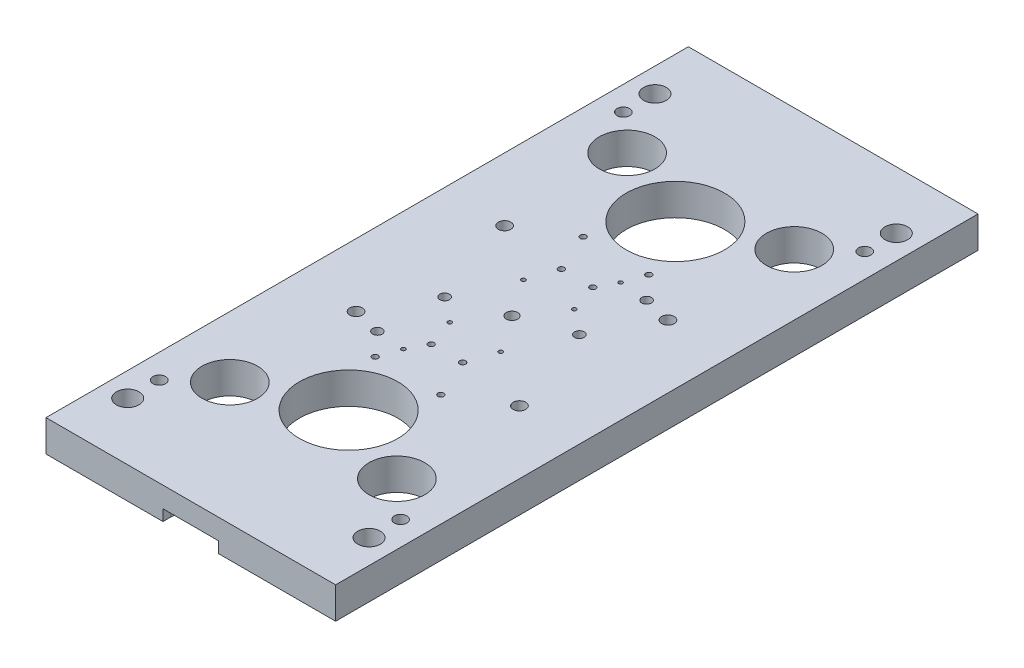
ISO-10303-21;
HEADER;
FILE_DESCRIPTION(('STEP AP214'),'2;1');
FILE_NAME('part.step','',(''),(''),'','','');
FILE_SCHEMA(('AUTOMOTIVE_DESIGN { 1 0 10303 214 1 1 1 1 }'));
ENDSEC;
DATA;
#1=APPLICATION_CONTEXT('core data for automotive mechanical design processes');
#2=APPLICATION_PROTOCOL_DEFINITION('international standard','automotive_design',2000,#1);
#3=PRODUCT_CONTEXT('',#1,'mechanical');
#4=PRODUCT('Part','Part','',(#3));
#5=PRODUCT_RELATED_PRODUCT_CATEGORY('part','',(#4));
#6=PRODUCT_DEFINITION_FORMATION('','',#4);
#7=PRODUCT_DEFINITION_CONTEXT('part definition',#1,'design');
#8=PRODUCT_DEFINITION('design','',#6,#7);
#9=PRODUCT_DEFINITION_SHAPE('','',#8);
#10=(LENGTH_UNIT() NAMED_UNIT(*) SI_UNIT(.MILLI.,.METRE.));
#11=(NAMED_UNIT(*) PLANE_ANGLE_UNIT() SI_UNIT($,.RADIAN.));
#12=(NAMED_UNIT(*) SI_UNIT($,.STERADIAN.) SOLID_ANGLE_UNIT());
#13=UNCERTAINTY_MEASURE_WITH_UNIT(LENGTH_MEASURE(1.E-05),#10,'distance_accuracy_value','');
#14=(GEOMETRIC_REPRESENTATION_CONTEXT(3) GLOBAL_UNCERTAINTY_ASSIGNED_CONTEXT((#13)) GLOBAL_UNIT_ASSIGNED_CONTEXT((#10,
#11,#12)) REPRESENTATION_CONTEXT('',''));
#15=CARTESIAN_POINT('',(0.,0.,0.));
#16=DIRECTION('',(0.,0.,1.));
#17=DIRECTION('',(1.,0.,0.));
#18=AXIS2_PLACEMENT_3D('',#15,#16,#17);
#19=CARTESIAN_POINT('',(0.,-97.5,-73.04107987));
#20=DIRECTION('',(0.,0.,-1.));
#21=DIRECTION('',(-1.,0.,0.));
#22=AXIS2_PLACEMENT_3D('',#19,#20,#21);
#23=CONICAL_SURFACE('',#22,0.,1.0471975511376);
#24=CARTESIAN_POINT('',(0.,-97.5,-73.04107987));
#25=VERTEX_POINT('',#24);
#26=VERTEX_LOOP('',#25);
#27=FACE_BOUND('',#26,.T.);
#28=CARTESIAN_POINT('',(0.,-97.5,-76.));
#29=DIRECTION('',(0.,0.,-1.));
#30=DIRECTION('',(-1.,0.,0.));
#31=AXIS2_PLACEMENT_3D('',#28,#29,#30);
#32=CIRCLE('',#31,5.125);
#33=CARTESIAN_POINT('',(-5.125,-97.5,-76.));
#34=VERTEX_POINT('',#33);
#35=EDGE_CURVE('E258',#34,#34,#32,.F.);
#36=ORIENTED_EDGE('',*,*,#35,.F.);
#37=EDGE_LOOP('',(#36));
#38=FACE_BOUND('',#37,.T.);
#39=ADVANCED_FACE('F16',(#27,#38),#23,.F.);
#40=CARTESIAN_POINT('',(-11.1725,-104.,112.33));
#41=DIRECTION('',(0.,1.,0.));
#42=DIRECTION('',(0.,0.,-1.));
#43=AXIS2_PLACEMENT_3D('',#40,#41,#42);
#44=PLANE('',#43);
#45=CARTESIAN_POINT('',(-13.7025,-104.,109.8));
#46=DIRECTION('',(0.,-1.,0.));
#47=DIRECTION('',(1.,0.,0.));
#48=AXIS2_PLACEMENT_3D('',#45,#46,#47);
#49=CIRCLE('',#48,1.39999999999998);
#50=CARTESIAN_POINT('',(-12.3025,-104.,109.8));
#51=VERTEX_POINT('',#50);
#52=EDGE_CURVE('E20',#51,#51,#49,.T.);
#53=ORIENTED_EDGE('',*,*,#52,.F.);
#54=EDGE_LOOP('',(#53));
#55=FACE_BOUND('',#54,.T.);
#56=CARTESIAN_POINT('',(-13.7025,-104.,109.8));
#57=DIRECTION('',(0.,1.,0.));
#58=DIRECTION('',(-1.,0.,0.));
#59=AXIS2_PLACEMENT_3D('',#56,#57,#58);
#60=CIRCLE('',#59,2.5);
#61=CARTESIAN_POINT('',(-16.2025,-104.,109.8));
#62=VERTEX_POINT('',#61);
#63=EDGE_CURVE('E556',#62,#62,#60,.T.);
#64=ORIENTED_EDGE('',*,*,#63,.F.);
#65=EDGE_LOOP('',(#64));
#66=FACE_BOUND('',#65,.T.);
#67=ADVANCED_FACE('F628',(#55,#66),#44,.F.);
#68=CARTESIAN_POINT('',(75.12,-99.,-87.12));
#69=DIRECTION('',(0.,1.,0.));
#70=DIRECTION('',(-1.,0.,0.));
#71=AXIS2_PLACEMENT_3D('',#68,#69,#70);
#72=PLANE('',#71);
#73=CARTESIAN_POINT('',(65.,-99.0000000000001,-77.));
#74=DIRECTION('',(0.,-1.,0.));
#75=DIRECTION('',(0.,0.,-1.));
#76=AXIS2_PLACEMENT_3D('',#73,#74,#75);
#77=CIRCLE('',#76,6.80000000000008);
#78=CARTESIAN_POINT('',(65.,-99.0000000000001,-83.8000000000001));
#79=VERTEX_POINT('',#78);
#80=EDGE_CURVE('E125',#79,#79,#77,.T.);
#81=ORIENTED_EDGE('',*,*,#80,.F.);
#82=EDGE_LOOP('',(#81));
#83=FACE_BOUND('',#82,.T.);
#84=CARTESIAN_POINT('',(65.,-99.,-77.));
#85=DIRECTION('',(0.,-1.,0.));
#86=DIRECTION('',(0.,0.,-1.));
#87=AXIS2_PLACEMENT_3D('',#84,#85,#86);
#88=CIRCLE('',#87,9.99999999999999);
#89=CARTESIAN_POINT('',(65.,-99.,-87.));
#90=VERTEX_POINT('',#89);
#91=EDGE_CURVE('E553',#90,#90,#88,.F.);
#92=ORIENTED_EDGE('',*,*,#91,.F.);
#93=EDGE_LOOP('',(#92));
#94=FACE_BOUND('',#93,.T.);
#95=ADVANCED_FACE('F631',(#83,#94),#72,.F.);
#96=CARTESIAN_POINT('',(75.12,-99.,196.88));
#97=DIRECTION('',(0.,1.,0.));
#98=DIRECTION('',(-1.,0.,0.));
#99=AXIS2_PLACEMENT_3D('',#96,#97,#98);
#100=PLANE('',#99);
#101=CARTESIAN_POINT('',(65.,-99.0000000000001,207.));
#102=DIRECTION('',(0.,-1.,0.));
#103=DIRECTION('',(0.,0.,-1.));
#104=AXIS2_PLACEMENT_3D('',#101,#102,#103);
#105=CIRCLE('',#104,6.80000000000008);
#106=CARTESIAN_POINT('',(65.,-99.0000000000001,200.2));
#107=VERTEX_POINT('',#106);
#108=EDGE_CURVE('E616',#107,#107,#105,.T.);
#109=ORIENTED_EDGE('',*,*,#108,.F.);
#110=EDGE_LOOP('',(#109));
#111=FACE_BOUND('',#110,.T.);
#112=CARTESIAN_POINT('',(65.,-99.,207.));
#113=DIRECTION('',(0.,-1.,0.));
#114=DIRECTION('',(0.,0.,-1.));
#115=AXIS2_PLACEMENT_3D('',#112,#113,#114);
#116=CIRCLE('',#115,9.99999999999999);
#117=CARTESIAN_POINT('',(65.,-99.,197.));
#118=VERTEX_POINT('',#117);
#119=EDGE_CURVE('E550',#118,#118,#116,.F.);
#120=ORIENTED_EDGE('',*,*,#119,.F.);
#121=EDGE_LOOP('',(#120));
#122=FACE_BOUND('',#121,.T.);
#123=ADVANCED_FACE('F1089',(#111,#122),#100,.F.);
#124=CARTESIAN_POINT('',(-21.242,-103.,12.542));
#125=DIRECTION('',(0.,1.,0.));
#126=DIRECTION('',(1.,0.,0.));
#127=AXIS2_PLACEMENT_3D('',#124,#125,#126);
#128=PLANE('',#127);
#129=CARTESIAN_POINT('',(-17.7,-103.,9.));
#130=DIRECTION('',(0.,-1.,0.));
#131=DIRECTION('',(0.,0.,-1.));
#132=AXIS2_PLACEMENT_3D('',#129,#130,#131);
#133=CIRCLE('',#132,1.99999999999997);
#134=CARTESIAN_POINT('',(-17.7,-103.,7.00000000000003));
#135=VERTEX_POINT('',#134);
#136=EDGE_CURVE('E613',#135,#135,#133,.T.);
#137=ORIENTED_EDGE('',*,*,#136,.F.);
#138=EDGE_LOOP('',(#137));
#139=FACE_BOUND('',#138,.T.);
#140=CARTESIAN_POINT('',(-17.7,-103.,9.));
#141=DIRECTION('',(0.,-1.,0.));
#142=DIRECTION('',(0.,0.,-1.));
#143=AXIS2_PLACEMENT_3D('',#140,#141,#142);
#144=CIRCLE('',#143,3.5);
#145=CARTESIAN_POINT('',(-17.7,-103.,5.5));
#146=VERTEX_POINT('',#145);
#147=EDGE_CURVE('E547',#146,#146,#144,.F.);
#148=ORIENTED_EDGE('',*,*,#147,.F.);
#149=EDGE_LOOP('',(#148));
#150=FACE_BOUND('',#149,.T.);
#151=ADVANCED_FACE('F1093',(#139,#150),#128,.F.);
#152=CARTESIAN_POINT('',(21.242,-103.,5.458));
#153=DIRECTION('',(0.,1.,0.));
#154=DIRECTION('',(-1.,0.,0.));
#155=AXIS2_PLACEMENT_3D('',#152,#153,#154);
#156=PLANE('',#155);
#157=CARTESIAN_POINT('',(17.7,-103.,9.));
#158=DIRECTION('',(0.,-1.,0.));
#159=DIRECTION('',(0.,0.,-1.));
#160=AXIS2_PLACEMENT_3D('',#157,#158,#159);
#161=CIRCLE('',#160,1.99999999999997);
#162=CARTESIAN_POINT('',(17.7,-103.,7.00000000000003));
#163=VERTEX_POINT('',#162);
#164=EDGE_CURVE('E604',#163,#163,#161,.T.);
#165=ORIENTED_EDGE('',*,*,#164,.F.);
#166=EDGE_LOOP('',(#165));
#167=FACE_BOUND('',#166,.T.);
#168=CARTESIAN_POINT('',(17.7,-103.,9.));
#169=DIRECTION('',(0.,-1.,0.));
#170=DIRECTION('',(0.,0.,-1.));
#171=AXIS2_PLACEMENT_3D('',#168,#169,#170);
#172=CIRCLE('',#171,3.5);
#173=CARTESIAN_POINT('',(17.7,-103.,5.5));
#174=VERTEX_POINT('',#173);
#175=EDGE_CURVE('E544',#174,#174,#172,.F.);
#176=ORIENTED_EDGE('',*,*,#175,.F.);
#177=EDGE_LOOP('',(#176));
#178=FACE_BOUND('',#177,.T.);
#179=ADVANCED_FACE('F1097',(#167,#178),#156,.F.);
#180=CARTESIAN_POINT('',(12.042,-103.,26.4005));
#181=DIRECTION('',(0.,1.,0.));
#182=DIRECTION('',(-1.,0.,0.));
#183=AXIS2_PLACEMENT_3D('',#180,#181,#182);
#184=PLANE('',#183);
#185=CARTESIAN_POINT('',(8.5,-103.,29.9425));
#186=DIRECTION('',(0.,-1.,0.));
#187=DIRECTION('',(0.,0.,-1.));
#188=AXIS2_PLACEMENT_3D('',#185,#186,#187);
#189=CIRCLE('',#188,1.99999999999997);
#190=CARTESIAN_POINT('',(8.5,-103.,27.9425));
#191=VERTEX_POINT('',#190);
#192=EDGE_CURVE('E595',#191,#191,#189,.T.);
#193=ORIENTED_EDGE('',*,*,#192,.F.);
#194=EDGE_LOOP('',(#193));
#195=FACE_BOUND('',#194,.T.);
#196=CARTESIAN_POINT('',(8.5,-103.,29.9425));
#197=DIRECTION('',(0.,-1.,0.));
#198=DIRECTION('',(0.,0.,-1.));
#199=AXIS2_PLACEMENT_3D('',#196,#197,#198);
#200=CIRCLE('',#199,3.5);
#201=CARTESIAN_POINT('',(8.5,-103.,26.4425));
#202=VERTEX_POINT('',#201);
#203=EDGE_CURVE('E541',#202,#202,#200,.F.);
#204=ORIENTED_EDGE('',*,*,#203,.F.);
#205=EDGE_LOOP('',(#204));
#206=FACE_BOUND('',#205,.T.);
#207=ADVANCED_FACE('F1101',(#195,#206),#184,.F.);
#208=CARTESIAN_POINT('',(-6.578,-101.,71.578));
#209=DIRECTION('',(0.,1.,0.));
#210=DIRECTION('',(1.,0.,0.));
#211=AXIS2_PLACEMENT_3D('',#208,#209,#210);
#212=PLANE('',#211);
#213=CARTESIAN_POINT('',(0.,-101.,65.));
#214=DIRECTION('',(0.,-1.,0.));
#215=DIRECTION('',(0.,0.,-1.));
#216=AXIS2_PLACEMENT_3D('',#213,#214,#215);
#217=CIRCLE('',#216,3.49999999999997);
#218=CARTESIAN_POINT('',(0.,-101.,61.5));
#219=VERTEX_POINT('',#218);
#220=EDGE_CURVE('E589',#219,#219,#217,.T.);
#221=ORIENTED_EDGE('',*,*,#220,.F.);
#222=EDGE_LOOP('',(#221));
#223=FACE_BOUND('',#222,.T.);
#224=CARTESIAN_POINT('',(0.,-101.,65.));
#225=DIRECTION('',(0.,-1.,0.));
#226=DIRECTION('',(0.,0.,-1.));
#227=AXIS2_PLACEMENT_3D('',#224,#225,#226);
#228=CIRCLE('',#227,6.5);
#229=CARTESIAN_POINT('',(0.,-101.,58.5));
#230=VERTEX_POINT('',#229);
#231=EDGE_CURVE('E538',#230,#230,#228,.F.);
#232=ORIENTED_EDGE('',*,*,#231,.F.);
#233=EDGE_LOOP('',(#232));
#234=FACE_BOUND('',#233,.T.);
#235=ADVANCED_FACE('F1105',(#223,#234),#212,.F.);
#236=CARTESIAN_POINT('',(-16.2325,-104.,82.3025));
#237=DIRECTION('',(0.,1.,0.));
#238=DIRECTION('',(0.,0.,1.));
#239=AXIS2_PLACEMENT_3D('',#236,#237,#238);
#240=PLANE('',#239);
#241=CARTESIAN_POINT('',(-13.7025,-104.,84.8325));
#242=DIRECTION('',(0.,-1.,0.));
#243=DIRECTION('',(1.,0.,0.));
#244=AXIS2_PLACEMENT_3D('',#241,#242,#243);
#245=CIRCLE('',#244,1.39999999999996);
#246=CARTESIAN_POINT('',(-12.3025,-104.,84.8325));
#247=VERTEX_POINT('',#246);
#248=EDGE_CURVE('E574',#247,#247,#245,.T.);
#249=ORIENTED_EDGE('',*,*,#248,.F.);
#250=EDGE_LOOP('',(#249));
#251=FACE_BOUND('',#250,.T.);
#252=CARTESIAN_POINT('',(-13.7025,-104.,84.8325));
#253=DIRECTION('',(0.,1.,0.));
#254=DIRECTION('',(-1.,0.,0.));
#255=AXIS2_PLACEMENT_3D('',#252,#253,#254);
#256=CIRCLE('',#255,2.5);
#257=CARTESIAN_POINT('',(-16.2025,-104.,84.8325));
#258=VERTEX_POINT('',#257);
#259=EDGE_CURVE('E535',#258,#258,#256,.T.);
#260=ORIENTED_EDGE('',*,*,#259,.F.);
#261=EDGE_LOOP('',(#260));
#262=FACE_BOUND('',#261,.T.);
#263=ADVANCED_FACE('F1109',(#251,#262),#240,.F.);
#264=CARTESIAN_POINT('',(-21.242,-103.,124.542));
#265=DIRECTION('',(0.,1.,0.));
#266=DIRECTION('',(1.,0.,0.));
#267=AXIS2_PLACEMENT_3D('',#264,#265,#266);
#268=PLANE('',#267);
#269=CARTESIAN_POINT('',(-17.7,-103.,121.));
#270=DIRECTION('',(0.,-1.,0.));
#271=DIRECTION('',(0.,0.,-1.));
#272=AXIS2_PLACEMENT_3D('',#269,#270,#271);
#273=CIRCLE('',#272,1.99999999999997);
#274=CARTESIAN_POINT('',(-17.7,-103.,119.));
#275=VERTEX_POINT('',#274);
#276=EDGE_CURVE('E568',#275,#275,#273,.T.);
#277=ORIENTED_EDGE('',*,*,#276,.F.);
#278=EDGE_LOOP('',(#277));
#279=FACE_BOUND('',#278,.T.);
#280=CARTESIAN_POINT('',(-17.7,-103.,121.));
#281=DIRECTION('',(0.,-1.,0.));
#282=DIRECTION('',(0.,0.,-1.));
#283=AXIS2_PLACEMENT_3D('',#280,#281,#282);
#284=CIRCLE('',#283,3.5);
#285=CARTESIAN_POINT('',(-17.7,-103.,117.5));
#286=VERTEX_POINT('',#285);
#287=EDGE_CURVE('E532',#286,#286,#284,.F.);
#288=ORIENTED_EDGE('',*,*,#287,.F.);
#289=EDGE_LOOP('',(#288));
#290=FACE_BOUND('',#289,.T.);
#291=ADVANCED_FACE('F1113',(#279,#290),#268,.F.);
#292=CARTESIAN_POINT('',(-35.072,-103.,102.428));
#293=DIRECTION('',(0.,1.,0.));
#294=DIRECTION('',(0.,0.,1.));
#295=AXIS2_PLACEMENT_3D('',#292,#293,#294);
#296=PLANE('',#295);
#297=CARTESIAN_POINT('',(-29.,-103.,108.5));
#298=DIRECTION('',(0.,-1.,0.));
#299=DIRECTION('',(1.,0.,0.));
#300=AXIS2_PLACEMENT_3D('',#297,#298,#299);
#301=CIRCLE('',#300,2.89999999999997);
#302=CARTESIAN_POINT('',(-26.1,-103.,108.5));
#303=VERTEX_POINT('',#302);
#304=EDGE_CURVE('E565',#303,#303,#301,.T.);
#305=ORIENTED_EDGE('',*,*,#304,.F.);
#306=EDGE_LOOP('',(#305));
#307=FACE_BOUND('',#306,.T.);
#308=CARTESIAN_POINT('',(-29.,-103.,108.5));
#309=DIRECTION('',(0.,1.,0.));
#310=DIRECTION('',(-1.,0.,0.));
#311=AXIS2_PLACEMENT_3D('',#308,#309,#310);
#312=CIRCLE('',#311,6.00000000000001);
#313=CARTESIAN_POINT('',(-35.,-103.,108.5));
#314=VERTEX_POINT('',#313);
#315=EDGE_CURVE('E529',#314,#314,#312,.T.);
#316=ORIENTED_EDGE('',*,*,#315,.F.);
#317=EDGE_LOOP('',(#316));
#318=FACE_BOUND('',#317,.T.);
#319=ADVANCED_FACE('F1117',(#307,#318),#296,.F.);
#320=CARTESIAN_POINT('',(-12.042,-103.,103.5995));
#321=DIRECTION('',(0.,1.,0.));
#322=DIRECTION('',(1.,0.,0.));
#323=AXIS2_PLACEMENT_3D('',#320,#321,#322);
#324=PLANE('',#323);
#325=CARTESIAN_POINT('',(-8.5,-103.,100.0575));
#326=DIRECTION('',(0.,-1.,0.));
#327=DIRECTION('',(0.,0.,-1.));
#328=AXIS2_PLACEMENT_3D('',#325,#326,#327);
#329=CIRCLE('',#328,1.99999999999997);
#330=CARTESIAN_POINT('',(-8.5,-103.,98.0575));
#331=VERTEX_POINT('',#330);
#332=EDGE_CURVE('E571',#331,#331,#329,.T.);
#333=ORIENTED_EDGE('',*,*,#332,.F.);
#334=EDGE_LOOP('',(#333));
#335=FACE_BOUND('',#334,.T.);
#336=CARTESIAN_POINT('',(-8.5,-103.,100.0575));
#337=DIRECTION('',(0.,-1.,0.));
#338=DIRECTION('',(0.,0.,-1.));
#339=AXIS2_PLACEMENT_3D('',#336,#337,#338);
#340=CIRCLE('',#339,3.5);
#341=CARTESIAN_POINT('',(-8.5,-103.,96.5575));
#342=VERTEX_POINT('',#341);
#343=EDGE_CURVE('E526',#342,#342,#340,.F.);
#344=ORIENTED_EDGE('',*,*,#343,.F.);
#345=EDGE_LOOP('',(#344));
#346=FACE_BOUND('',#345,.T.);
#347=ADVANCED_FACE('F1121',(#335,#346),#324,.F.);
#348=CARTESIAN_POINT('',(11.1725,-104.,82.3025));
#349=DIRECTION('',(0.,1.,0.));
#350=DIRECTION('',(0.,0.,1.));
#351=AXIS2_PLACEMENT_3D('',#348,#349,#350);
#352=PLANE('',#351);
#353=CARTESIAN_POINT('',(13.7025,-104.,84.8325));
#354=DIRECTION('',(0.,-1.,0.));
#355=DIRECTION('',(1.,0.,0.));
#356=AXIS2_PLACEMENT_3D('',#353,#354,#355);
#357=CIRCLE('',#356,1.39999999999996);
#358=CARTESIAN_POINT('',(15.1025,-104.,84.8325));
#359=VERTEX_POINT('',#358);
#360=EDGE_CURVE('E577',#359,#359,#357,.T.);
#361=ORIENTED_EDGE('',*,*,#360,.F.);
#362=EDGE_LOOP('',(#361));
#363=FACE_BOUND('',#362,.T.);
#364=CARTESIAN_POINT('',(13.7025,-104.,84.8325));
#365=DIRECTION('',(0.,1.,0.));
#366=DIRECTION('',(-1.,0.,0.));
#367=AXIS2_PLACEMENT_3D('',#364,#365,#366);
#368=CIRCLE('',#367,2.5);
#369=CARTESIAN_POINT('',(11.2025,-104.,84.8325));
#370=VERTEX_POINT('',#369);
#371=EDGE_CURVE('E523',#370,#370,#368,.T.);
#372=ORIENTED_EDGE('',*,*,#371,.F.);
#373=EDGE_LOOP('',(#372));
#374=FACE_BOUND('',#373,.T.);
#375=ADVANCED_FACE('F1125',(#363,#374),#352,.F.);
#376=CARTESIAN_POINT('',(21.242,-103.,117.458));
#377=DIRECTION('',(0.,1.,0.));
#378=DIRECTION('',(-1.,0.,0.));
#379=AXIS2_PLACEMENT_3D('',#376,#377,#378);
#380=PLANE('',#379);
#381=CARTESIAN_POINT('',(17.7,-103.,121.));
#382=DIRECTION('',(0.,-1.,0.));
#383=DIRECTION('',(0.,0.,-1.));
#384=AXIS2_PLACEMENT_3D('',#381,#382,#383);
#385=CIRCLE('',#384,1.99999999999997);
#386=CARTESIAN_POINT('',(17.7,-103.,119.));
#387=VERTEX_POINT('',#386);
#388=EDGE_CURVE('E580',#387,#387,#385,.T.);
#389=ORIENTED_EDGE('',*,*,#388,.F.);
#390=EDGE_LOOP('',(#389));
#391=FACE_BOUND('',#390,.T.);
#392=CARTESIAN_POINT('',(17.7,-103.,121.));
#393=DIRECTION('',(0.,-1.,0.));
#394=DIRECTION('',(0.,0.,-1.));
#395=AXIS2_PLACEMENT_3D('',#392,#393,#394);
#396=CIRCLE('',#395,3.5);
#397=CARTESIAN_POINT('',(17.7,-103.,117.5));
#398=VERTEX_POINT('',#397);
#399=EDGE_CURVE('E520',#398,#398,#396,.F.);
#400=ORIENTED_EDGE('',*,*,#399,.F.);
#401=EDGE_LOOP('',(#400));
#402=FACE_BOUND('',#401,.T.);
#403=ADVANCED_FACE('F1129',(#391,#402),#380,.F.);
#404=CARTESIAN_POINT('',(12.042,-103.,96.5155));
#405=DIRECTION('',(0.,1.,0.));
#406=DIRECTION('',(-1.,0.,0.));
#407=AXIS2_PLACEMENT_3D('',#404,#405,#406);
#408=PLANE('',#407);
#409=CARTESIAN_POINT('',(8.5,-103.,100.0575));
#410=DIRECTION('',(0.,-1.,0.));
#411=DIRECTION('',(0.,0.,-1.));
#412=AXIS2_PLACEMENT_3D('',#409,#410,#411);
#413=CIRCLE('',#412,1.99999999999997);
#414=CARTESIAN_POINT('',(8.5,-103.,98.0575));
#415=VERTEX_POINT('',#414);
#416=EDGE_CURVE('E583',#415,#415,#413,.T.);
#417=ORIENTED_EDGE('',*,*,#416,.F.);
#418=EDGE_LOOP('',(#417));
#419=FACE_BOUND('',#418,.T.);
#420=CARTESIAN_POINT('',(8.5,-103.,100.0575));
#421=DIRECTION('',(0.,-1.,0.));
#422=DIRECTION('',(0.,0.,-1.));
#423=AXIS2_PLACEMENT_3D('',#420,#421,#422);
#424=CIRCLE('',#423,3.5);
#425=CARTESIAN_POINT('',(8.5,-103.,96.5575));
#426=VERTEX_POINT('',#425);
#427=EDGE_CURVE('E517',#426,#426,#424,.F.);
#428=ORIENTED_EDGE('',*,*,#427,.F.);
#429=EDGE_LOOP('',(#428));
#430=FACE_BOUND('',#429,.T.);
#431=ADVANCED_FACE('F1133',(#419,#430),#408,.F.);
#432=CARTESIAN_POINT('',(20.861533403,-103.,49.57181783));
#433=DIRECTION('',(0.,1.,0.));
#434=DIRECTION('',(0.,0.,1.));
#435=AXIS2_PLACEMENT_3D('',#432,#433,#434);
#436=PLANE('',#435);
#437=CARTESIAN_POINT('',(26.933533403,-103.,55.64381783));
#438=DIRECTION('',(0.,-1.,0.));
#439=DIRECTION('',(1.,0.,0.));
#440=AXIS2_PLACEMENT_3D('',#437,#438,#439);
#441=CIRCLE('',#440,2.89999999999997);
#442=CARTESIAN_POINT('',(29.833533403,-103.,55.64381783));
#443=VERTEX_POINT('',#442);
#444=EDGE_CURVE('E586',#443,#443,#441,.T.);
#445=ORIENTED_EDGE('',*,*,#444,.F.);
#446=EDGE_LOOP('',(#445));
#447=FACE_BOUND('',#446,.T.);
#448=CARTESIAN_POINT('',(26.933533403,-103.,55.64381783));
#449=DIRECTION('',(0.,1.,0.));
#450=DIRECTION('',(-1.,0.,0.));
#451=AXIS2_PLACEMENT_3D('',#448,#449,#450);
#452=CIRCLE('',#451,6.);
#453=CARTESIAN_POINT('',(20.933533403,-103.,55.64381783));
#454=VERTEX_POINT('',#453);
#455=EDGE_CURVE('E514',#454,#454,#452,.T.);
#456=ORIENTED_EDGE('',*,*,#455,.F.);
#457=EDGE_LOOP('',(#456));
#458=FACE_BOUND('',#457,.T.);
#459=ADVANCED_FACE('F1137',(#447,#458),#436,.F.);
#460=CARTESIAN_POINT('',(16.2325,-104.,47.6975));
#461=DIRECTION('',(0.,1.,0.));
#462=DIRECTION('',(0.,0.,-1.));
#463=AXIS2_PLACEMENT_3D('',#460,#461,#462);
#464=PLANE('',#463);
#465=CARTESIAN_POINT('',(13.7025,-104.,45.1675));
#466=DIRECTION('',(0.,-1.,0.));
#467=DIRECTION('',(1.,0.,0.));
#468=AXIS2_PLACEMENT_3D('',#465,#466,#467);
#469=CIRCLE('',#468,1.39999999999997);
#470=CARTESIAN_POINT('',(15.1025,-104.,45.1675));
#471=VERTEX_POINT('',#470);
#472=EDGE_CURVE('E592',#471,#471,#469,.T.);
#473=ORIENTED_EDGE('',*,*,#472,.F.);
#474=EDGE_LOOP('',(#473));
#475=FACE_BOUND('',#474,.T.);
#476=CARTESIAN_POINT('',(13.7025,-104.,45.1675));
#477=DIRECTION('',(0.,1.,0.));
#478=DIRECTION('',(-1.,0.,0.));
#479=AXIS2_PLACEMENT_3D('',#476,#477,#478);
#480=CIRCLE('',#479,2.5);
#481=CARTESIAN_POINT('',(11.2025,-104.,45.1675));
#482=VERTEX_POINT('',#481);
#483=EDGE_CURVE('E511',#482,#482,#480,.T.);
#484=ORIENTED_EDGE('',*,*,#483,.F.);
#485=EDGE_LOOP('',(#484));
#486=FACE_BOUND('',#485,.T.);
#487=ADVANCED_FACE('F1141',(#475,#486),#464,.F.);
#488=CARTESIAN_POINT('',(-12.042,-103.,33.4845));
#489=DIRECTION('',(0.,1.,0.));
#490=DIRECTION('',(1.,0.,0.));
#491=AXIS2_PLACEMENT_3D('',#488,#489,#490);
#492=PLANE('',#491);
#493=CARTESIAN_POINT('',(-8.5,-103.,29.9425));
#494=DIRECTION('',(0.,-1.,0.));
#495=DIRECTION('',(0.,0.,-1.));
#496=AXIS2_PLACEMENT_3D('',#493,#494,#495);
#497=CIRCLE('',#496,1.99999999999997);
#498=CARTESIAN_POINT('',(-8.5,-103.,27.9425));
#499=VERTEX_POINT('',#498);
#500=EDGE_CURVE('E598',#499,#499,#497,.T.);
#501=ORIENTED_EDGE('',*,*,#500,.F.);
#502=EDGE_LOOP('',(#501));
#503=FACE_BOUND('',#502,.T.);
#504=CARTESIAN_POINT('',(-8.5,-103.,29.9425));
#505=DIRECTION('',(0.,-1.,0.));
#506=DIRECTION('',(0.,0.,-1.));
#507=AXIS2_PLACEMENT_3D('',#504,#505,#506);
#508=CIRCLE('',#507,3.5);
#509=CARTESIAN_POINT('',(-8.5,-103.,26.4425));
#510=VERTEX_POINT('',#509);
#511=EDGE_CURVE('E508',#510,#510,#508,.F.);
#512=ORIENTED_EDGE('',*,*,#511,.F.);
#513=EDGE_LOOP('',(#512));
#514=FACE_BOUND('',#513,.T.);
#515=ADVANCED_FACE('F1145',(#503,#514),#492,.F.);
#516=CARTESIAN_POINT('',(22.928,-103.,15.428));
#517=DIRECTION('',(0.,1.,0.));
#518=DIRECTION('',(0.,0.,1.));
#519=AXIS2_PLACEMENT_3D('',#516,#517,#518);
#520=PLANE('',#519);
#521=CARTESIAN_POINT('',(29.,-103.,21.5));
#522=DIRECTION('',(0.,-1.,0.));
#523=DIRECTION('',(1.,0.,0.));
#524=AXIS2_PLACEMENT_3D('',#521,#522,#523);
#525=CIRCLE('',#524,2.89999999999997);
#526=CARTESIAN_POINT('',(31.9,-103.,21.5));
#527=VERTEX_POINT('',#526);
#528=EDGE_CURVE('E601',#527,#527,#525,.T.);
#529=ORIENTED_EDGE('',*,*,#528,.F.);
#530=EDGE_LOOP('',(#529));
#531=FACE_BOUND('',#530,.T.);
#532=CARTESIAN_POINT('',(29.,-103.,21.5));
#533=DIRECTION('',(0.,1.,0.));
#534=DIRECTION('',(-1.,0.,0.));
#535=AXIS2_PLACEMENT_3D('',#532,#533,#534);
#536=CIRCLE('',#535,6.);
#537=CARTESIAN_POINT('',(23.,-103.,21.5));
#538=VERTEX_POINT('',#537);
#539=EDGE_CURVE('E505',#538,#538,#536,.T.);
#540=ORIENTED_EDGE('',*,*,#539,.F.);
#541=EDGE_LOOP('',(#540));
#542=FACE_BOUND('',#541,.T.);
#543=ADVANCED_FACE('F1149',(#531,#542),#520,.F.);
#544=CARTESIAN_POINT('',(-11.1725,-104.,47.6975));
#545=DIRECTION('',(0.,1.,0.));
#546=DIRECTION('',(0.,0.,-1.));
#547=AXIS2_PLACEMENT_3D('',#544,#545,#546);
#548=PLANE('',#547);
#549=CARTESIAN_POINT('',(-13.7025,-104.,45.1675));
#550=DIRECTION('',(0.,-1.,0.));
#551=DIRECTION('',(1.,0.,0.));
#552=AXIS2_PLACEMENT_3D('',#549,#550,#551);
#553=CIRCLE('',#552,1.39999999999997);
#554=CARTESIAN_POINT('',(-12.3025,-104.,45.1675));
#555=VERTEX_POINT('',#554);
#556=EDGE_CURVE('E607',#555,#555,#553,.T.);
#557=ORIENTED_EDGE('',*,*,#556,.F.);
#558=EDGE_LOOP('',(#557));
#559=FACE_BOUND('',#558,.T.);
#560=CARTESIAN_POINT('',(-13.7025,-104.,45.1675));
#561=DIRECTION('',(0.,1.,0.));
#562=DIRECTION('',(-1.,0.,0.));
#563=AXIS2_PLACEMENT_3D('',#560,#561,#562);
#564=CIRCLE('',#563,2.5);
#565=CARTESIAN_POINT('',(-16.2025,-104.,45.1675));
#566=VERTEX_POINT('',#565);
#567=EDGE_CURVE('E502',#566,#566,#564,.T.);
#568=ORIENTED_EDGE('',*,*,#567,.F.);
#569=EDGE_LOOP('',(#568));
#570=FACE_BOUND('',#569,.T.);
#571=ADVANCED_FACE('F1153',(#559,#570),#548,.F.);
#572=CARTESIAN_POINT('',(-33.005533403,-103.,68.28418217));
#573=DIRECTION('',(0.,1.,0.));
#574=DIRECTION('',(0.,0.,1.));
#575=AXIS2_PLACEMENT_3D('',#572,#573,#574);
#576=PLANE('',#575);
#577=CARTESIAN_POINT('',(-26.933533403,-103.,74.35618217));
#578=DIRECTION('',(0.,-1.,0.));
#579=DIRECTION('',(1.,0.,0.));
#580=AXIS2_PLACEMENT_3D('',#577,#578,#579);
#581=CIRCLE('',#580,2.89999999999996);
#582=CARTESIAN_POINT('',(-24.033533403,-103.,74.35618217));
#583=VERTEX_POINT('',#582);
#584=EDGE_CURVE('E610',#583,#583,#581,.T.);
#585=ORIENTED_EDGE('',*,*,#584,.F.);
#586=EDGE_LOOP('',(#585));
#587=FACE_BOUND('',#586,.T.);
#588=CARTESIAN_POINT('',(-26.933533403,-103.,74.35618217));
#589=DIRECTION('',(0.,1.,0.));
#590=DIRECTION('',(-1.,0.,0.));
#591=AXIS2_PLACEMENT_3D('',#588,#589,#590);
#592=CIRCLE('',#591,6.00000000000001);
#593=CARTESIAN_POINT('',(-32.933533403,-103.,74.35618217));
#594=VERTEX_POINT('',#593);
#595=EDGE_CURVE('E499',#594,#594,#592,.T.);
#596=ORIENTED_EDGE('',*,*,#595,.F.);
#597=EDGE_LOOP('',(#596));
#598=FACE_BOUND('',#597,.T.);
#599=ADVANCED_FACE('F1157',(#587,#598),#576,.F.);
#600=CARTESIAN_POINT('',(-75.12,-99.,217.12));
#601=DIRECTION('',(0.,1.,0.));
#602=DIRECTION('',(1.,0.,0.));
#603=AXIS2_PLACEMENT_3D('',#600,#601,#602);
#604=PLANE('',#603);
#605=CARTESIAN_POINT('',(-65.,-99.0000000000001,207.));
#606=DIRECTION('',(0.,-1.,0.));
#607=DIRECTION('',(0.,0.,-1.));
#608=AXIS2_PLACEMENT_3D('',#605,#606,#607);
#609=CIRCLE('',#608,6.80000000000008);
#610=CARTESIAN_POINT('',(-65.,-99.0000000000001,200.2));
#611=VERTEX_POINT('',#610);
#612=EDGE_CURVE('E618',#611,#611,#609,.T.);
#613=ORIENTED_EDGE('',*,*,#612,.F.);
#614=EDGE_LOOP('',(#613));
#615=FACE_BOUND('',#614,.T.);
#616=CARTESIAN_POINT('',(-65.,-99.,207.));
#617=DIRECTION('',(0.,-1.,0.));
#618=DIRECTION('',(0.,0.,-1.));
#619=AXIS2_PLACEMENT_3D('',#616,#617,#618);
#620=CIRCLE('',#619,9.99999999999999);
#621=CARTESIAN_POINT('',(-65.,-99.,197.));
#622=VERTEX_POINT('',#621);
#623=EDGE_CURVE('E496',#622,#622,#620,.F.);
#624=ORIENTED_EDGE('',*,*,#623,.F.);
#625=EDGE_LOOP('',(#624));
#626=FACE_BOUND('',#625,.T.);
#627=ADVANCED_FACE('F1161',(#615,#626),#604,.F.);
#628=CARTESIAN_POINT('',(-75.12,-99.,-66.88));
#629=DIRECTION('',(0.,1.,0.));
#630=DIRECTION('',(1.,0.,0.));
#631=AXIS2_PLACEMENT_3D('',#628,#629,#630);
#632=PLANE('',#631);
#633=CARTESIAN_POINT('',(-65.,-99.0000000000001,-77.));
#634=DIRECTION('',(0.,-1.,0.));
#635=DIRECTION('',(0.,0.,-1.));
#636=AXIS2_PLACEMENT_3D('',#633,#634,#635);
#637=CIRCLE('',#636,6.80000000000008);
#638=CARTESIAN_POINT('',(-65.,-99.0000000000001,-83.8000000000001));
#639=VERTEX_POINT('',#638);
#640=EDGE_CURVE('E562',#639,#639,#637,.T.);
#641=ORIENTED_EDGE('',*,*,#640,.F.);
#642=EDGE_LOOP('',(#641));
#643=FACE_BOUND('',#642,.T.);
#644=CARTESIAN_POINT('',(-65.,-99.,-77.));
#645=DIRECTION('',(0.,-1.,0.));
#646=DIRECTION('',(0.,0.,-1.));
#647=AXIS2_PLACEMENT_3D('',#644,#645,#646);
#648=CIRCLE('',#647,9.99999999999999);
#649=CARTESIAN_POINT('',(-65.,-99.,-87.));
#650=VERTEX_POINT('',#649);
#651=EDGE_CURVE('E492',#650,#650,#648,.F.);
#652=ORIENTED_EDGE('',*,*,#651,.F.);
#653=EDGE_LOOP('',(#652));
#654=FACE_BOUND('',#653,.T.);
#655=ADVANCED_FACE('F1165',(#643,#654),#632,.F.);
#656=CARTESIAN_POINT('',(-10.,-100.,-88.886));
#657=DIRECTION('',(0.,-1.,0.));
#658=DIRECTION('',(-1.,0.,0.));
#659=AXIS2_PLACEMENT_3D('',#656,#657,#658);
#660=PLANE('',#659);
#661=DIRECTION('',(0.,0.,-1.));
#662=VECTOR('',#661,1.);
#663=CARTESIAN_POINT('',(-40.,-100.,-106.));
#664=LINE('',#663,#662);
#665=CARTESIAN_POINT('',(-40.,-100.,-104.000000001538));
#666=VERTEX_POINT('',#665);
#667=CARTESIAN_POINT('',(-39.999999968,-100.000000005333,-108.));
#668=VERTEX_POINT('',#667);
#669=EDGE_CURVE('E253',#666,#668,#664,.T.);
#670=ORIENTED_EDGE('',*,*,#669,.T.);
#671=DIRECTION('',(-1.,0.,0.));
#672=VECTOR('',#671,1.);
#673=CARTESIAN_POINT('',(0.,-100.000000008,-108.));
#674=LINE('',#673,#672);
#675=CARTESIAN_POINT('',(-9.999999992,-100.000000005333,-108.));
#676=VERTEX_POINT('',#675);
#677=EDGE_CURVE('E246',#676,#668,#674,.T.);
#678=ORIENTED_EDGE('',*,*,#677,.F.);
#679=DIRECTION('',(0.,0.,1.));
#680=VECTOR('',#679,1.);
#681=CARTESIAN_POINT('',(-10.,-100.,-106.));
#682=LINE('',#681,#680);
#683=CARTESIAN_POINT('',(-10.,-100.,-104.));
#684=VERTEX_POINT('',#683);
#685=EDGE_CURVE('E239',#676,#684,#682,.T.);
#686=ORIENTED_EDGE('',*,*,#685,.T.);
#687=CARTESIAN_POINT('',(-25.,-100.,-104.));
#688=DIRECTION('',(0.,-1.,0.));
#689=DIRECTION('',(0.,0.,-1.));
#690=AXIS2_PLACEMENT_3D('',#687,#688,#689);
#691=CIRCLE('',#690,15.);
#692=EDGE_CURVE('E243',#666,#684,#691,.F.);
#693=ORIENTED_EDGE('',*,*,#692,.F.);
#694=EDGE_LOOP('',(#670,#678,#686,#693));
#695=FACE_BOUND('',#694,.T.);
#696=ADVANCED_FACE('F1082',(#695),#660,.T.);
#697=CARTESIAN_POINT('',(0.,-97.5,-76.));
#698=DIRECTION('',(0.,0.,-1.));
#699=DIRECTION('',(-1.,0.,0.));
#700=AXIS2_PLACEMENT_3D('',#697,#698,#699);
#701=CYLINDRICAL_SURFACE('',#700,5.125);
#702=CARTESIAN_POINT('',(0.,-97.5,-108.));
#703=DIRECTION('',(0.,0.,-1.));
#704=DIRECTION('',(-1.,0.,0.));
#705=AXIS2_PLACEMENT_3D('',#702,#703,#704);
#706=CIRCLE('',#705,5.125);
#707=CARTESIAN_POINT('',(-5.125,-97.5,-108.));
#708=VERTEX_POINT('',#707);
#709=EDGE_CURVE('E249',#708,#708,#706,.F.);
#710=ORIENTED_EDGE('',*,*,#709,.F.);
#711=EDGE_LOOP('',(#710));
#712=FACE_BOUND('',#711,.T.);
#713=ORIENTED_EDGE('',*,*,#35,.T.);
#714=EDGE_LOOP('',(#713));
#715=FACE_BOUND('',#714,.T.);
#716=ADVANCED_FACE('F1079',(#712,#715),#701,.F.);
#717=CARTESIAN_POINT('',(-15.,-100.,218.886));
#718=DIRECTION('',(0.,-1.,0.));
#719=DIRECTION('',(1.,0.,0.));
#720=AXIS2_PLACEMENT_3D('',#717,#718,#719);
#721=PLANE('',#720);
#722=DIRECTION('',(0.,0.,1.));
#723=VECTOR('',#722,1.);
#724=CARTESIAN_POINT('',(15.,-100.,236.));
#725=LINE('',#724,#723);
#726=CARTESIAN_POINT('',(15.,-100.,234.000000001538));
#727=VERTEX_POINT('',#726);
#728=CARTESIAN_POINT('',(14.999999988,-100.000000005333,238.));
#729=VERTEX_POINT('',#728);
#730=EDGE_CURVE('E114',#727,#729,#725,.T.);
#731=ORIENTED_EDGE('',*,*,#730,.T.);
#732=DIRECTION('',(1.,0.,0.));
#733=VECTOR('',#732,1.);
#734=CARTESIAN_POINT('',(0.,-100.000000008,238.));
#735=LINE('',#734,#733);
#736=CARTESIAN_POINT('',(-14.999999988,-100.000000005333,238.));
#737=VERTEX_POINT('',#736);
#738=EDGE_CURVE('E218',#737,#729,#735,.T.);
#739=ORIENTED_EDGE('',*,*,#738,.F.);
#740=DIRECTION('',(0.,0.,-1.));
#741=VECTOR('',#740,1.);
#742=CARTESIAN_POINT('',(-15.,-100.,236.));
#743=LINE('',#742,#741);
#744=CARTESIAN_POINT('',(-15.,-100.,234.));
#745=VERTEX_POINT('',#744);
#746=EDGE_CURVE('E116',#737,#745,#743,.T.);
#747=ORIENTED_EDGE('',*,*,#746,.T.);
#748=CARTESIAN_POINT('',(0.,-100.,234.));
#749=DIRECTION('',(0.,-1.,0.));
#750=DIRECTION('',(0.,0.,-1.));
#751=AXIS2_PLACEMENT_3D('',#748,#749,#750);
#752=CIRCLE('',#751,15.);
#753=EDGE_CURVE('E107',#727,#745,#752,.F.);
#754=ORIENTED_EDGE('',*,*,#753,.F.);
#755=EDGE_LOOP('',(#731,#739,#747,#754));
#756=FACE_BOUND('',#755,.T.);
#757=ADVANCED_FACE('F112',(#756),#721,.T.);
#758=CARTESIAN_POINT('',(-13.7025,-103.7,109.8));
#759=DIRECTION('',(0.,-1.,0.));
#760=DIRECTION('',(1.,0.,0.));
#761=AXIS2_PLACEMENT_3D('',#758,#759,#760);
#762=CONICAL_SURFACE('',#761,1.10000000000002,0.785398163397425);
#763=ORIENTED_EDGE('',*,*,#52,.T.);
#764=EDGE_LOOP('',(#763));
#765=FACE_BOUND('',#764,.T.);
#766=CARTESIAN_POINT('',(-13.7025,-103.7,109.8));
#767=DIRECTION('',(0.,1.,0.));
#768=DIRECTION('',(0.,0.,-1.));
#769=AXIS2_PLACEMENT_3D('',#766,#767,#768);
#770=CIRCLE('',#769,1.09999999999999);
#771=CARTESIAN_POINT('',(-13.7025,-103.7,108.7));
#772=VERTEX_POINT('',#771);
#773=EDGE_CURVE('E211',#772,#772,#770,.F.);
#774=ORIENTED_EDGE('',*,*,#773,.F.);
#775=EDGE_LOOP('',(#774));
#776=FACE_BOUND('',#775,.T.);
#777=ADVANCED_FACE('F625',(#765,#776),#762,.F.);
#778=CARTESIAN_POINT('',(-65.,-98.3,207.));
#779=DIRECTION('',(0.,-1.,0.));
#780=DIRECTION('',(0.,0.,-1.));
#781=AXIS2_PLACEMENT_3D('',#778,#779,#780);
#782=CONICAL_SURFACE('',#781,6.09999999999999,0.785398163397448);
#783=CARTESIAN_POINT('',(-65.,-98.3,207.));
#784=DIRECTION('',(0.,-1.,0.));
#785=DIRECTION('',(-1.,0.,0.));
#786=AXIS2_PLACEMENT_3D('',#783,#784,#785);
#787=CIRCLE('',#786,6.09999999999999);
#788=CARTESIAN_POINT('',(-71.1,-98.3,207.));
#789=VERTEX_POINT('',#788);
#790=EDGE_CURVE('E208',#789,#789,#787,.T.);
#791=ORIENTED_EDGE('',*,*,#790,.F.);
#792=EDGE_LOOP('',(#791));
#793=FACE_BOUND('',#792,.T.);
#794=ORIENTED_EDGE('',*,*,#612,.T.);
#795=EDGE_LOOP('',(#794));
#796=FACE_BOUND('',#795,.T.);
#797=ADVANCED_FACE('F1072',(#793,#796),#782,.F.);
#798=CARTESIAN_POINT('',(65.,-98.3,207.));
#799=DIRECTION('',(0.,-1.,0.));
#800=DIRECTION('',(0.,0.,-1.));
#801=AXIS2_PLACEMENT_3D('',#798,#799,#800);
#802=CONICAL_SURFACE('',#801,6.09999999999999,0.785398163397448);
#803=CARTESIAN_POINT('',(65.,-98.3,207.));
#804=DIRECTION('',(0.,-1.,0.));
#805=DIRECTION('',(1.,0.,0.));
#806=AXIS2_PLACEMENT_3D('',#803,#804,#805);
#807=CIRCLE('',#806,6.09999999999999);
#808=CARTESIAN_POINT('',(71.1,-98.3,207.));
#809=VERTEX_POINT('',#808);
#810=EDGE_CURVE('E205',#809,#809,#807,.T.);
#811=ORIENTED_EDGE('',*,*,#810,.F.);
#812=EDGE_LOOP('',(#811));
#813=FACE_BOUND('',#812,.T.);
#814=ORIENTED_EDGE('',*,*,#108,.T.);
#815=EDGE_LOOP('',(#814));
#816=FACE_BOUND('',#815,.T.);
#817=ADVANCED_FACE('F1068',(#813,#816),#802,.F.);
#818=CARTESIAN_POINT('',(-17.7,-102.6,9.));
#819=DIRECTION('',(0.,-1.,0.));
#820=DIRECTION('',(0.,0.,-1.));
#821=AXIS2_PLACEMENT_3D('',#818,#819,#820);
#822=CONICAL_SURFACE('',#821,1.6,0.785398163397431);
#823=ORIENTED_EDGE('',*,*,#136,.T.);
#824=EDGE_LOOP('',(#823));
#825=FACE_BOUND('',#824,.T.);
#826=CARTESIAN_POINT('',(-17.7,-102.6,9.));
#827=DIRECTION('',(0.,-1.,0.));
#828=DIRECTION('',(0.,0.,-1.));
#829=AXIS2_PLACEMENT_3D('',#826,#827,#828);
#830=CIRCLE('',#829,1.6);
#831=CARTESIAN_POINT('',(-17.7,-102.6,7.4));
#832=VERTEX_POINT('',#831);
#833=EDGE_CURVE('E202',#832,#832,#830,.T.);
#834=ORIENTED_EDGE('',*,*,#833,.F.);
#835=EDGE_LOOP('',(#834));
#836=FACE_BOUND('',#835,.T.);
#837=ADVANCED_FACE('F1064',(#825,#836),#822,.F.);
#838=CARTESIAN_POINT('',(-26.933533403,-102.7,74.35618217));
#839=DIRECTION('',(0.,-1.,0.));
#840=DIRECTION('',(1.,0.,0.));
#841=AXIS2_PLACEMENT_3D('',#838,#839,#840);
#842=CONICAL_SURFACE('',#841,2.59999999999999,0.785398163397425);
#843=ORIENTED_EDGE('',*,*,#584,.T.);
#844=EDGE_LOOP('',(#843));
#845=FACE_BOUND('',#844,.T.);
#846=CARTESIAN_POINT('',(-26.933533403,-102.7,74.35618217));
#847=DIRECTION('',(0.,-1.,0.));
#848=DIRECTION('',(0.,0.,1.));
#849=AXIS2_PLACEMENT_3D('',#846,#847,#848);
#850=CIRCLE('',#849,2.60000000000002);
#851=CARTESIAN_POINT('',(-26.933533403,-102.7,76.95618217));
#852=VERTEX_POINT('',#851);
#853=EDGE_CURVE('E199',#852,#852,#850,.T.);
#854=ORIENTED_EDGE('',*,*,#853,.F.);
#855=EDGE_LOOP('',(#854));
#856=FACE_BOUND('',#855,.T.);
#857=ADVANCED_FACE('F1060',(#845,#856),#842,.F.);
#858=CARTESIAN_POINT('',(-13.7025,-103.7,45.1675));
#859=DIRECTION('',(0.,-1.,0.));
#860=DIRECTION('',(1.,0.,0.));
#861=AXIS2_PLACEMENT_3D('',#858,#859,#860);
#862=CONICAL_SURFACE('',#861,1.1,0.785398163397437);
#863=ORIENTED_EDGE('',*,*,#556,.T.);
#864=EDGE_LOOP('',(#863));
#865=FACE_BOUND('',#864,.T.);
#866=CARTESIAN_POINT('',(-13.7025,-103.7,45.1675));
#867=DIRECTION('',(0.,-1.,0.));
#868=DIRECTION('',(0.,0.,-1.));
#869=AXIS2_PLACEMENT_3D('',#866,#867,#868);
#870=CIRCLE('',#869,1.1);
#871=CARTESIAN_POINT('',(-13.7025,-103.7,44.0675));
#872=VERTEX_POINT('',#871);
#873=EDGE_CURVE('E196',#872,#872,#870,.T.);
#874=ORIENTED_EDGE('',*,*,#873,.F.);
#875=EDGE_LOOP('',(#874));
#876=FACE_BOUND('',#875,.T.);
#877=ADVANCED_FACE('F1056',(#865,#876),#862,.F.);
#878=CARTESIAN_POINT('',(17.7,-102.6,9.));
#879=DIRECTION('',(0.,-1.,0.));
#880=DIRECTION('',(0.,0.,-1.));
#881=AXIS2_PLACEMENT_3D('',#878,#879,#880);
#882=CONICAL_SURFACE('',#881,1.6,0.785398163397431);
#883=CARTESIAN_POINT('',(17.7,-102.6,9.));
#884=DIRECTION('',(0.,-1.,0.));
#885=DIRECTION('',(1.,0.,0.));
#886=AXIS2_PLACEMENT_3D('',#883,#884,#885);
#887=CIRCLE('',#886,1.6);
#888=CARTESIAN_POINT('',(19.3,-102.6,9.));
#889=VERTEX_POINT('',#888);
#890=EDGE_CURVE('E193',#889,#889,#887,.T.);
#891=ORIENTED_EDGE('',*,*,#890,.F.);
#892=EDGE_LOOP('',(#891));
#893=FACE_BOUND('',#892,.T.);
#894=ORIENTED_EDGE('',*,*,#164,.T.);
#895=EDGE_LOOP('',(#894));
#896=FACE_BOUND('',#895,.T.);
#897=ADVANCED_FACE('F1052',(#893,#896),#882,.F.);
#898=CARTESIAN_POINT('',(29.,-102.7,21.5));
#899=DIRECTION('',(0.,-1.,0.));
#900=DIRECTION('',(1.,0.,0.));
#901=AXIS2_PLACEMENT_3D('',#898,#899,#900);
#902=CONICAL_SURFACE('',#901,2.6,0.785398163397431);
#903=CARTESIAN_POINT('',(29.,-102.7,21.5));
#904=DIRECTION('',(0.,-1.,0.));
#905=DIRECTION('',(0.,0.,-1.));
#906=AXIS2_PLACEMENT_3D('',#903,#904,#905);
#907=CIRCLE('',#906,2.6);
#908=CARTESIAN_POINT('',(29.,-102.7,18.9));
#909=VERTEX_POINT('',#908);
#910=EDGE_CURVE('E190',#909,#909,#907,.T.);
#911=ORIENTED_EDGE('',*,*,#910,.F.);
#912=EDGE_LOOP('',(#911));
#913=FACE_BOUND('',#912,.T.);
#914=ORIENTED_EDGE('',*,*,#528,.T.);
#915=EDGE_LOOP('',(#914));
#916=FACE_BOUND('',#915,.T.);
#917=ADVANCED_FACE('F1048',(#913,#916),#902,.F.);
#918=CARTESIAN_POINT('',(-8.5,-102.6,29.9425));
#919=DIRECTION('',(0.,-1.,0.));
#920=DIRECTION('',(0.,0.,-1.));
#921=AXIS2_PLACEMENT_3D('',#918,#919,#920);
#922=CONICAL_SURFACE('',#921,1.6,0.785398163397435);
#923=CARTESIAN_POINT('',(-8.5,-102.6,29.9425));
#924=DIRECTION('',(0.,-1.,0.));
#925=DIRECTION('',(-1.,0.,0.));
#926=AXIS2_PLACEMENT_3D('',#923,#924,#925);
#927=CIRCLE('',#926,1.6);
#928=CARTESIAN_POINT('',(-10.1,-102.6,29.9425));
#929=VERTEX_POINT('',#928);
#930=EDGE_CURVE('E187',#929,#929,#927,.T.);
#931=ORIENTED_EDGE('',*,*,#930,.F.);
#932=EDGE_LOOP('',(#931));
#933=FACE_BOUND('',#932,.T.);
#934=ORIENTED_EDGE('',*,*,#500,.T.);
#935=EDGE_LOOP('',(#934));
#936=FACE_BOUND('',#935,.T.);
#937=ADVANCED_FACE('F1044',(#933,#936),#922,.F.);
#938=CARTESIAN_POINT('',(8.5,-102.6,29.9425));
#939=DIRECTION('',(0.,-1.,0.));
#940=DIRECTION('',(0.,0.,-1.));
#941=AXIS2_PLACEMENT_3D('',#938,#939,#940);
#942=CONICAL_SURFACE('',#941,1.6,0.785398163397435);
#943=CARTESIAN_POINT('',(8.5,-102.6,29.9425));
#944=DIRECTION('',(0.,-1.,0.));
#945=DIRECTION('',(1.,0.,0.));
#946=AXIS2_PLACEMENT_3D('',#943,#944,#945);
#947=CIRCLE('',#946,1.6);
#948=CARTESIAN_POINT('',(10.1,-102.6,29.9425));
#949=VERTEX_POINT('',#948);
#950=EDGE_CURVE('E184',#949,#949,#947,.T.);
#951=ORIENTED_EDGE('',*,*,#950,.F.);
#952=EDGE_LOOP('',(#951));
#953=FACE_BOUND('',#952,.T.);
#954=ORIENTED_EDGE('',*,*,#192,.T.);
#955=EDGE_LOOP('',(#954));
#956=FACE_BOUND('',#955,.T.);
#957=ADVANCED_FACE('F1040',(#953,#956),#942,.F.);
#958=CARTESIAN_POINT('',(13.7025,-103.7,45.1675));
#959=DIRECTION('',(0.,-1.,0.));
#960=DIRECTION('',(1.,0.,0.));
#961=AXIS2_PLACEMENT_3D('',#958,#959,#960);
#962=CONICAL_SURFACE('',#961,1.1,0.785398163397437);
#963=ORIENTED_EDGE('',*,*,#472,.T.);
#964=EDGE_LOOP('',(#963));
#965=FACE_BOUND('',#964,.T.);
#966=CARTESIAN_POINT('',(13.7025,-103.7,45.1675));
#967=DIRECTION('',(0.,-1.,0.));
#968=DIRECTION('',(0.,0.,-1.));
#969=AXIS2_PLACEMENT_3D('',#966,#967,#968);
#970=CIRCLE('',#969,1.1);
#971=CARTESIAN_POINT('',(13.7025,-103.7,44.0675));
#972=VERTEX_POINT('',#971);
#973=EDGE_CURVE('E181',#972,#972,#970,.T.);
#974=ORIENTED_EDGE('',*,*,#973,.F.);
#975=EDGE_LOOP('',(#974));
#976=FACE_BOUND('',#975,.T.);
#977=ADVANCED_FACE('F1036',(#965,#976),#962,.F.);
#978=CARTESIAN_POINT('',(0.,-100.6,65.));
#979=DIRECTION('',(0.,-1.,0.));
#980=DIRECTION('',(0.,0.,-1.));
#981=AXIS2_PLACEMENT_3D('',#978,#979,#980);
#982=CONICAL_SURFACE('',#981,3.1,0.785398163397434);
#983=CARTESIAN_POINT('',(0.,-100.6,65.));
#984=DIRECTION('',(0.,-1.,0.));
#985=DIRECTION('',(-1.,0.,0.));
#986=AXIS2_PLACEMENT_3D('',#983,#984,#985);
#987=CIRCLE('',#986,3.1);
#988=CARTESIAN_POINT('',(-3.1,-100.6,65.));
#989=VERTEX_POINT('',#988);
#990=EDGE_CURVE('E178',#989,#989,#987,.T.);
#991=ORIENTED_EDGE('',*,*,#990,.F.);
#992=EDGE_LOOP('',(#991));
#993=FACE_BOUND('',#992,.T.);
#994=ORIENTED_EDGE('',*,*,#220,.T.);
#995=EDGE_LOOP('',(#994));
#996=FACE_BOUND('',#995,.T.);
#997=ADVANCED_FACE('F1032',(#993,#996),#982,.F.);
#998=CARTESIAN_POINT('',(26.933533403,-102.7,55.64381783));
#999=DIRECTION('',(0.,-1.,0.));
#1000=DIRECTION('',(1.,0.,0.));
#1001=AXIS2_PLACEMENT_3D('',#998,#999,#1000);
#1002=CONICAL_SURFACE('',#1001,2.6,0.785398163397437);
#1003=CARTESIAN_POINT('',(26.933533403,-102.7,55.64381783));
#1004=DIRECTION('',(0.,-1.,0.));
#1005=DIRECTION('',(0.,0.,-1.));
#1006=AXIS2_PLACEMENT_3D('',#1003,#1004,#1005);
#1007=CIRCLE('',#1006,2.6);
#1008=CARTESIAN_POINT('',(26.933533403,-102.7,53.04381783));
#1009=VERTEX_POINT('',#1008);
#1010=EDGE_CURVE('E175',#1009,#1009,#1007,.T.);
#1011=ORIENTED_EDGE('',*,*,#1010,.F.);
#1012=EDGE_LOOP('',(#1011));
#1013=FACE_BOUND('',#1012,.T.);
#1014=ORIENTED_EDGE('',*,*,#444,.T.);
#1015=EDGE_LOOP('',(#1014));
#1016=FACE_BOUND('',#1015,.T.);
#1017=ADVANCED_FACE('F1028',(#1013,#1016),#1002,.F.);
#1018=CARTESIAN_POINT('',(8.5,-102.6,100.0575));
#1019=DIRECTION('',(0.,-1.,0.));
#1020=DIRECTION('',(0.,0.,-1.));
#1021=AXIS2_PLACEMENT_3D('',#1018,#1019,#1020);
#1022=CONICAL_SURFACE('',#1021,1.6,0.785398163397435);
#1023=CARTESIAN_POINT('',(8.5,-102.6,100.0575));
#1024=DIRECTION('',(0.,-1.,0.));
#1025=DIRECTION('',(1.,0.,0.));
#1026=AXIS2_PLACEMENT_3D('',#1023,#1024,#1025);
#1027=CIRCLE('',#1026,1.6);
#1028=CARTESIAN_POINT('',(10.1,-102.6,100.0575));
#1029=VERTEX_POINT('',#1028);
#1030=EDGE_CURVE('E172',#1029,#1029,#1027,.T.);
#1031=ORIENTED_EDGE('',*,*,#1030,.F.);
#1032=EDGE_LOOP('',(#1031));
#1033=FACE_BOUND('',#1032,.T.);
#1034=ORIENTED_EDGE('',*,*,#416,.T.);
#1035=EDGE_LOOP('',(#1034));
#1036=FACE_BOUND('',#1035,.T.);
#1037=ADVANCED_FACE('F1024',(#1033,#1036),#1022,.F.);
#1038=CARTESIAN_POINT('',(17.7,-102.6,121.));
#1039=DIRECTION('',(0.,-1.,0.));
#1040=DIRECTION('',(0.,0.,-1.));
#1041=AXIS2_PLACEMENT_3D('',#1038,#1039,#1040);
#1042=CONICAL_SURFACE('',#1041,1.6,0.785398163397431);
#1043=CARTESIAN_POINT('',(17.7,-102.6,121.));
#1044=DIRECTION('',(0.,-1.,0.));
#1045=DIRECTION('',(1.,0.,0.));
#1046=AXIS2_PLACEMENT_3D('',#1043,#1044,#1045);
#1047=CIRCLE('',#1046,1.6);
#1048=CARTESIAN_POINT('',(19.3,-102.6,121.));
#1049=VERTEX_POINT('',#1048);
#1050=EDGE_CURVE('E169',#1049,#1049,#1047,.T.);
#1051=ORIENTED_EDGE('',*,*,#1050,.F.);
#1052=EDGE_LOOP('',(#1051));
#1053=FACE_BOUND('',#1052,.T.);
#1054=ORIENTED_EDGE('',*,*,#388,.T.);
#1055=EDGE_LOOP('',(#1054));
#1056=FACE_BOUND('',#1055,.T.);
#1057=ADVANCED_FACE('F1020',(#1053,#1056),#1042,.F.);
#1058=CARTESIAN_POINT('',(13.7025,-103.7,84.8325));
#1059=DIRECTION('',(0.,-1.,0.));
#1060=DIRECTION('',(1.,0.,0.));
#1061=AXIS2_PLACEMENT_3D('',#1058,#1059,#1060);
#1062=CONICAL_SURFACE('',#1061,1.09999999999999,0.785398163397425);
#1063=ORIENTED_EDGE('',*,*,#360,.T.);
#1064=EDGE_LOOP('',(#1063));
#1065=FACE_BOUND('',#1064,.T.);
#1066=CARTESIAN_POINT('',(13.7025,-103.7,84.8325));
#1067=DIRECTION('',(0.,-1.,0.));
#1068=DIRECTION('',(0.,0.,1.));
#1069=AXIS2_PLACEMENT_3D('',#1066,#1067,#1068);
#1070=CIRCLE('',#1069,1.10000000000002);
#1071=CARTESIAN_POINT('',(13.7025,-103.7,85.9325));
#1072=VERTEX_POINT('',#1071);
#1073=EDGE_CURVE('E166',#1072,#1072,#1070,.T.);
#1074=ORIENTED_EDGE('',*,*,#1073,.F.);
#1075=EDGE_LOOP('',(#1074));
#1076=FACE_BOUND('',#1075,.T.);
#1077=ADVANCED_FACE('F1016',(#1065,#1076),#1062,.F.);
#1078=CARTESIAN_POINT('',(-13.7025,-103.7,84.8325));
#1079=DIRECTION('',(0.,-1.,0.));
#1080=DIRECTION('',(1.,0.,0.));
#1081=AXIS2_PLACEMENT_3D('',#1078,#1079,#1080);
#1082=CONICAL_SURFACE('',#1081,1.09999999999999,0.785398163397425);
#1083=ORIENTED_EDGE('',*,*,#248,.T.);
#1084=EDGE_LOOP('',(#1083));
#1085=FACE_BOUND('',#1084,.T.);
#1086=CARTESIAN_POINT('',(-13.7025,-103.7,84.8325));
#1087=DIRECTION('',(0.,-1.,0.));
#1088=DIRECTION('',(0.,0.,1.));
#1089=AXIS2_PLACEMENT_3D('',#1086,#1087,#1088);
#1090=CIRCLE('',#1089,1.10000000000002);
#1091=CARTESIAN_POINT('',(-13.7025,-103.7,85.9325));
#1092=VERTEX_POINT('',#1091);
#1093=EDGE_CURVE('E163',#1092,#1092,#1090,.T.);
#1094=ORIENTED_EDGE('',*,*,#1093,.F.);
#1095=EDGE_LOOP('',(#1094));
#1096=FACE_BOUND('',#1095,.T.);
#1097=ADVANCED_FACE('F1012',(#1085,#1096),#1082,.F.);
#1098=CARTESIAN_POINT('',(-8.5,-102.6,100.0575));
#1099=DIRECTION('',(0.,-1.,0.));
#1100=DIRECTION('',(0.,0.,-1.));
#1101=AXIS2_PLACEMENT_3D('',#1098,#1099,#1100);
#1102=CONICAL_SURFACE('',#1101,1.6,0.785398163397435);
#1103=CARTESIAN_POINT('',(-8.5,-102.6,100.0575));
#1104=DIRECTION('',(0.,-1.,0.));
#1105=DIRECTION('',(-1.,0.,0.));
#1106=AXIS2_PLACEMENT_3D('',#1103,#1104,#1105);
#1107=CIRCLE('',#1106,1.6);
#1108=CARTESIAN_POINT('',(-10.1,-102.6,100.0575));
#1109=VERTEX_POINT('',#1108);
#1110=EDGE_CURVE('E160',#1109,#1109,#1107,.T.);
#1111=ORIENTED_EDGE('',*,*,#1110,.F.);
#1112=EDGE_LOOP('',(#1111));
#1113=FACE_BOUND('',#1112,.T.);
#1114=ORIENTED_EDGE('',*,*,#332,.T.);
#1115=EDGE_LOOP('',(#1114));
#1116=FACE_BOUND('',#1115,.T.);
#1117=ADVANCED_FACE('F1008',(#1113,#1116),#1102,.F.);
#1118=CARTESIAN_POINT('',(-17.7,-102.6,121.));
#1119=DIRECTION('',(0.,-1.,0.));
#1120=DIRECTION('',(0.,0.,-1.));
#1121=AXIS2_PLACEMENT_3D('',#1118,#1119,#1120);
#1122=CONICAL_SURFACE('',#1121,1.6,0.785398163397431);
#1123=CARTESIAN_POINT('',(-17.7,-102.6,121.));
#1124=DIRECTION('',(0.,-1.,0.));
#1125=DIRECTION('',(-1.,0.,0.));
#1126=AXIS2_PLACEMENT_3D('',#1123,#1124,#1125);
#1127=CIRCLE('',#1126,1.6);
#1128=CARTESIAN_POINT('',(-19.3,-102.6,121.));
#1129=VERTEX_POINT('',#1128);
#1130=EDGE_CURVE('E157',#1129,#1129,#1127,.T.);
#1131=ORIENTED_EDGE('',*,*,#1130,.F.);
#1132=EDGE_LOOP('',(#1131));
#1133=FACE_BOUND('',#1132,.T.);
#1134=ORIENTED_EDGE('',*,*,#276,.T.);
#1135=EDGE_LOOP('',(#1134));
#1136=FACE_BOUND('',#1135,.T.);
#1137=ADVANCED_FACE('F1004',(#1133,#1136),#1122,.F.);
#1138=CARTESIAN_POINT('',(-29.,-102.7,108.5));
#1139=DIRECTION('',(0.,-1.,0.));
#1140=DIRECTION('',(1.,0.,0.));
#1141=AXIS2_PLACEMENT_3D('',#1138,#1139,#1140);
#1142=CONICAL_SURFACE('',#1141,2.59999999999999,0.785398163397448);
#1143=ORIENTED_EDGE('',*,*,#304,.T.);
#1144=EDGE_LOOP('',(#1143));
#1145=FACE_BOUND('',#1144,.T.);
#1146=CARTESIAN_POINT('',(-29.,-102.7,108.5));
#1147=DIRECTION('',(0.,-1.,0.));
#1148=DIRECTION('',(0.,0.,1.));
#1149=AXIS2_PLACEMENT_3D('',#1146,#1147,#1148);
#1150=CIRCLE('',#1149,2.59999999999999);
#1151=CARTESIAN_POINT('',(-29.,-102.7,111.1));
#1152=VERTEX_POINT('',#1151);
#1153=EDGE_CURVE('E154',#1152,#1152,#1150,.T.);
#1154=ORIENTED_EDGE('',*,*,#1153,.F.);
#1155=EDGE_LOOP('',(#1154));
#1156=FACE_BOUND('',#1155,.T.);
#1157=ADVANCED_FACE('F1000',(#1145,#1156),#1142,.F.);
#1158=CARTESIAN_POINT('',(-65.,-98.3,-77.));
#1159=DIRECTION('',(0.,-1.,0.));
#1160=DIRECTION('',(0.,0.,-1.));
#1161=AXIS2_PLACEMENT_3D('',#1158,#1159,#1160);
#1162=CONICAL_SURFACE('',#1161,6.09999999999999,0.785398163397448);
#1163=CARTESIAN_POINT('',(-65.,-98.3,-77.));
#1164=DIRECTION('',(0.,-1.,0.));
#1165=DIRECTION('',(-1.,0.,0.));
#1166=AXIS2_PLACEMENT_3D('',#1163,#1164,#1165);
#1167=CIRCLE('',#1166,6.09999999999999);
#1168=CARTESIAN_POINT('',(-71.1,-98.3,-77.));
#1169=VERTEX_POINT('',#1168);
#1170=EDGE_CURVE('E151',#1169,#1169,#1167,.T.);
#1171=ORIENTED_EDGE('',*,*,#1170,.F.);
#1172=EDGE_LOOP('',(#1171));
#1173=FACE_BOUND('',#1172,.T.);
#1174=ORIENTED_EDGE('',*,*,#640,.T.);
#1175=EDGE_LOOP('',(#1174));
#1176=FACE_BOUND('',#1175,.T.);
#1177=ADVANCED_FACE('F996',(#1173,#1176),#1162,.F.);
#1178=CARTESIAN_POINT('',(65.,-98.3,-77.));
#1179=DIRECTION('',(0.,-1.,0.));
#1180=DIRECTION('',(0.,0.,-1.));
#1181=AXIS2_PLACEMENT_3D('',#1178,#1179,#1180);
#1182=CONICAL_SURFACE('',#1181,6.09999999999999,0.785398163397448);
#1183=CARTESIAN_POINT('',(65.,-98.3,-77.));
#1184=DIRECTION('',(0.,-1.,0.));
#1185=DIRECTION('',(1.,0.,0.));
#1186=AXIS2_PLACEMENT_3D('',#1183,#1184,#1185);
#1187=CIRCLE('',#1186,6.09999999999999);
#1188=CARTESIAN_POINT('',(71.1,-98.3,-77.));
#1189=VERTEX_POINT('',#1188);
#1190=EDGE_CURVE('E147',#1189,#1189,#1187,.T.);
#1191=ORIENTED_EDGE('',*,*,#1190,.F.);
#1192=EDGE_LOOP('',(#1191));
#1193=FACE_BOUND('',#1192,.T.);
#1194=ORIENTED_EDGE('',*,*,#80,.T.);
#1195=EDGE_LOOP('',(#1194));
#1196=FACE_BOUND('',#1195,.T.);
#1197=ADVANCED_FACE('F993',(#1193,#1196),#1182,.F.);
#1198=CARTESIAN_POINT('',(15.,-106.,238.));
#1199=DIRECTION('',(1.,0.,0.));
#1200=DIRECTION('',(0.,0.,-1.));
#1201=AXIS2_PLACEMENT_3D('',#1198,#1199,#1200);
#1202=PLANE('',#1201);
#1203=DIRECTION('',(0.,-1.,0.));
#1204=VECTOR('',#1203,1.);
#1205=CARTESIAN_POINT('',(14.999999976,-97.5,238.));
#1206=LINE('',#1205,#1204);
#1207=CARTESIAN_POINT('',(14.999999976,-106.,238.));
#1208=VERTEX_POINT('',#1207);
#1209=EDGE_CURVE('E124',#729,#1208,#1206,.T.);
#1210=ORIENTED_EDGE('',*,*,#1209,.F.);
#1211=ORIENTED_EDGE('',*,*,#730,.F.);
#1212=DIRECTION('',(0.,-1.,0.));
#1213=VECTOR('',#1212,1.);
#1214=CARTESIAN_POINT('',(15.,-103.,234.000000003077));
#1215=LINE('',#1214,#1213);
#1216=CARTESIAN_POINT('',(14.999999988,-106.,234.000000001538));
#1217=VERTEX_POINT('',#1216);
#1218=EDGE_CURVE('E117',#1217,#727,#1215,.F.);
#1219=ORIENTED_EDGE('',*,*,#1218,.F.);
#1220=DIRECTION('',(0.,0.,-1.));
#1221=VECTOR('',#1220,1.);
#1222=CARTESIAN_POINT('',(14.999999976,-106.,65.));
#1223=LINE('',#1222,#1221);
#1224=EDGE_CURVE('E150',#1208,#1217,#1223,.T.);
#1225=ORIENTED_EDGE('',*,*,#1224,.F.);
#1226=EDGE_LOOP('',(#1210,#1211,#1219,#1225));
#1227=FACE_BOUND('',#1226,.T.);
#1228=ADVANCED_FACE('F122',(#1227),#1202,.F.);
#1229=CARTESIAN_POINT('',(0.,-100.,234.));
#1230=DIRECTION('',(0.,-1.,0.));
#1231=DIRECTION('',(0.,0.,-1.));
#1232=AXIS2_PLACEMENT_3D('',#1229,#1230,#1231);
#1233=CYLINDRICAL_SURFACE('',#1232,15.);
#1234=DIRECTION('',(0.,-1.,0.));
#1235=VECTOR('',#1234,1.);
#1236=CARTESIAN_POINT('',(-15.,-103.,234.));
#1237=LINE('',#1236,#1235);
#1238=CARTESIAN_POINT('',(-14.999999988,-106.,234.));
#1239=VERTEX_POINT('',#1238);
#1240=EDGE_CURVE('E133',#745,#1239,#1237,.T.);
#1241=ORIENTED_EDGE('',*,*,#1240,.T.);
#1242=CARTESIAN_POINT('',(0.,-106.,234.));
#1243=DIRECTION('',(0.,-1.,0.));
#1244=DIRECTION('',(0.,0.,-1.));
#1245=AXIS2_PLACEMENT_3D('',#1242,#1243,#1244);
#1246=CIRCLE('',#1245,15.);
#1247=EDGE_CURVE('E128',#1217,#1239,#1246,.F.);
#1248=ORIENTED_EDGE('',*,*,#1247,.F.);
#1249=ORIENTED_EDGE('',*,*,#1218,.T.);
#1250=ORIENTED_EDGE('',*,*,#753,.T.);
#1251=EDGE_LOOP('',(#1241,#1248,#1249,#1250));
#1252=FACE_BOUND('',#1251,.T.);
#1253=ADVANCED_FACE('F127',(#1252),#1233,.F.);
#1254=CARTESIAN_POINT('',(-15.,-106.,234.));
#1255=DIRECTION('',(-1.,0.,0.));
#1256=DIRECTION('',(0.,0.,1.));
#1257=AXIS2_PLACEMENT_3D('',#1254,#1255,#1256);
#1258=PLANE('',#1257);
#1259=ORIENTED_EDGE('',*,*,#1240,.F.);
#1260=ORIENTED_EDGE('',*,*,#746,.F.);
#1261=DIRECTION('',(0.,1.,0.));
#1262=VECTOR('',#1261,1.);
#1263=CARTESIAN_POINT('',(-14.999999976,-97.5,238.));
#1264=LINE('',#1263,#1262);
#1265=CARTESIAN_POINT('',(-14.999999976,-106.,238.));
#1266=VERTEX_POINT('',#1265);
#1267=EDGE_CURVE('E221',#1266,#737,#1264,.T.);
#1268=ORIENTED_EDGE('',*,*,#1267,.F.);
#1269=DIRECTION('',(0.,0.,1.));
#1270=VECTOR('',#1269,1.);
#1271=CARTESIAN_POINT('',(-14.999999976,-106.,65.));
#1272=LINE('',#1271,#1270);
#1273=EDGE_CURVE('E489',#1239,#1266,#1272,.T.);
#1274=ORIENTED_EDGE('',*,*,#1273,.F.);
#1275=EDGE_LOOP('',(#1259,#1260,#1268,#1274));
#1276=FACE_BOUND('',#1275,.T.);
#1277=ADVANCED_FACE('F731',(#1276),#1258,.F.);
#1278=CARTESIAN_POINT('',(-40.,-106.,-108.));
#1279=DIRECTION('',(-1.,0.,0.));
#1280=DIRECTION('',(0.,0.,1.));
#1281=AXIS2_PLACEMENT_3D('',#1278,#1279,#1280);
#1282=PLANE('',#1281);
#1283=DIRECTION('',(0.,-1.,0.));
#1284=VECTOR('',#1283,1.);
#1285=CARTESIAN_POINT('',(-39.999999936,-97.5,-108.));
#1286=LINE('',#1285,#1284);
#1287=CARTESIAN_POINT('',(-39.999999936,-106.,-108.));
#1288=VERTEX_POINT('',#1287);
#1289=EDGE_CURVE('E495',#668,#1288,#1286,.T.);
#1290=ORIENTED_EDGE('',*,*,#1289,.F.);
#1291=ORIENTED_EDGE('',*,*,#669,.F.);
#1292=DIRECTION('',(0.,-1.,0.));
#1293=VECTOR('',#1292,1.);
#1294=CARTESIAN_POINT('',(-40.,-103.,-104.000000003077));
#1295=LINE('',#1294,#1293);
#1296=CARTESIAN_POINT('',(-39.999999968,-106.,-104.000000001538));
#1297=VERTEX_POINT('',#1296);
#1298=EDGE_CURVE('E255',#1297,#666,#1295,.F.);
#1299=ORIENTED_EDGE('',*,*,#1298,.F.);
#1300=DIRECTION('',(0.,0.,1.));
#1301=VECTOR('',#1300,1.);
#1302=CARTESIAN_POINT('',(-39.999999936,-106.,65.));
#1303=LINE('',#1302,#1301);
#1304=EDGE_CURVE('E487',#1288,#1297,#1303,.T.);
#1305=ORIENTED_EDGE('',*,*,#1304,.F.);
#1306=EDGE_LOOP('',(#1290,#1291,#1299,#1305));
#1307=FACE_BOUND('',#1306,.T.);
#1308=ADVANCED_FACE('F733',(#1307),#1282,.F.);
#1309=CARTESIAN_POINT('',(-25.,-100.,-104.));
#1310=DIRECTION('',(0.,-1.,0.));
#1311=DIRECTION('',(0.,0.,-1.));
#1312=AXIS2_PLACEMENT_3D('',#1309,#1310,#1311);
#1313=CYLINDRICAL_SURFACE('',#1312,15.);
#1314=DIRECTION('',(0.,-1.,0.));
#1315=VECTOR('',#1314,1.);
#1316=CARTESIAN_POINT('',(-10.,-103.,-104.));
#1317=LINE('',#1316,#1315);
#1318=CARTESIAN_POINT('',(-9.999999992,-106.,-104.));
#1319=VERTEX_POINT('',#1318);
#1320=EDGE_CURVE('E242',#684,#1319,#1317,.T.);
#1321=ORIENTED_EDGE('',*,*,#1320,.T.);
#1322=CARTESIAN_POINT('',(-25.,-106.,-104.));
#1323=DIRECTION('',(0.,-1.,0.));
#1324=DIRECTION('',(0.,0.,-1.));
#1325=AXIS2_PLACEMENT_3D('',#1322,#1323,#1324);
#1326=CIRCLE('',#1325,15.);
#1327=EDGE_CURVE('E484',#1297,#1319,#1326,.F.);
#1328=ORIENTED_EDGE('',*,*,#1327,.F.);
#1329=ORIENTED_EDGE('',*,*,#1298,.T.);
#1330=ORIENTED_EDGE('',*,*,#692,.T.);
#1331=EDGE_LOOP('',(#1321,#1328,#1329,#1330));
#1332=FACE_BOUND('',#1331,.T.);
#1333=ADVANCED_FACE('F740',(#1332),#1313,.F.);
#1334=CARTESIAN_POINT('',(-10.,-106.,-104.));
#1335=DIRECTION('',(1.,0.,0.));
#1336=DIRECTION('',(0.,0.,-1.));
#1337=AXIS2_PLACEMENT_3D('',#1334,#1335,#1336);
#1338=PLANE('',#1337);
#1339=ORIENTED_EDGE('',*,*,#1320,.F.);
#1340=ORIENTED_EDGE('',*,*,#685,.F.);
#1341=DIRECTION('',(0.,1.,0.));
#1342=VECTOR('',#1341,1.);
#1343=CARTESIAN_POINT('',(-9.999999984,-97.5,-108.));
#1344=LINE('',#1343,#1342);
#1345=CARTESIAN_POINT('',(-9.99999998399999,-106.,-108.));
#1346=VERTEX_POINT('',#1345);
#1347=EDGE_CURVE('E250',#1346,#676,#1344,.T.);
#1348=ORIENTED_EDGE('',*,*,#1347,.F.);
#1349=DIRECTION('',(0.,0.,-1.));
#1350=VECTOR('',#1349,1.);
#1351=CARTESIAN_POINT('',(-9.99999998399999,-106.,65.));
#1352=LINE('',#1351,#1350);
#1353=EDGE_CURVE('E486',#1319,#1346,#1352,.T.);
#1354=ORIENTED_EDGE('',*,*,#1353,.F.);
#1355=EDGE_LOOP('',(#1339,#1340,#1348,#1354));
#1356=FACE_BOUND('',#1355,.T.);
#1357=ADVANCED_FACE('F639',(#1356),#1338,.F.);
#1358=CARTESIAN_POINT('',(-13.7025,-106.,109.8));
#1359=DIRECTION('',(0.,1.,0.));
#1360=DIRECTION('',(-1.,0.,0.));
#1361=AXIS2_PLACEMENT_3D('',#1358,#1359,#1360);
#1362=CYLINDRICAL_SURFACE('',#1361,2.5);
#1363=ORIENTED_EDGE('',*,*,#63,.T.);
#1364=EDGE_LOOP('',(#1363));
#1365=FACE_BOUND('',#1364,.T.);
#1366=CARTESIAN_POINT('',(-13.7025,-106.,109.8));
#1367=DIRECTION('',(0.,1.,0.));
#1368=DIRECTION('',(-1.,0.,0.));
#1369=AXIS2_PLACEMENT_3D('',#1366,#1367,#1368);
#1370=CIRCLE('',#1369,2.5);
#1371=CARTESIAN_POINT('',(-16.2025,-106.,109.8));
#1372=VERTEX_POINT('',#1371);
#1373=EDGE_CURVE('E138',#1372,#1372,#1370,.T.);
#1374=ORIENTED_EDGE('',*,*,#1373,.F.);
#1375=EDGE_LOOP('',(#1374));
#1376=FACE_BOUND('',#1375,.T.);
#1377=ADVANCED_FACE('F635',(#1365,#1376),#1362,.F.);
#1378=CARTESIAN_POINT('',(65.,-99.,-77.));
#1379=DIRECTION('',(0.,-1.,0.));
#1380=DIRECTION('',(0.,0.,-1.));
#1381=AXIS2_PLACEMENT_3D('',#1378,#1379,#1380);
#1382=CYLINDRICAL_SURFACE('',#1381,9.99999999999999);
#1383=CARTESIAN_POINT('',(65.,-106.,-77.));
#1384=DIRECTION('',(0.,-1.,0.));
#1385=DIRECTION('',(0.,0.,-1.));
#1386=AXIS2_PLACEMENT_3D('',#1383,#1384,#1385);
#1387=CIRCLE('',#1386,9.99999999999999);
#1388=CARTESIAN_POINT('',(65.,-106.,-87.));
#1389=VERTEX_POINT('',#1388);
#1390=EDGE_CURVE('E464',#1389,#1389,#1387,.F.);
#1391=ORIENTED_EDGE('',*,*,#1390,.F.);
#1392=EDGE_LOOP('',(#1391));
#1393=FACE_BOUND('',#1392,.T.);
#1394=ORIENTED_EDGE('',*,*,#91,.T.);
#1395=EDGE_LOOP('',(#1394));
#1396=FACE_BOUND('',#1395,.T.);
#1397=ADVANCED_FACE('F638',(#1393,#1396),#1382,.F.);
#1398=CARTESIAN_POINT('',(65.,-99.,207.));
#1399=DIRECTION('',(0.,-1.,0.));
#1400=DIRECTION('',(0.,0.,-1.));
#1401=AXIS2_PLACEMENT_3D('',#1398,#1399,#1400);
#1402=CYLINDRICAL_SURFACE('',#1401,9.99999999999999);
#1403=ORIENTED_EDGE('',*,*,#119,.T.);
#1404=EDGE_LOOP('',(#1403));
#1405=FACE_BOUND('',#1404,.T.);
#1406=CARTESIAN_POINT('',(65.,-106.,207.));
#1407=DIRECTION('',(0.,-1.,0.));
#1408=DIRECTION('',(0.,0.,-1.));
#1409=AXIS2_PLACEMENT_3D('',#1406,#1407,#1408);
#1410=CIRCLE('',#1409,9.99999999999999);
#1411=CARTESIAN_POINT('',(65.,-106.,197.));
#1412=VERTEX_POINT('',#1411);
#1413=EDGE_CURVE('E461',#1412,#1412,#1410,.F.);
#1414=ORIENTED_EDGE('',*,*,#1413,.F.);
#1415=EDGE_LOOP('',(#1414));
#1416=FACE_BOUND('',#1415,.T.);
#1417=ADVANCED_FACE('F982',(#1405,#1416),#1402,.F.);
#1418=CARTESIAN_POINT('',(-17.7,-103.,9.));
#1419=DIRECTION('',(0.,-1.,0.));
#1420=DIRECTION('',(0.,0.,-1.));
#1421=AXIS2_PLACEMENT_3D('',#1418,#1419,#1420);
#1422=CYLINDRICAL_SURFACE('',#1421,3.5);
#1423=CARTESIAN_POINT('',(-17.7,-106.,9.));
#1424=DIRECTION('',(0.,-1.,0.));
#1425=DIRECTION('',(0.,0.,-1.));
#1426=AXIS2_PLACEMENT_3D('',#1423,#1424,#1425);
#1427=CIRCLE('',#1426,3.5);
#1428=CARTESIAN_POINT('',(-17.7,-106.,5.5));
#1429=VERTEX_POINT('',#1428);
#1430=EDGE_CURVE('E452',#1429,#1429,#1427,.F.);
#1431=ORIENTED_EDGE('',*,*,#1430,.F.);
#1432=EDGE_LOOP('',(#1431));
#1433=FACE_BOUND('',#1432,.T.);
#1434=ORIENTED_EDGE('',*,*,#147,.T.);
#1435=EDGE_LOOP('',(#1434));
#1436=FACE_BOUND('',#1435,.T.);
#1437=ADVANCED_FACE('F978',(#1433,#1436),#1422,.F.);
#1438=CARTESIAN_POINT('',(17.7,-103.,9.));
#1439=DIRECTION('',(0.,-1.,0.));
#1440=DIRECTION('',(0.,0.,-1.));
#1441=AXIS2_PLACEMENT_3D('',#1438,#1439,#1440);
#1442=CYLINDRICAL_SURFACE('',#1441,3.5);
#1443=ORIENTED_EDGE('',*,*,#175,.T.);
#1444=EDGE_LOOP('',(#1443));
#1445=FACE_BOUND('',#1444,.T.);
#1446=CARTESIAN_POINT('',(17.7,-106.,9.));
#1447=DIRECTION('',(0.,-1.,0.));
#1448=DIRECTION('',(0.,0.,-1.));
#1449=AXIS2_PLACEMENT_3D('',#1446,#1447,#1448);
#1450=CIRCLE('',#1449,3.5);
#1451=CARTESIAN_POINT('',(17.7,-106.,5.5));
#1452=VERTEX_POINT('',#1451);
#1453=EDGE_CURVE('E449',#1452,#1452,#1450,.F.);
#1454=ORIENTED_EDGE('',*,*,#1453,.F.);
#1455=EDGE_LOOP('',(#1454));
#1456=FACE_BOUND('',#1455,.T.);
#1457=ADVANCED_FACE('F974',(#1445,#1456),#1442,.F.);
#1458=CARTESIAN_POINT('',(8.5,-103.,29.9425));
#1459=DIRECTION('',(0.,-1.,0.));
#1460=DIRECTION('',(0.,0.,-1.));
#1461=AXIS2_PLACEMENT_3D('',#1458,#1459,#1460);
#1462=CYLINDRICAL_SURFACE('',#1461,3.5);
#1463=ORIENTED_EDGE('',*,*,#203,.T.);
#1464=EDGE_LOOP('',(#1463));
#1465=FACE_BOUND('',#1464,.T.);
#1466=CARTESIAN_POINT('',(8.5,-106.,29.9425));
#1467=DIRECTION('',(0.,-1.,0.));
#1468=DIRECTION('',(0.,0.,-1.));
#1469=AXIS2_PLACEMENT_3D('',#1466,#1467,#1468);
#1470=CIRCLE('',#1469,3.5);
#1471=CARTESIAN_POINT('',(8.5,-106.,26.4425));
#1472=VERTEX_POINT('',#1471);
#1473=EDGE_CURVE('E446',#1472,#1472,#1470,.F.);
#1474=ORIENTED_EDGE('',*,*,#1473,.F.);
#1475=EDGE_LOOP('',(#1474));
#1476=FACE_BOUND('',#1475,.T.);
#1477=ADVANCED_FACE('F970',(#1465,#1476),#1462,.F.);
#1478=CARTESIAN_POINT('',(0.,-101.,65.));
#1479=DIRECTION('',(0.,-1.,0.));
#1480=DIRECTION('',(0.,0.,-1.));
#1481=AXIS2_PLACEMENT_3D('',#1478,#1479,#1480);
#1482=CYLINDRICAL_SURFACE('',#1481,6.5);
#1483=ORIENTED_EDGE('',*,*,#231,.T.);
#1484=EDGE_LOOP('',(#1483));
#1485=FACE_BOUND('',#1484,.T.);
#1486=CARTESIAN_POINT('',(0.,-106.,65.));
#1487=DIRECTION('',(0.,-1.,0.));
#1488=DIRECTION('',(0.,0.,-1.));
#1489=AXIS2_PLACEMENT_3D('',#1486,#1487,#1488);
#1490=CIRCLE('',#1489,6.5);
#1491=CARTESIAN_POINT('',(0.,-106.,58.5));
#1492=VERTEX_POINT('',#1491);
#1493=EDGE_CURVE('E443',#1492,#1492,#1490,.F.);
#1494=ORIENTED_EDGE('',*,*,#1493,.F.);
#1495=EDGE_LOOP('',(#1494));
#1496=FACE_BOUND('',#1495,.T.);
#1497=ADVANCED_FACE('F966',(#1485,#1496),#1482,.F.);
#1498=CARTESIAN_POINT('',(-13.7025,-106.,84.8325));
#1499=DIRECTION('',(0.,1.,0.));
#1500=DIRECTION('',(-1.,0.,0.));
#1501=AXIS2_PLACEMENT_3D('',#1498,#1499,#1500);
#1502=CYLINDRICAL_SURFACE('',#1501,2.5);
#1503=ORIENTED_EDGE('',*,*,#259,.T.);
#1504=EDGE_LOOP('',(#1503));
#1505=FACE_BOUND('',#1504,.T.);
#1506=CARTESIAN_POINT('',(-13.7025,-106.,84.8325));
#1507=DIRECTION('',(0.,1.,0.));
#1508=DIRECTION('',(-1.,0.,0.));
#1509=AXIS2_PLACEMENT_3D('',#1506,#1507,#1508);
#1510=CIRCLE('',#1509,2.5);
#1511=CARTESIAN_POINT('',(-16.2025,-106.,84.8325));
#1512=VERTEX_POINT('',#1511);
#1513=EDGE_CURVE('E440',#1512,#1512,#1510,.T.);
#1514=ORIENTED_EDGE('',*,*,#1513,.F.);
#1515=EDGE_LOOP('',(#1514));
#1516=FACE_BOUND('',#1515,.T.);
#1517=ADVANCED_FACE('F962',(#1505,#1516),#1502,.F.);
#1518=CARTESIAN_POINT('',(-17.7,-103.,121.));
#1519=DIRECTION('',(0.,-1.,0.));
#1520=DIRECTION('',(0.,0.,-1.));
#1521=AXIS2_PLACEMENT_3D('',#1518,#1519,#1520);
#1522=CYLINDRICAL_SURFACE('',#1521,3.5);
#1523=ORIENTED_EDGE('',*,*,#287,.T.);
#1524=EDGE_LOOP('',(#1523));
#1525=FACE_BOUND('',#1524,.T.);
#1526=CARTESIAN_POINT('',(-17.7,-106.,121.));
#1527=DIRECTION('',(0.,-1.,0.));
#1528=DIRECTION('',(0.,0.,-1.));
#1529=AXIS2_PLACEMENT_3D('',#1526,#1527,#1528);
#1530=CIRCLE('',#1529,3.5);
#1531=CARTESIAN_POINT('',(-17.7,-106.,117.5));
#1532=VERTEX_POINT('',#1531);
#1533=EDGE_CURVE('E437',#1532,#1532,#1530,.F.);
#1534=ORIENTED_EDGE('',*,*,#1533,.F.);
#1535=EDGE_LOOP('',(#1534));
#1536=FACE_BOUND('',#1535,.T.);
#1537=ADVANCED_FACE('F958',(#1525,#1536),#1522,.F.);
#1538=CARTESIAN_POINT('',(-29.,-106.,108.5));
#1539=DIRECTION('',(0.,1.,0.));
#1540=DIRECTION('',(-1.,0.,0.));
#1541=AXIS2_PLACEMENT_3D('',#1538,#1539,#1540);
#1542=CYLINDRICAL_SURFACE('',#1541,6.00000000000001);
#1543=ORIENTED_EDGE('',*,*,#315,.T.);
#1544=EDGE_LOOP('',(#1543));
#1545=FACE_BOUND('',#1544,.T.);
#1546=CARTESIAN_POINT('',(-29.,-106.,108.5));
#1547=DIRECTION('',(0.,1.,0.));
#1548=DIRECTION('',(-1.,0.,0.));
#1549=AXIS2_PLACEMENT_3D('',#1546,#1547,#1548);
#1550=CIRCLE('',#1549,6.00000000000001);
#1551=CARTESIAN_POINT('',(-35.,-106.,108.5));
#1552=VERTEX_POINT('',#1551);
#1553=EDGE_CURVE('E422',#1552,#1552,#1550,.T.);
#1554=ORIENTED_EDGE('',*,*,#1553,.F.);
#1555=EDGE_LOOP('',(#1554));
#1556=FACE_BOUND('',#1555,.T.);
#1557=ADVANCED_FACE('F954',(#1545,#1556),#1542,.F.);
#1558=CARTESIAN_POINT('',(-8.5,-103.,100.0575));
#1559=DIRECTION('',(0.,-1.,0.));
#1560=DIRECTION('',(0.,0.,-1.));
#1561=AXIS2_PLACEMENT_3D('',#1558,#1559,#1560);
#1562=CYLINDRICAL_SURFACE('',#1561,3.5);
#1563=ORIENTED_EDGE('',*,*,#343,.T.);
#1564=EDGE_LOOP('',(#1563));
#1565=FACE_BOUND('',#1564,.T.);
#1566=CARTESIAN_POINT('',(-8.5,-106.,100.0575));
#1567=DIRECTION('',(0.,-1.,0.));
#1568=DIRECTION('',(0.,0.,-1.));
#1569=AXIS2_PLACEMENT_3D('',#1566,#1567,#1568);
#1570=CIRCLE('',#1569,3.5);
#1571=CARTESIAN_POINT('',(-8.5,-106.,96.5575));
#1572=VERTEX_POINT('',#1571);
#1573=EDGE_CURVE('E419',#1572,#1572,#1570,.F.);
#1574=ORIENTED_EDGE('',*,*,#1573,.F.);
#1575=EDGE_LOOP('',(#1574));
#1576=FACE_BOUND('',#1575,.T.);
#1577=ADVANCED_FACE('F950',(#1565,#1576),#1562,.F.);
#1578=CARTESIAN_POINT('',(13.7025,-106.,84.8325));
#1579=DIRECTION('',(0.,1.,0.));
#1580=DIRECTION('',(-1.,0.,0.));
#1581=AXIS2_PLACEMENT_3D('',#1578,#1579,#1580);
#1582=CYLINDRICAL_SURFACE('',#1581,2.5);
#1583=CARTESIAN_POINT('',(13.7025,-106.,84.8325));
#1584=DIRECTION('',(0.,1.,0.));
#1585=DIRECTION('',(-1.,0.,0.));
#1586=AXIS2_PLACEMENT_3D('',#1583,#1584,#1585);
#1587=CIRCLE('',#1586,2.5);
#1588=CARTESIAN_POINT('',(11.2025,-106.,84.8325));
#1589=VERTEX_POINT('',#1588);
#1590=EDGE_CURVE('E416',#1589,#1589,#1587,.T.);
#1591=ORIENTED_EDGE('',*,*,#1590,.F.);
#1592=EDGE_LOOP('',(#1591));
#1593=FACE_BOUND('',#1592,.T.);
#1594=ORIENTED_EDGE('',*,*,#371,.T.);
#1595=EDGE_LOOP('',(#1594));
#1596=FACE_BOUND('',#1595,.T.);
#1597=ADVANCED_FACE('F946',(#1593,#1596),#1582,.F.);
#1598=CARTESIAN_POINT('',(17.7,-103.,121.));
#1599=DIRECTION('',(0.,-1.,0.));
#1600=DIRECTION('',(0.,0.,-1.));
#1601=AXIS2_PLACEMENT_3D('',#1598,#1599,#1600);
#1602=CYLINDRICAL_SURFACE('',#1601,3.5);
#1603=CARTESIAN_POINT('',(17.7,-106.,121.));
#1604=DIRECTION('',(0.,-1.,0.));
#1605=DIRECTION('',(0.,0.,-1.));
#1606=AXIS2_PLACEMENT_3D('',#1603,#1604,#1605);
#1607=CIRCLE('',#1606,3.5);
#1608=CARTESIAN_POINT('',(17.7,-106.,117.5));
#1609=VERTEX_POINT('',#1608);
#1610=EDGE_CURVE('E413',#1609,#1609,#1607,.F.);
#1611=ORIENTED_EDGE('',*,*,#1610,.F.);
#1612=EDGE_LOOP('',(#1611));
#1613=FACE_BOUND('',#1612,.T.);
#1614=ORIENTED_EDGE('',*,*,#399,.T.);
#1615=EDGE_LOOP('',(#1614));
#1616=FACE_BOUND('',#1615,.T.);
#1617=ADVANCED_FACE('F942',(#1613,#1616),#1602,.F.);
#1618=CARTESIAN_POINT('',(8.5,-103.,100.0575));
#1619=DIRECTION('',(0.,-1.,0.));
#1620=DIRECTION('',(0.,0.,-1.));
#1621=AXIS2_PLACEMENT_3D('',#1618,#1619,#1620);
#1622=CYLINDRICAL_SURFACE('',#1621,3.5);
#1623=CARTESIAN_POINT('',(8.5,-106.,100.0575));
#1624=DIRECTION('',(0.,-1.,0.));
#1625=DIRECTION('',(0.,0.,-1.));
#1626=AXIS2_PLACEMENT_3D('',#1623,#1624,#1625);
#1627=CIRCLE('',#1626,3.5);
#1628=CARTESIAN_POINT('',(8.5,-106.,96.5575));
#1629=VERTEX_POINT('',#1628);
#1630=EDGE_CURVE('E410',#1629,#1629,#1627,.F.);
#1631=ORIENTED_EDGE('',*,*,#1630,.F.);
#1632=EDGE_LOOP('',(#1631));
#1633=FACE_BOUND('',#1632,.T.);
#1634=ORIENTED_EDGE('',*,*,#427,.T.);
#1635=EDGE_LOOP('',(#1634));
#1636=FACE_BOUND('',#1635,.T.);
#1637=ADVANCED_FACE('F938',(#1633,#1636),#1622,.F.);
#1638=CARTESIAN_POINT('',(26.933533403,-106.,55.64381783));
#1639=DIRECTION('',(0.,1.,0.));
#1640=DIRECTION('',(-1.,0.,0.));
#1641=AXIS2_PLACEMENT_3D('',#1638,#1639,#1640);
#1642=CYLINDRICAL_SURFACE('',#1641,6.);
#1643=ORIENTED_EDGE('',*,*,#455,.T.);
#1644=EDGE_LOOP('',(#1643));
#1645=FACE_BOUND('',#1644,.T.);
#1646=CARTESIAN_POINT('',(26.933533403,-106.,55.64381783));
#1647=DIRECTION('',(0.,1.,0.));
#1648=DIRECTION('',(-1.,0.,0.));
#1649=AXIS2_PLACEMENT_3D('',#1646,#1647,#1648);
#1650=CIRCLE('',#1649,6.);
#1651=CARTESIAN_POINT('',(20.933533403,-106.,55.64381783));
#1652=VERTEX_POINT('',#1651);
#1653=EDGE_CURVE('E407',#1652,#1652,#1650,.T.);
#1654=ORIENTED_EDGE('',*,*,#1653,.F.);
#1655=EDGE_LOOP('',(#1654));
#1656=FACE_BOUND('',#1655,.T.);
#1657=ADVANCED_FACE('F934',(#1645,#1656),#1642,.F.);
#1658=CARTESIAN_POINT('',(13.7025,-106.,45.1675));
#1659=DIRECTION('',(0.,1.,0.));
#1660=DIRECTION('',(-1.,0.,0.));
#1661=AXIS2_PLACEMENT_3D('',#1658,#1659,#1660);
#1662=CYLINDRICAL_SURFACE('',#1661,2.5);
#1663=ORIENTED_EDGE('',*,*,#483,.T.);
#1664=EDGE_LOOP('',(#1663));
#1665=FACE_BOUND('',#1664,.T.);
#1666=CARTESIAN_POINT('',(13.7025,-106.,45.1675));
#1667=DIRECTION('',(0.,1.,0.));
#1668=DIRECTION('',(-1.,0.,0.));
#1669=AXIS2_PLACEMENT_3D('',#1666,#1667,#1668);
#1670=CIRCLE('',#1669,2.5);
#1671=CARTESIAN_POINT('',(11.2025,-106.,45.1675));
#1672=VERTEX_POINT('',#1671);
#1673=EDGE_CURVE('E404',#1672,#1672,#1670,.T.);
#1674=ORIENTED_EDGE('',*,*,#1673,.F.);
#1675=EDGE_LOOP('',(#1674));
#1676=FACE_BOUND('',#1675,.T.);
#1677=ADVANCED_FACE('F930',(#1665,#1676),#1662,.F.);
#1678=CARTESIAN_POINT('',(-8.5,-103.,29.9425));
#1679=DIRECTION('',(0.,-1.,0.));
#1680=DIRECTION('',(0.,0.,-1.));
#1681=AXIS2_PLACEMENT_3D('',#1678,#1679,#1680);
#1682=CYLINDRICAL_SURFACE('',#1681,3.5);
#1683=CARTESIAN_POINT('',(-8.5,-106.,29.9425));
#1684=DIRECTION('',(0.,-1.,0.));
#1685=DIRECTION('',(0.,0.,-1.));
#1686=AXIS2_PLACEMENT_3D('',#1683,#1684,#1685);
#1687=CIRCLE('',#1686,3.5);
#1688=CARTESIAN_POINT('',(-8.5,-106.,26.4425));
#1689=VERTEX_POINT('',#1688);
#1690=EDGE_CURVE('E401',#1689,#1689,#1687,.F.);
#1691=ORIENTED_EDGE('',*,*,#1690,.F.);
#1692=EDGE_LOOP('',(#1691));
#1693=FACE_BOUND('',#1692,.T.);
#1694=ORIENTED_EDGE('',*,*,#511,.T.);
#1695=EDGE_LOOP('',(#1694));
#1696=FACE_BOUND('',#1695,.T.);
#1697=ADVANCED_FACE('F926',(#1693,#1696),#1682,.F.);
#1698=CARTESIAN_POINT('',(29.,-106.,21.5));
#1699=DIRECTION('',(0.,1.,0.));
#1700=DIRECTION('',(-1.,0.,0.));
#1701=AXIS2_PLACEMENT_3D('',#1698,#1699,#1700);
#1702=CYLINDRICAL_SURFACE('',#1701,6.);
#1703=ORIENTED_EDGE('',*,*,#539,.T.);
#1704=EDGE_LOOP('',(#1703));
#1705=FACE_BOUND('',#1704,.T.);
#1706=CARTESIAN_POINT('',(29.,-106.,21.5));
#1707=DIRECTION('',(0.,1.,0.));
#1708=DIRECTION('',(-1.,0.,0.));
#1709=AXIS2_PLACEMENT_3D('',#1706,#1707,#1708);
#1710=CIRCLE('',#1709,6.);
#1711=CARTESIAN_POINT('',(23.,-106.,21.5));
#1712=VERTEX_POINT('',#1711);
#1713=EDGE_CURVE('E398',#1712,#1712,#1710,.T.);
#1714=ORIENTED_EDGE('',*,*,#1713,.F.);
#1715=EDGE_LOOP('',(#1714));
#1716=FACE_BOUND('',#1715,.T.);
#1717=ADVANCED_FACE('F922',(#1705,#1716),#1702,.F.);
#1718=CARTESIAN_POINT('',(-13.7025,-106.,45.1675));
#1719=DIRECTION('',(0.,1.,0.));
#1720=DIRECTION('',(-1.,0.,0.));
#1721=AXIS2_PLACEMENT_3D('',#1718,#1719,#1720);
#1722=CYLINDRICAL_SURFACE('',#1721,2.5);
#1723=CARTESIAN_POINT('',(-13.7025,-106.,45.1675));
#1724=DIRECTION('',(0.,1.,0.));
#1725=DIRECTION('',(-1.,0.,0.));
#1726=AXIS2_PLACEMENT_3D('',#1723,#1724,#1725);
#1727=CIRCLE('',#1726,2.5);
#1728=CARTESIAN_POINT('',(-16.2025,-106.,45.1675));
#1729=VERTEX_POINT('',#1728);
#1730=EDGE_CURVE('E395',#1729,#1729,#1727,.T.);
#1731=ORIENTED_EDGE('',*,*,#1730,.F.);
#1732=EDGE_LOOP('',(#1731));
#1733=FACE_BOUND('',#1732,.T.);
#1734=ORIENTED_EDGE('',*,*,#567,.T.);
#1735=EDGE_LOOP('',(#1734));
#1736=FACE_BOUND('',#1735,.T.);
#1737=ADVANCED_FACE('F918',(#1733,#1736),#1722,.F.);
#1738=CARTESIAN_POINT('',(-26.933533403,-106.,74.35618217));
#1739=DIRECTION('',(0.,1.,0.));
#1740=DIRECTION('',(-1.,0.,0.));
#1741=AXIS2_PLACEMENT_3D('',#1738,#1739,#1740);
#1742=CYLINDRICAL_SURFACE('',#1741,6.00000000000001);
#1743=ORIENTED_EDGE('',*,*,#595,.T.);
#1744=EDGE_LOOP('',(#1743));
#1745=FACE_BOUND('',#1744,.T.);
#1746=CARTESIAN_POINT('',(-26.933533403,-106.,74.35618217));
#1747=DIRECTION('',(0.,1.,0.));
#1748=DIRECTION('',(-1.,0.,0.));
#1749=AXIS2_PLACEMENT_3D('',#1746,#1747,#1748);
#1750=CIRCLE('',#1749,6.00000000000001);
#1751=CARTESIAN_POINT('',(-32.933533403,-106.,74.35618217));
#1752=VERTEX_POINT('',#1751);
#1753=EDGE_CURVE('E392',#1752,#1752,#1750,.T.);
#1754=ORIENTED_EDGE('',*,*,#1753,.F.);
#1755=EDGE_LOOP('',(#1754));
#1756=FACE_BOUND('',#1755,.T.);
#1757=ADVANCED_FACE('F914',(#1745,#1756),#1742,.F.);
#1758=CARTESIAN_POINT('',(-65.,-99.,207.));
#1759=DIRECTION('',(0.,-1.,0.));
#1760=DIRECTION('',(0.,0.,-1.));
#1761=AXIS2_PLACEMENT_3D('',#1758,#1759,#1760);
#1762=CYLINDRICAL_SURFACE('',#1761,9.99999999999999);
#1763=CARTESIAN_POINT('',(-65.,-106.,207.));
#1764=DIRECTION('',(0.,-1.,0.));
#1765=DIRECTION('',(0.,0.,-1.));
#1766=AXIS2_PLACEMENT_3D('',#1763,#1764,#1765);
#1767=CIRCLE('',#1766,9.99999999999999);
#1768=CARTESIAN_POINT('',(-65.,-106.,197.));
#1769=VERTEX_POINT('',#1768);
#1770=EDGE_CURVE('E383',#1769,#1769,#1767,.F.);
#1771=ORIENTED_EDGE('',*,*,#1770,.F.);
#1772=EDGE_LOOP('',(#1771));
#1773=FACE_BOUND('',#1772,.T.);
#1774=ORIENTED_EDGE('',*,*,#623,.T.);
#1775=EDGE_LOOP('',(#1774));
#1776=FACE_BOUND('',#1775,.T.);
#1777=ADVANCED_FACE('F910',(#1773,#1776),#1762,.F.);
#1778=CARTESIAN_POINT('',(-65.,-99.,-77.));
#1779=DIRECTION('',(0.,-1.,0.));
#1780=DIRECTION('',(0.,0.,-1.));
#1781=AXIS2_PLACEMENT_3D('',#1778,#1779,#1780);
#1782=CYLINDRICAL_SURFACE('',#1781,9.99999999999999);
#1783=ORIENTED_EDGE('',*,*,#651,.T.);
#1784=EDGE_LOOP('',(#1783));
#1785=FACE_BOUND('',#1784,.T.);
#1786=CARTESIAN_POINT('',(-65.,-106.,-77.));
#1787=DIRECTION('',(0.,-1.,0.));
#1788=DIRECTION('',(0.,0.,-1.));
#1789=AXIS2_PLACEMENT_3D('',#1786,#1787,#1788);
#1790=CIRCLE('',#1789,9.99999999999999);
#1791=CARTESIAN_POINT('',(-65.,-106.,-87.));
#1792=VERTEX_POINT('',#1791);
#1793=EDGE_CURVE('E380',#1792,#1792,#1790,.F.);
#1794=ORIENTED_EDGE('',*,*,#1793,.F.);
#1795=EDGE_LOOP('',(#1794));
#1796=FACE_BOUND('',#1795,.T.);
#1797=ADVANCED_FACE('F907',(#1785,#1796),#1782,.F.);
#1798=CARTESIAN_POINT('',(-78.,-106.,-108.));
#1799=DIRECTION('',(0.,0.,-1.));
#1800=DIRECTION('',(0.,1.,0.));
#1801=AXIS2_PLACEMENT_3D('',#1798,#1799,#1800);
#1802=PLANE('',#1801);
#1803=ORIENTED_EDGE('',*,*,#709,.T.);
#1804=EDGE_LOOP('',(#1803));
#1805=FACE_BOUND('',#1804,.T.);
#1806=ORIENTED_EDGE('',*,*,#1347,.T.);
#1807=ORIENTED_EDGE('',*,*,#677,.T.);
#1808=ORIENTED_EDGE('',*,*,#1289,.T.);
#1809=DIRECTION('',(1.,0.,0.));
#1810=VECTOR('',#1809,1.);
#1811=CARTESIAN_POINT('',(0.,-106.,-108.));
#1812=LINE('',#1811,#1810);
#1813=CARTESIAN_POINT('',(-78.,-106.,-108.));
#1814=VERTEX_POINT('',#1813);
#1815=EDGE_CURVE('E685',#1814,#1288,#1812,.T.);
#1816=ORIENTED_EDGE('',*,*,#1815,.F.);
#1817=DIRECTION('',(0.,-1.,0.));
#1818=VECTOR('',#1817,1.);
#1819=CARTESIAN_POINT('',(-78.,-97.5,-108.));
#1820=LINE('',#1819,#1818);
#1821=CARTESIAN_POINT('',(-78.,-89.,-108.));
#1822=VERTEX_POINT('',#1821);
#1823=EDGE_CURVE('E144',#1822,#1814,#1820,.T.);
#1824=ORIENTED_EDGE('',*,*,#1823,.F.);
#1825=DIRECTION('',(-1.,0.,0.));
#1826=VECTOR('',#1825,1.);
#1827=CARTESIAN_POINT('',(0.,-89.,-108.));
#1828=LINE('',#1827,#1826);
#1829=CARTESIAN_POINT('',(78.,-89.,-108.));
#1830=VERTEX_POINT('',#1829);
#1831=EDGE_CURVE('E226',#1830,#1822,#1828,.T.);
#1832=ORIENTED_EDGE('',*,*,#1831,.F.);
#1833=DIRECTION('',(0.,1.,0.));
#1834=VECTOR('',#1833,1.);
#1835=CARTESIAN_POINT('',(78.,-97.5,-108.));
#1836=LINE('',#1835,#1834);
#1837=CARTESIAN_POINT('',(78.,-106.,-108.));
#1838=VERTEX_POINT('',#1837);
#1839=EDGE_CURVE('E214',#1838,#1830,#1836,.T.);
#1840=ORIENTED_EDGE('',*,*,#1839,.F.);
#1841=DIRECTION('',(1.,0.,0.));
#1842=VECTOR('',#1841,1.);
#1843=CARTESIAN_POINT('',(0.,-106.,-108.));
#1844=LINE('',#1843,#1842);
#1845=EDGE_CURVE('E654',#1346,#1838,#1844,.T.);
#1846=ORIENTED_EDGE('',*,*,#1845,.F.);
#1847=EDGE_LOOP('',(#1806,#1807,#1808,#1816,#1824,#1832,#1840,#1846));
#1848=FACE_BOUND('',#1847,.T.);
#1849=ADVANCED_FACE('F724',(#1805,#1848),#1802,.T.);
#1850=CARTESIAN_POINT('',(-78.,-106.,238.));
#1851=DIRECTION('',(-1.,0.,0.));
#1852=DIRECTION('',(0.,1.,0.));
#1853=AXIS2_PLACEMENT_3D('',#1850,#1851,#1852);
#1854=PLANE('',#1853);
#1855=DIRECTION('',(0.,0.,1.));
#1856=VECTOR('',#1855,1.);
#1857=CARTESIAN_POINT('',(-78.,-89.,65.));
#1858=LINE('',#1857,#1856);
#1859=CARTESIAN_POINT('',(-78.,-89.,238.));
#1860=VERTEX_POINT('',#1859);
#1861=EDGE_CURVE('E224',#1822,#1860,#1858,.T.);
#1862=ORIENTED_EDGE('',*,*,#1861,.F.);
#1863=ORIENTED_EDGE('',*,*,#1823,.T.);
#1864=DIRECTION('',(0.,0.,-1.));
#1865=VECTOR('',#1864,1.);
#1866=CARTESIAN_POINT('',(-78.,-106.,65.));
#1867=LINE('',#1866,#1865);
#1868=CARTESIAN_POINT('',(-78.,-106.,238.));
#1869=VERTEX_POINT('',#1868);
#1870=EDGE_CURVE('E677',#1869,#1814,#1867,.T.);
#1871=ORIENTED_EDGE('',*,*,#1870,.F.);
#1872=DIRECTION('',(0.,-1.,0.));
#1873=VECTOR('',#1872,1.);
#1874=CARTESIAN_POINT('',(-78.,-97.5,238.));
#1875=LINE('',#1874,#1873);
#1876=EDGE_CURVE('E143',#1860,#1869,#1875,.T.);
#1877=ORIENTED_EDGE('',*,*,#1876,.F.);
#1878=EDGE_LOOP('',(#1862,#1863,#1871,#1877));
#1879=FACE_BOUND('',#1878,.T.);
#1880=ADVANCED_FACE('F730',(#1879),#1854,.T.);
#1881=CARTESIAN_POINT('',(-78.,-89.,238.));
#1882=DIRECTION('',(0.,0.,1.));
#1883=DIRECTION('',(0.,-1.,0.));
#1884=AXIS2_PLACEMENT_3D('',#1881,#1882,#1883);
#1885=PLANE('',#1884);
#1886=ORIENTED_EDGE('',*,*,#1267,.T.);
#1887=ORIENTED_EDGE('',*,*,#738,.T.);
#1888=ORIENTED_EDGE('',*,*,#1209,.T.);
#1889=DIRECTION('',(-1.,0.,0.));
#1890=VECTOR('',#1889,1.);
#1891=CARTESIAN_POINT('',(0.,-106.,238.));
#1892=LINE('',#1891,#1890);
#1893=CARTESIAN_POINT('',(78.,-106.,238.));
#1894=VERTEX_POINT('',#1893);
#1895=EDGE_CURVE('E135',#1894,#1208,#1892,.T.);
#1896=ORIENTED_EDGE('',*,*,#1895,.F.);
#1897=DIRECTION('',(0.,-1.,0.));
#1898=VECTOR('',#1897,1.);
#1899=CARTESIAN_POINT('',(78.,-97.5,238.));
#1900=LINE('',#1899,#1898);
#1901=CARTESIAN_POINT('',(78.,-89.,238.));
#1902=VERTEX_POINT('',#1901);
#1903=EDGE_CURVE('E220',#1902,#1894,#1900,.T.);
#1904=ORIENTED_EDGE('',*,*,#1903,.F.);
#1905=DIRECTION('',(1.,0.,0.));
#1906=VECTOR('',#1905,1.);
#1907=CARTESIAN_POINT('',(0.,-89.,238.));
#1908=LINE('',#1907,#1906);
#1909=EDGE_CURVE('E35',#1860,#1902,#1908,.T.);
#1910=ORIENTED_EDGE('',*,*,#1909,.F.);
#1911=ORIENTED_EDGE('',*,*,#1876,.T.);
#1912=DIRECTION('',(-1.,0.,0.));
#1913=VECTOR('',#1912,1.);
#1914=CARTESIAN_POINT('',(0.,-106.,238.));
#1915=LINE('',#1914,#1913);
#1916=EDGE_CURVE('E665',#1266,#1869,#1915,.T.);
#1917=ORIENTED_EDGE('',*,*,#1916,.F.);
#1918=EDGE_LOOP('',(#1886,#1887,#1888,#1896,#1904,#1910,#1911,#1917));
#1919=FACE_BOUND('',#1918,.T.);
#1920=ADVANCED_FACE('F660',(#1919),#1885,.T.);
#1921=CARTESIAN_POINT('',(78.,-89.,238.));
#1922=DIRECTION('',(1.,0.,0.));
#1923=DIRECTION('',(0.,-1.,0.));
#1924=AXIS2_PLACEMENT_3D('',#1921,#1922,#1923);
#1925=PLANE('',#1924);
#1926=DIRECTION('',(0.,0.,1.));
#1927=VECTOR('',#1926,1.);
#1928=CARTESIAN_POINT('',(78.,-106.,65.));
#1929=LINE('',#1928,#1927);
#1930=EDGE_CURVE('E139',#1838,#1894,#1929,.T.);
#1931=ORIENTED_EDGE('',*,*,#1930,.F.);
#1932=ORIENTED_EDGE('',*,*,#1839,.T.);
#1933=DIRECTION('',(0.,0.,-1.));
#1934=VECTOR('',#1933,1.);
#1935=CARTESIAN_POINT('',(78.,-89.,65.));
#1936=LINE('',#1935,#1934);
#1937=EDGE_CURVE('E230',#1902,#1830,#1936,.T.);
#1938=ORIENTED_EDGE('',*,*,#1937,.F.);
#1939=ORIENTED_EDGE('',*,*,#1903,.T.);
#1940=EDGE_LOOP('',(#1931,#1932,#1938,#1939));
#1941=FACE_BOUND('',#1940,.T.);
#1942=ADVANCED_FACE('F905',(#1941),#1925,.T.);
#1943=CARTESIAN_POINT('',(-13.7025,-103.7,109.8));
#1944=DIRECTION('',(0.,1.,0.));
#1945=DIRECTION('',(-1.,0.,0.));
#1946=AXIS2_PLACEMENT_3D('',#1943,#1944,#1945);
#1947=CYLINDRICAL_SURFACE('',#1946,1.09999999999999);
#1948=CARTESIAN_POINT('',(-13.7024999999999,-89.,109.8));
#1949=DIRECTION('',(0.,1.,0.));
#1950=DIRECTION('',(-1.,0.,0.));
#1951=AXIS2_PLACEMENT_3D('',#1948,#1949,#1950);
#1952=CIRCLE('',#1951,1.09999999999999);
#1953=CARTESIAN_POINT('',(-14.8024999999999,-89.,109.8));
#1954=VERTEX_POINT('',#1953);
#1955=EDGE_CURVE('E375',#1954,#1954,#1952,.F.);
#1956=ORIENTED_EDGE('',*,*,#1955,.F.);
#1957=EDGE_LOOP('',(#1956));
#1958=FACE_BOUND('',#1957,.T.);
#1959=ORIENTED_EDGE('',*,*,#773,.T.);
#1960=EDGE_LOOP('',(#1959));
#1961=FACE_BOUND('',#1960,.T.);
#1962=ADVANCED_FACE('F901',(#1958,#1961),#1947,.F.);
#1963=CARTESIAN_POINT('',(-44.,-89.,105.));
#1964=DIRECTION('',(0.,-1.,0.));
#1965=DIRECTION('',(0.,0.,-1.));
#1966=AXIS2_PLACEMENT_3D('',#1963,#1964,#1965);
#1967=CYLINDRICAL_SURFACE('',#1966,3.375);
#1968=CARTESIAN_POINT('',(-44.,-89.,105.));
#1969=DIRECTION('',(0.,-1.,0.));
#1970=DIRECTION('',(0.,0.,-1.));
#1971=AXIS2_PLACEMENT_3D('',#1968,#1969,#1970);
#1972=CIRCLE('',#1971,3.375);
#1973=CARTESIAN_POINT('',(-44.,-89.,101.625));
#1974=VERTEX_POINT('',#1973);
#1975=EDGE_CURVE('E372',#1974,#1974,#1972,.T.);
#1976=ORIENTED_EDGE('',*,*,#1975,.F.);
#1977=EDGE_LOOP('',(#1976));
#1978=FACE_BOUND('',#1977,.T.);
#1979=CARTESIAN_POINT('',(-44.,-106.,105.));
#1980=DIRECTION('',(0.,-1.,0.));
#1981=DIRECTION('',(0.,0.,-1.));
#1982=AXIS2_PLACEMENT_3D('',#1979,#1980,#1981);
#1983=CIRCLE('',#1982,3.375);
#1984=CARTESIAN_POINT('',(-44.,-106.,101.625));
#1985=VERTEX_POINT('',#1984);
#1986=EDGE_CURVE('E479',#1985,#1985,#1983,.F.);
#1987=ORIENTED_EDGE('',*,*,#1986,.F.);
#1988=EDGE_LOOP('',(#1987));
#1989=FACE_BOUND('',#1988,.T.);
#1990=ADVANCED_FACE('F897',(#1978,#1989),#1967,.F.);
#1991=CARTESIAN_POINT('',(-44.,-89.,25.));
#1992=DIRECTION('',(0.,-1.,0.));
#1993=DIRECTION('',(0.,0.,-1.));
#1994=AXIS2_PLACEMENT_3D('',#1991,#1992,#1993);
#1995=CYLINDRICAL_SURFACE('',#1994,3.375);
#1996=CARTESIAN_POINT('',(-44.,-89.,25.));
#1997=DIRECTION('',(0.,-1.,0.));
#1998=DIRECTION('',(0.,0.,-1.));
#1999=AXIS2_PLACEMENT_3D('',#1996,#1997,#1998);
#2000=CIRCLE('',#1999,3.375);
#2001=CARTESIAN_POINT('',(-44.,-89.,21.625));
#2002=VERTEX_POINT('',#2001);
#2003=EDGE_CURVE('E369',#2002,#2002,#2000,.T.);
#2004=ORIENTED_EDGE('',*,*,#2003,.F.);
#2005=EDGE_LOOP('',(#2004));
#2006=FACE_BOUND('',#2005,.T.);
#2007=CARTESIAN_POINT('',(-44.,-106.,25.));
#2008=DIRECTION('',(0.,-1.,0.));
#2009=DIRECTION('',(0.,0.,-1.));
#2010=AXIS2_PLACEMENT_3D('',#2007,#2008,#2009);
#2011=CIRCLE('',#2010,3.375);
#2012=CARTESIAN_POINT('',(-44.,-106.,21.625));
#2013=VERTEX_POINT('',#2012);
#2014=EDGE_CURVE('E476',#2013,#2013,#2011,.F.);
#2015=ORIENTED_EDGE('',*,*,#2014,.F.);
#2016=EDGE_LOOP('',(#2015));
#2017=FACE_BOUND('',#2016,.T.);
#2018=ADVANCED_FACE('F893',(#2006,#2017),#1995,.F.);
#2019=CARTESIAN_POINT('',(44.,-89.,25.));
#2020=DIRECTION('',(0.,-1.,0.));
#2021=DIRECTION('',(0.,0.,-1.));
#2022=AXIS2_PLACEMENT_3D('',#2019,#2020,#2021);
#2023=CYLINDRICAL_SURFACE('',#2022,3.37499999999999);
#2024=CARTESIAN_POINT('',(44.,-89.,25.));
#2025=DIRECTION('',(0.,-1.,0.));
#2026=DIRECTION('',(0.,0.,-1.));
#2027=AXIS2_PLACEMENT_3D('',#2024,#2025,#2026);
#2028=CIRCLE('',#2027,3.37499999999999);
#2029=CARTESIAN_POINT('',(44.,-89.,21.625));
#2030=VERTEX_POINT('',#2029);
#2031=EDGE_CURVE('E366',#2030,#2030,#2028,.T.);
#2032=ORIENTED_EDGE('',*,*,#2031,.F.);
#2033=EDGE_LOOP('',(#2032));
#2034=FACE_BOUND('',#2033,.T.);
#2035=CARTESIAN_POINT('',(44.,-106.,25.));
#2036=DIRECTION('',(0.,-1.,0.));
#2037=DIRECTION('',(0.,0.,-1.));
#2038=AXIS2_PLACEMENT_3D('',#2035,#2036,#2037);
#2039=CIRCLE('',#2038,3.37499999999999);
#2040=CARTESIAN_POINT('',(44.,-106.,21.625));
#2041=VERTEX_POINT('',#2040);
#2042=EDGE_CURVE('E473',#2041,#2041,#2039,.F.);
#2043=ORIENTED_EDGE('',*,*,#2042,.F.);
#2044=EDGE_LOOP('',(#2043));
#2045=FACE_BOUND('',#2044,.T.);
#2046=ADVANCED_FACE('F889',(#2034,#2045),#2023,.F.);
#2047=CARTESIAN_POINT('',(44.,-89.,105.));
#2048=DIRECTION('',(0.,-1.,0.));
#2049=DIRECTION('',(0.,0.,-1.));
#2050=AXIS2_PLACEMENT_3D('',#2047,#2048,#2049);
#2051=CYLINDRICAL_SURFACE('',#2050,3.37499999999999);
#2052=CARTESIAN_POINT('',(44.,-89.,105.));
#2053=DIRECTION('',(0.,-1.,0.));
#2054=DIRECTION('',(0.,0.,-1.));
#2055=AXIS2_PLACEMENT_3D('',#2052,#2053,#2054);
#2056=CIRCLE('',#2055,3.37499999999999);
#2057=CARTESIAN_POINT('',(44.,-89.,101.625));
#2058=VERTEX_POINT('',#2057);
#2059=EDGE_CURVE('E363',#2058,#2058,#2056,.T.);
#2060=ORIENTED_EDGE('',*,*,#2059,.F.);
#2061=EDGE_LOOP('',(#2060));
#2062=FACE_BOUND('',#2061,.T.);
#2063=CARTESIAN_POINT('',(44.,-106.,105.));
#2064=DIRECTION('',(0.,-1.,0.));
#2065=DIRECTION('',(0.,0.,-1.));
#2066=AXIS2_PLACEMENT_3D('',#2063,#2064,#2065);
#2067=CIRCLE('',#2066,3.37499999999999);
#2068=CARTESIAN_POINT('',(44.,-106.,101.625));
#2069=VERTEX_POINT('',#2068);
#2070=EDGE_CURVE('E470',#2069,#2069,#2067,.F.);
#2071=ORIENTED_EDGE('',*,*,#2070,.F.);
#2072=EDGE_LOOP('',(#2071));
#2073=FACE_BOUND('',#2072,.T.);
#2074=ADVANCED_FACE('F885',(#2062,#2073),#2051,.F.);
#2075=CARTESIAN_POINT('',(0.,-106.,-23.));
#2076=DIRECTION('',(0.,1.,0.));
#2077=DIRECTION('',(0.,0.,1.));
#2078=AXIS2_PLACEMENT_3D('',#2075,#2076,#2077);
#2079=CYLINDRICAL_SURFACE('',#2078,26.5);
#2080=CARTESIAN_POINT('',(0.,-106.,-23.));
#2081=DIRECTION('',(0.,1.,0.));
#2082=DIRECTION('',(0.,0.,1.));
#2083=AXIS2_PLACEMENT_3D('',#2080,#2081,#2082);
#2084=CIRCLE('',#2083,26.5);
#2085=CARTESIAN_POINT('',(0.,-106.,3.5));
#2086=VERTEX_POINT('',#2085);
#2087=EDGE_CURVE('E467',#2086,#2086,#2084,.T.);
#2088=ORIENTED_EDGE('',*,*,#2087,.F.);
#2089=EDGE_LOOP('',(#2088));
#2090=FACE_BOUND('',#2089,.T.);
#2091=CARTESIAN_POINT('',(0.,-89.,-23.));
#2092=DIRECTION('',(0.,1.,0.));
#2093=DIRECTION('',(0.,0.,1.));
#2094=AXIS2_PLACEMENT_3D('',#2091,#2092,#2093);
#2095=CIRCLE('',#2094,26.5);
#2096=CARTESIAN_POINT('',(0.,-89.,3.5));
#2097=VERTEX_POINT('',#2096);
#2098=EDGE_CURVE('E360',#2097,#2097,#2095,.F.);
#2099=ORIENTED_EDGE('',*,*,#2098,.F.);
#2100=EDGE_LOOP('',(#2099));
#2101=FACE_BOUND('',#2100,.T.);
#2102=ADVANCED_FACE('F881',(#2090,#2101),#2079,.F.);
#2103=CARTESIAN_POINT('',(-65.,-89.,207.));
#2104=DIRECTION('',(0.,-1.,0.));
#2105=DIRECTION('',(0.,0.,-1.));
#2106=AXIS2_PLACEMENT_3D('',#2103,#2104,#2105);
#2107=CYLINDRICAL_SURFACE('',#2106,6.09999999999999);
#2108=ORIENTED_EDGE('',*,*,#790,.T.);
#2109=EDGE_LOOP('',(#2108));
#2110=FACE_BOUND('',#2109,.T.);
#2111=CARTESIAN_POINT('',(-65.,-89.,207.));
#2112=DIRECTION('',(0.,-1.,0.));
#2113=DIRECTION('',(0.,0.,-1.));
#2114=AXIS2_PLACEMENT_3D('',#2111,#2112,#2113);
#2115=CIRCLE('',#2114,6.09999999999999);
#2116=CARTESIAN_POINT('',(-65.,-89.,200.9));
#2117=VERTEX_POINT('',#2116);
#2118=EDGE_CURVE('E357',#2117,#2117,#2115,.T.);
#2119=ORIENTED_EDGE('',*,*,#2118,.F.);
#2120=EDGE_LOOP('',(#2119));
#2121=FACE_BOUND('',#2120,.T.);
#2122=ADVANCED_FACE('F877',(#2110,#2121),#2107,.F.);
#2123=CARTESIAN_POINT('',(65.,-89.,207.));
#2124=DIRECTION('',(0.,-1.,0.));
#2125=DIRECTION('',(0.,0.,-1.));
#2126=AXIS2_PLACEMENT_3D('',#2123,#2124,#2125);
#2127=CYLINDRICAL_SURFACE('',#2126,6.09999999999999);
#2128=CARTESIAN_POINT('',(65.,-89.,207.));
#2129=DIRECTION('',(0.,-1.,0.));
#2130=DIRECTION('',(0.,0.,-1.));
#2131=AXIS2_PLACEMENT_3D('',#2128,#2129,#2130);
#2132=CIRCLE('',#2131,6.09999999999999);
#2133=CARTESIAN_POINT('',(65.,-89.,200.9));
#2134=VERTEX_POINT('',#2133);
#2135=EDGE_CURVE('E354',#2134,#2134,#2132,.T.);
#2136=ORIENTED_EDGE('',*,*,#2135,.F.);
#2137=EDGE_LOOP('',(#2136));
#2138=FACE_BOUND('',#2137,.T.);
#2139=ORIENTED_EDGE('',*,*,#810,.T.);
#2140=EDGE_LOOP('',(#2139));
#2141=FACE_BOUND('',#2140,.T.);
#2142=ADVANCED_FACE('F873',(#2138,#2141),#2127,.F.);
#2143=CARTESIAN_POINT('',(45.,-106.,172.));
#2144=DIRECTION('',(0.,1.,0.));
#2145=DIRECTION('',(0.,0.,1.));
#2146=AXIS2_PLACEMENT_3D('',#2143,#2144,#2145);
#2147=CYLINDRICAL_SURFACE('',#2146,15.);
#2148=CARTESIAN_POINT('',(45.,-89.,172.));
#2149=DIRECTION('',(0.,1.,0.));
#2150=DIRECTION('',(0.,0.,1.));
#2151=AXIS2_PLACEMENT_3D('',#2148,#2149,#2150);
#2152=CIRCLE('',#2151,15.);
#2153=CARTESIAN_POINT('',(45.,-89.,187.));
#2154=VERTEX_POINT('',#2153);
#2155=EDGE_CURVE('E351',#2154,#2154,#2152,.F.);
#2156=ORIENTED_EDGE('',*,*,#2155,.F.);
#2157=EDGE_LOOP('',(#2156));
#2158=FACE_BOUND('',#2157,.T.);
#2159=CARTESIAN_POINT('',(45.,-106.,172.));
#2160=DIRECTION('',(0.,1.,0.));
#2161=DIRECTION('',(0.,0.,1.));
#2162=AXIS2_PLACEMENT_3D('',#2159,#2160,#2161);
#2163=CIRCLE('',#2162,15.);
#2164=CARTESIAN_POINT('',(45.,-106.,187.));
#2165=VERTEX_POINT('',#2164);
#2166=EDGE_CURVE('E386',#2165,#2165,#2163,.T.);
#2167=ORIENTED_EDGE('',*,*,#2166,.F.);
#2168=EDGE_LOOP('',(#2167));
#2169=FACE_BOUND('',#2168,.T.);
#2170=ADVANCED_FACE('F869',(#2158,#2169),#2147,.F.);
#2171=CARTESIAN_POINT('',(45.,-106.,-42.));
#2172=DIRECTION('',(0.,1.,0.));
#2173=DIRECTION('',(0.,0.,1.));
#2174=AXIS2_PLACEMENT_3D('',#2171,#2172,#2173);
#2175=CYLINDRICAL_SURFACE('',#2174,15.);
#2176=CARTESIAN_POINT('',(45.,-89.,-42.));
#2177=DIRECTION('',(0.,1.,0.));
#2178=DIRECTION('',(0.,0.,1.));
#2179=AXIS2_PLACEMENT_3D('',#2176,#2177,#2178);
#2180=CIRCLE('',#2179,15.);
#2181=CARTESIAN_POINT('',(45.,-89.,-27.));
#2182=VERTEX_POINT('',#2181);
#2183=EDGE_CURVE('E348',#2182,#2182,#2180,.F.);
#2184=ORIENTED_EDGE('',*,*,#2183,.F.);
#2185=EDGE_LOOP('',(#2184));
#2186=FACE_BOUND('',#2185,.T.);
#2187=CARTESIAN_POINT('',(45.,-106.,-42.));
#2188=DIRECTION('',(0.,1.,0.));
#2189=DIRECTION('',(0.,0.,1.));
#2190=AXIS2_PLACEMENT_3D('',#2187,#2188,#2189);
#2191=CIRCLE('',#2190,15.);
#2192=CARTESIAN_POINT('',(45.,-106.,-27.));
#2193=VERTEX_POINT('',#2192);
#2194=EDGE_CURVE('E389',#2193,#2193,#2191,.T.);
#2195=ORIENTED_EDGE('',*,*,#2194,.F.);
#2196=EDGE_LOOP('',(#2195));
#2197=FACE_BOUND('',#2196,.T.);
#2198=ADVANCED_FACE('F865',(#2186,#2197),#2175,.F.);
#2199=CARTESIAN_POINT('',(-45.,-106.,-42.));
#2200=DIRECTION('',(0.,1.,0.));
#2201=DIRECTION('',(0.,0.,1.));
#2202=AXIS2_PLACEMENT_3D('',#2199,#2200,#2201);
#2203=CYLINDRICAL_SURFACE('',#2202,15.);
#2204=CARTESIAN_POINT('',(-45.,-89.,-42.));
#2205=DIRECTION('',(0.,1.,0.));
#2206=DIRECTION('',(0.,0.,1.));
#2207=AXIS2_PLACEMENT_3D('',#2204,#2205,#2206);
#2208=CIRCLE('',#2207,15.);
#2209=CARTESIAN_POINT('',(-45.,-89.,-27.));
#2210=VERTEX_POINT('',#2209);
#2211=EDGE_CURVE('E345',#2210,#2210,#2208,.F.);
#2212=ORIENTED_EDGE('',*,*,#2211,.F.);
#2213=EDGE_LOOP('',(#2212));
#2214=FACE_BOUND('',#2213,.T.);
#2215=CARTESIAN_POINT('',(-45.,-106.,-42.));
#2216=DIRECTION('',(0.,1.,0.));
#2217=DIRECTION('',(0.,0.,1.));
#2218=AXIS2_PLACEMENT_3D('',#2215,#2216,#2217);
#2219=CIRCLE('',#2218,15.);
#2220=CARTESIAN_POINT('',(-45.,-106.,-27.));
#2221=VERTEX_POINT('',#2220);
#2222=EDGE_CURVE('E458',#2221,#2221,#2219,.T.);
#2223=ORIENTED_EDGE('',*,*,#2222,.F.);
#2224=EDGE_LOOP('',(#2223));
#2225=FACE_BOUND('',#2224,.T.);
#2226=ADVANCED_FACE('F861',(#2214,#2225),#2203,.F.);
#2227=CARTESIAN_POINT('',(-45.,-106.,172.));
#2228=DIRECTION('',(0.,1.,0.));
#2229=DIRECTION('',(0.,0.,1.));
#2230=AXIS2_PLACEMENT_3D('',#2227,#2228,#2229);
#2231=CYLINDRICAL_SURFACE('',#2230,15.);
#2232=CARTESIAN_POINT('',(-45.,-89.,172.));
#2233=DIRECTION('',(0.,1.,0.));
#2234=DIRECTION('',(0.,0.,1.));
#2235=AXIS2_PLACEMENT_3D('',#2232,#2233,#2234);
#2236=CIRCLE('',#2235,15.);
#2237=CARTESIAN_POINT('',(-45.,-89.,187.));
#2238=VERTEX_POINT('',#2237);
#2239=EDGE_CURVE('E342',#2238,#2238,#2236,.F.);
#2240=ORIENTED_EDGE('',*,*,#2239,.F.);
#2241=EDGE_LOOP('',(#2240));
#2242=FACE_BOUND('',#2241,.T.);
#2243=CARTESIAN_POINT('',(-45.,-106.,172.));
#2244=DIRECTION('',(0.,1.,0.));
#2245=DIRECTION('',(0.,0.,1.));
#2246=AXIS2_PLACEMENT_3D('',#2243,#2244,#2245);
#2247=CIRCLE('',#2246,15.);
#2248=CARTESIAN_POINT('',(-45.,-106.,187.));
#2249=VERTEX_POINT('',#2248);
#2250=EDGE_CURVE('E455',#2249,#2249,#2247,.T.);
#2251=ORIENTED_EDGE('',*,*,#2250,.F.);
#2252=EDGE_LOOP('',(#2251));
#2253=FACE_BOUND('',#2252,.T.);
#2254=ADVANCED_FACE('F857',(#2242,#2253),#2231,.F.);
#2255=CARTESIAN_POINT('',(-17.7,-89.,9.));
#2256=DIRECTION('',(0.,-1.,0.));
#2257=DIRECTION('',(0.,0.,-1.));
#2258=AXIS2_PLACEMENT_3D('',#2255,#2256,#2257);
#2259=CYLINDRICAL_SURFACE('',#2258,1.6);
#2260=CARTESIAN_POINT('',(-17.7,-89.,9.));
#2261=DIRECTION('',(0.,-1.,0.));
#2262=DIRECTION('',(0.,0.,-1.));
#2263=AXIS2_PLACEMENT_3D('',#2260,#2261,#2262);
#2264=CIRCLE('',#2263,1.6);
#2265=CARTESIAN_POINT('',(-17.7,-89.,7.4));
#2266=VERTEX_POINT('',#2265);
#2267=EDGE_CURVE('E339',#2266,#2266,#2264,.T.);
#2268=ORIENTED_EDGE('',*,*,#2267,.F.);
#2269=EDGE_LOOP('',(#2268));
#2270=FACE_BOUND('',#2269,.T.);
#2271=ORIENTED_EDGE('',*,*,#833,.T.);
#2272=EDGE_LOOP('',(#2271));
#2273=FACE_BOUND('',#2272,.T.);
#2274=ADVANCED_FACE('F853',(#2270,#2273),#2259,.F.);
#2275=CARTESIAN_POINT('',(-26.933533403,-89.,74.35618217));
#2276=DIRECTION('',(0.,-1.,0.));
#2277=DIRECTION('',(0.,0.,-1.));
#2278=AXIS2_PLACEMENT_3D('',#2275,#2276,#2277);
#2279=CYLINDRICAL_SURFACE('',#2278,2.60000000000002);
#2280=CARTESIAN_POINT('',(-26.933533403,-89.,74.35618217));
#2281=DIRECTION('',(0.,-1.,0.));
#2282=DIRECTION('',(0.,0.,-1.));
#2283=AXIS2_PLACEMENT_3D('',#2280,#2281,#2282);
#2284=CIRCLE('',#2283,2.60000000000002);
#2285=CARTESIAN_POINT('',(-26.933533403,-89.,71.75618217));
#2286=VERTEX_POINT('',#2285);
#2287=EDGE_CURVE('E336',#2286,#2286,#2284,.T.);
#2288=ORIENTED_EDGE('',*,*,#2287,.F.);
#2289=EDGE_LOOP('',(#2288));
#2290=FACE_BOUND('',#2289,.T.);
#2291=ORIENTED_EDGE('',*,*,#853,.T.);
#2292=EDGE_LOOP('',(#2291));
#2293=FACE_BOUND('',#2292,.T.);
#2294=ADVANCED_FACE('F849',(#2290,#2293),#2279,.F.);
#2295=CARTESIAN_POINT('',(-13.7025,-89.,45.1675));
#2296=DIRECTION('',(0.,-1.,0.));
#2297=DIRECTION('',(0.,0.,-1.));
#2298=AXIS2_PLACEMENT_3D('',#2295,#2296,#2297);
#2299=CYLINDRICAL_SURFACE('',#2298,1.1);
#2300=CARTESIAN_POINT('',(-13.7025,-89.,45.1675));
#2301=DIRECTION('',(0.,-1.,0.));
#2302=DIRECTION('',(0.,0.,-1.));
#2303=AXIS2_PLACEMENT_3D('',#2300,#2301,#2302);
#2304=CIRCLE('',#2303,1.1);
#2305=CARTESIAN_POINT('',(-13.7025,-89.,44.0675));
#2306=VERTEX_POINT('',#2305);
#2307=EDGE_CURVE('E333',#2306,#2306,#2304,.T.);
#2308=ORIENTED_EDGE('',*,*,#2307,.F.);
#2309=EDGE_LOOP('',(#2308));
#2310=FACE_BOUND('',#2309,.T.);
#2311=ORIENTED_EDGE('',*,*,#873,.T.);
#2312=EDGE_LOOP('',(#2311));
#2313=FACE_BOUND('',#2312,.T.);
#2314=ADVANCED_FACE('F845',(#2310,#2313),#2299,.F.);
#2315=CARTESIAN_POINT('',(17.7,-89.,9.));
#2316=DIRECTION('',(0.,-1.,0.));
#2317=DIRECTION('',(0.,0.,-1.));
#2318=AXIS2_PLACEMENT_3D('',#2315,#2316,#2317);
#2319=CYLINDRICAL_SURFACE('',#2318,1.6);
#2320=CARTESIAN_POINT('',(17.7,-89.,9.));
#2321=DIRECTION('',(0.,-1.,0.));
#2322=DIRECTION('',(0.,0.,-1.));
#2323=AXIS2_PLACEMENT_3D('',#2320,#2321,#2322);
#2324=CIRCLE('',#2323,1.6);
#2325=CARTESIAN_POINT('',(17.7,-89.,7.4));
#2326=VERTEX_POINT('',#2325);
#2327=EDGE_CURVE('E330',#2326,#2326,#2324,.T.);
#2328=ORIENTED_EDGE('',*,*,#2327,.F.);
#2329=EDGE_LOOP('',(#2328));
#2330=FACE_BOUND('',#2329,.T.);
#2331=ORIENTED_EDGE('',*,*,#890,.T.);
#2332=EDGE_LOOP('',(#2331));
#2333=FACE_BOUND('',#2332,.T.);
#2334=ADVANCED_FACE('F841',(#2330,#2333),#2319,.F.);
#2335=CARTESIAN_POINT('',(29.,-89.,21.5));
#2336=DIRECTION('',(0.,-1.,0.));
#2337=DIRECTION('',(0.,0.,-1.));
#2338=AXIS2_PLACEMENT_3D('',#2335,#2336,#2337);
#2339=CYLINDRICAL_SURFACE('',#2338,2.6);
#2340=CARTESIAN_POINT('',(29.,-89.,21.5));
#2341=DIRECTION('',(0.,-1.,0.));
#2342=DIRECTION('',(0.,0.,-1.));
#2343=AXIS2_PLACEMENT_3D('',#2340,#2341,#2342);
#2344=CIRCLE('',#2343,2.6);
#2345=CARTESIAN_POINT('',(29.,-89.,18.9));
#2346=VERTEX_POINT('',#2345);
#2347=EDGE_CURVE('E327',#2346,#2346,#2344,.T.);
#2348=ORIENTED_EDGE('',*,*,#2347,.F.);
#2349=EDGE_LOOP('',(#2348));
#2350=FACE_BOUND('',#2349,.T.);
#2351=ORIENTED_EDGE('',*,*,#910,.T.);
#2352=EDGE_LOOP('',(#2351));
#2353=FACE_BOUND('',#2352,.T.);
#2354=ADVANCED_FACE('F837',(#2350,#2353),#2339,.F.);
#2355=CARTESIAN_POINT('',(-8.5,-89.,29.9425));
#2356=DIRECTION('',(0.,-1.,0.));
#2357=DIRECTION('',(0.,0.,-1.));
#2358=AXIS2_PLACEMENT_3D('',#2355,#2356,#2357);
#2359=CYLINDRICAL_SURFACE('',#2358,1.6);
#2360=CARTESIAN_POINT('',(-8.5,-89.,29.9425));
#2361=DIRECTION('',(0.,-1.,0.));
#2362=DIRECTION('',(0.,0.,-1.));
#2363=AXIS2_PLACEMENT_3D('',#2360,#2361,#2362);
#2364=CIRCLE('',#2363,1.6);
#2365=CARTESIAN_POINT('',(-8.5,-89.,28.3425));
#2366=VERTEX_POINT('',#2365);
#2367=EDGE_CURVE('E324',#2366,#2366,#2364,.T.);
#2368=ORIENTED_EDGE('',*,*,#2367,.F.);
#2369=EDGE_LOOP('',(#2368));
#2370=FACE_BOUND('',#2369,.T.);
#2371=ORIENTED_EDGE('',*,*,#930,.T.);
#2372=EDGE_LOOP('',(#2371));
#2373=FACE_BOUND('',#2372,.T.);
#2374=ADVANCED_FACE('F833',(#2370,#2373),#2359,.F.);
#2375=CARTESIAN_POINT('',(8.5,-89.,29.9425));
#2376=DIRECTION('',(0.,-1.,0.));
#2377=DIRECTION('',(0.,0.,-1.));
#2378=AXIS2_PLACEMENT_3D('',#2375,#2376,#2377);
#2379=CYLINDRICAL_SURFACE('',#2378,1.6);
#2380=CARTESIAN_POINT('',(8.5,-89.,29.9425));
#2381=DIRECTION('',(0.,-1.,0.));
#2382=DIRECTION('',(0.,0.,-1.));
#2383=AXIS2_PLACEMENT_3D('',#2380,#2381,#2382);
#2384=CIRCLE('',#2383,1.6);
#2385=CARTESIAN_POINT('',(8.5,-89.,28.3425));
#2386=VERTEX_POINT('',#2385);
#2387=EDGE_CURVE('E321',#2386,#2386,#2384,.T.);
#2388=ORIENTED_EDGE('',*,*,#2387,.F.);
#2389=EDGE_LOOP('',(#2388));
#2390=FACE_BOUND('',#2389,.T.);
#2391=ORIENTED_EDGE('',*,*,#950,.T.);
#2392=EDGE_LOOP('',(#2391));
#2393=FACE_BOUND('',#2392,.T.);
#2394=ADVANCED_FACE('F829',(#2390,#2393),#2379,.F.);
#2395=CARTESIAN_POINT('',(13.7025,-89.,45.1675));
#2396=DIRECTION('',(0.,-1.,0.));
#2397=DIRECTION('',(0.,0.,-1.));
#2398=AXIS2_PLACEMENT_3D('',#2395,#2396,#2397);
#2399=CYLINDRICAL_SURFACE('',#2398,1.1);
#2400=CARTESIAN_POINT('',(13.7025,-89.,45.1675));
#2401=DIRECTION('',(0.,-1.,0.));
#2402=DIRECTION('',(0.,0.,-1.));
#2403=AXIS2_PLACEMENT_3D('',#2400,#2401,#2402);
#2404=CIRCLE('',#2403,1.1);
#2405=CARTESIAN_POINT('',(13.7025,-89.,44.0675));
#2406=VERTEX_POINT('',#2405);
#2407=EDGE_CURVE('E318',#2406,#2406,#2404,.T.);
#2408=ORIENTED_EDGE('',*,*,#2407,.F.);
#2409=EDGE_LOOP('',(#2408));
#2410=FACE_BOUND('',#2409,.T.);
#2411=ORIENTED_EDGE('',*,*,#973,.T.);
#2412=EDGE_LOOP('',(#2411));
#2413=FACE_BOUND('',#2412,.T.);
#2414=ADVANCED_FACE('F825',(#2410,#2413),#2399,.F.);
#2415=CARTESIAN_POINT('',(0.,-89.,65.));
#2416=DIRECTION('',(0.,-1.,0.));
#2417=DIRECTION('',(0.,0.,-1.));
#2418=AXIS2_PLACEMENT_3D('',#2415,#2416,#2417);
#2419=CYLINDRICAL_SURFACE('',#2418,3.1);
#2420=CARTESIAN_POINT('',(0.,-89.,65.));
#2421=DIRECTION('',(0.,-1.,0.));
#2422=DIRECTION('',(0.,0.,-1.));
#2423=AXIS2_PLACEMENT_3D('',#2420,#2421,#2422);
#2424=CIRCLE('',#2423,3.1);
#2425=CARTESIAN_POINT('',(0.,-89.,61.9));
#2426=VERTEX_POINT('',#2425);
#2427=EDGE_CURVE('E315',#2426,#2426,#2424,.T.);
#2428=ORIENTED_EDGE('',*,*,#2427,.F.);
#2429=EDGE_LOOP('',(#2428));
#2430=FACE_BOUND('',#2429,.T.);
#2431=ORIENTED_EDGE('',*,*,#990,.T.);
#2432=EDGE_LOOP('',(#2431));
#2433=FACE_BOUND('',#2432,.T.);
#2434=ADVANCED_FACE('F821',(#2430,#2433),#2419,.F.);
#2435=CARTESIAN_POINT('',(26.933533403,-89.,55.64381783));
#2436=DIRECTION('',(0.,-1.,0.));
#2437=DIRECTION('',(0.,0.,-1.));
#2438=AXIS2_PLACEMENT_3D('',#2435,#2436,#2437);
#2439=CYLINDRICAL_SURFACE('',#2438,2.6);
#2440=CARTESIAN_POINT('',(26.933533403,-89.,55.64381783));
#2441=DIRECTION('',(0.,-1.,0.));
#2442=DIRECTION('',(0.,0.,-1.));
#2443=AXIS2_PLACEMENT_3D('',#2440,#2441,#2442);
#2444=CIRCLE('',#2443,2.6);
#2445=CARTESIAN_POINT('',(26.933533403,-89.,53.04381783));
#2446=VERTEX_POINT('',#2445);
#2447=EDGE_CURVE('E312',#2446,#2446,#2444,.T.);
#2448=ORIENTED_EDGE('',*,*,#2447,.F.);
#2449=EDGE_LOOP('',(#2448));
#2450=FACE_BOUND('',#2449,.T.);
#2451=ORIENTED_EDGE('',*,*,#1010,.T.);
#2452=EDGE_LOOP('',(#2451));
#2453=FACE_BOUND('',#2452,.T.);
#2454=ADVANCED_FACE('F817',(#2450,#2453),#2439,.F.);
#2455=CARTESIAN_POINT('',(8.5,-89.,100.0575));
#2456=DIRECTION('',(0.,-1.,0.));
#2457=DIRECTION('',(0.,0.,-1.));
#2458=AXIS2_PLACEMENT_3D('',#2455,#2456,#2457);
#2459=CYLINDRICAL_SURFACE('',#2458,1.6);
#2460=CARTESIAN_POINT('',(8.5,-89.,100.0575));
#2461=DIRECTION('',(0.,-1.,0.));
#2462=DIRECTION('',(0.,0.,-1.));
#2463=AXIS2_PLACEMENT_3D('',#2460,#2461,#2462);
#2464=CIRCLE('',#2463,1.6);
#2465=CARTESIAN_POINT('',(8.5,-89.,98.4575));
#2466=VERTEX_POINT('',#2465);
#2467=EDGE_CURVE('E309',#2466,#2466,#2464,.T.);
#2468=ORIENTED_EDGE('',*,*,#2467,.F.);
#2469=EDGE_LOOP('',(#2468));
#2470=FACE_BOUND('',#2469,.T.);
#2471=ORIENTED_EDGE('',*,*,#1030,.T.);
#2472=EDGE_LOOP('',(#2471));
#2473=FACE_BOUND('',#2472,.T.);
#2474=ADVANCED_FACE('F813',(#2470,#2473),#2459,.F.);
#2475=CARTESIAN_POINT('',(17.7,-89.,121.));
#2476=DIRECTION('',(0.,-1.,0.));
#2477=DIRECTION('',(0.,0.,-1.));
#2478=AXIS2_PLACEMENT_3D('',#2475,#2476,#2477);
#2479=CYLINDRICAL_SURFACE('',#2478,1.6);
#2480=CARTESIAN_POINT('',(17.7,-89.,121.));
#2481=DIRECTION('',(0.,-1.,0.));
#2482=DIRECTION('',(0.,0.,-1.));
#2483=AXIS2_PLACEMENT_3D('',#2480,#2481,#2482);
#2484=CIRCLE('',#2483,1.6);
#2485=CARTESIAN_POINT('',(17.7,-89.,119.4));
#2486=VERTEX_POINT('',#2485);
#2487=EDGE_CURVE('E306',#2486,#2486,#2484,.T.);
#2488=ORIENTED_EDGE('',*,*,#2487,.F.);
#2489=EDGE_LOOP('',(#2488));
#2490=FACE_BOUND('',#2489,.T.);
#2491=ORIENTED_EDGE('',*,*,#1050,.T.);
#2492=EDGE_LOOP('',(#2491));
#2493=FACE_BOUND('',#2492,.T.);
#2494=ADVANCED_FACE('F809',(#2490,#2493),#2479,.F.);
#2495=CARTESIAN_POINT('',(13.7025,-89.,84.8325));
#2496=DIRECTION('',(0.,-1.,0.));
#2497=DIRECTION('',(0.,0.,-1.));
#2498=AXIS2_PLACEMENT_3D('',#2495,#2496,#2497);
#2499=CYLINDRICAL_SURFACE('',#2498,1.10000000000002);
#2500=CARTESIAN_POINT('',(13.7025,-89.,84.8325));
#2501=DIRECTION('',(0.,-1.,0.));
#2502=DIRECTION('',(0.,0.,-1.));
#2503=AXIS2_PLACEMENT_3D('',#2500,#2501,#2502);
#2504=CIRCLE('',#2503,1.10000000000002);
#2505=CARTESIAN_POINT('',(13.7025,-89.,83.7325));
#2506=VERTEX_POINT('',#2505);
#2507=EDGE_CURVE('E303',#2506,#2506,#2504,.T.);
#2508=ORIENTED_EDGE('',*,*,#2507,.F.);
#2509=EDGE_LOOP('',(#2508));
#2510=FACE_BOUND('',#2509,.T.);
#2511=ORIENTED_EDGE('',*,*,#1073,.T.);
#2512=EDGE_LOOP('',(#2511));
#2513=FACE_BOUND('',#2512,.T.);
#2514=ADVANCED_FACE('F805',(#2510,#2513),#2499,.F.);
#2515=CARTESIAN_POINT('',(-13.7025,-89.,84.8325));
#2516=DIRECTION('',(0.,-1.,0.));
#2517=DIRECTION('',(0.,0.,-1.));
#2518=AXIS2_PLACEMENT_3D('',#2515,#2516,#2517);
#2519=CYLINDRICAL_SURFACE('',#2518,1.10000000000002);
#2520=CARTESIAN_POINT('',(-13.7025,-89.,84.8325));
#2521=DIRECTION('',(0.,-1.,0.));
#2522=DIRECTION('',(0.,0.,-1.));
#2523=AXIS2_PLACEMENT_3D('',#2520,#2521,#2522);
#2524=CIRCLE('',#2523,1.10000000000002);
#2525=CARTESIAN_POINT('',(-13.7025,-89.,83.7325));
#2526=VERTEX_POINT('',#2525);
#2527=EDGE_CURVE('E300',#2526,#2526,#2524,.T.);
#2528=ORIENTED_EDGE('',*,*,#2527,.F.);
#2529=EDGE_LOOP('',(#2528));
#2530=FACE_BOUND('',#2529,.T.);
#2531=ORIENTED_EDGE('',*,*,#1093,.T.);
#2532=EDGE_LOOP('',(#2531));
#2533=FACE_BOUND('',#2532,.T.);
#2534=ADVANCED_FACE('F801',(#2530,#2533),#2519,.F.);
#2535=CARTESIAN_POINT('',(-8.5,-89.,100.0575));
#2536=DIRECTION('',(0.,-1.,0.));
#2537=DIRECTION('',(0.,0.,-1.));
#2538=AXIS2_PLACEMENT_3D('',#2535,#2536,#2537);
#2539=CYLINDRICAL_SURFACE('',#2538,1.6);
#2540=CARTESIAN_POINT('',(-8.5,-89.,100.0575));
#2541=DIRECTION('',(0.,-1.,0.));
#2542=DIRECTION('',(0.,0.,-1.));
#2543=AXIS2_PLACEMENT_3D('',#2540,#2541,#2542);
#2544=CIRCLE('',#2543,1.6);
#2545=CARTESIAN_POINT('',(-8.5,-89.,98.4575));
#2546=VERTEX_POINT('',#2545);
#2547=EDGE_CURVE('E297',#2546,#2546,#2544,.T.);
#2548=ORIENTED_EDGE('',*,*,#2547,.F.);
#2549=EDGE_LOOP('',(#2548));
#2550=FACE_BOUND('',#2549,.T.);
#2551=ORIENTED_EDGE('',*,*,#1110,.T.);
#2552=EDGE_LOOP('',(#2551));
#2553=FACE_BOUND('',#2552,.T.);
#2554=ADVANCED_FACE('F797',(#2550,#2553),#2539,.F.);
#2555=CARTESIAN_POINT('',(-17.7,-89.,121.));
#2556=DIRECTION('',(0.,-1.,0.));
#2557=DIRECTION('',(0.,0.,-1.));
#2558=AXIS2_PLACEMENT_3D('',#2555,#2556,#2557);
#2559=CYLINDRICAL_SURFACE('',#2558,1.6);
#2560=CARTESIAN_POINT('',(-17.7,-89.,121.));
#2561=DIRECTION('',(0.,-1.,0.));
#2562=DIRECTION('',(0.,0.,-1.));
#2563=AXIS2_PLACEMENT_3D('',#2560,#2561,#2562);
#2564=CIRCLE('',#2563,1.6);
#2565=CARTESIAN_POINT('',(-17.7,-89.,119.4));
#2566=VERTEX_POINT('',#2565);
#2567=EDGE_CURVE('E294',#2566,#2566,#2564,.T.);
#2568=ORIENTED_EDGE('',*,*,#2567,.F.);
#2569=EDGE_LOOP('',(#2568));
#2570=FACE_BOUND('',#2569,.T.);
#2571=ORIENTED_EDGE('',*,*,#1130,.T.);
#2572=EDGE_LOOP('',(#2571));
#2573=FACE_BOUND('',#2572,.T.);
#2574=ADVANCED_FACE('F793',(#2570,#2573),#2559,.F.);
#2575=CARTESIAN_POINT('',(-29.,-89.,108.5));
#2576=DIRECTION('',(0.,-1.,0.));
#2577=DIRECTION('',(0.,0.,-1.));
#2578=AXIS2_PLACEMENT_3D('',#2575,#2576,#2577);
#2579=CYLINDRICAL_SURFACE('',#2578,2.59999999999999);
#2580=CARTESIAN_POINT('',(-29.,-89.,108.5));
#2581=DIRECTION('',(0.,-1.,0.));
#2582=DIRECTION('',(0.,0.,-1.));
#2583=AXIS2_PLACEMENT_3D('',#2580,#2581,#2582);
#2584=CIRCLE('',#2583,2.59999999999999);
#2585=CARTESIAN_POINT('',(-29.,-89.,105.9));
#2586=VERTEX_POINT('',#2585);
#2587=EDGE_CURVE('E291',#2586,#2586,#2584,.T.);
#2588=ORIENTED_EDGE('',*,*,#2587,.F.);
#2589=EDGE_LOOP('',(#2588));
#2590=FACE_BOUND('',#2589,.T.);
#2591=ORIENTED_EDGE('',*,*,#1153,.T.);
#2592=EDGE_LOOP('',(#2591));
#2593=FACE_BOUND('',#2592,.T.);
#2594=ADVANCED_FACE('F789',(#2590,#2593),#2579,.F.);
#2595=CARTESIAN_POINT('',(-65.,-89.,-60.));
#2596=DIRECTION('',(0.,-1.,0.));
#2597=DIRECTION('',(0.,0.,-1.));
#2598=AXIS2_PLACEMENT_3D('',#2595,#2596,#2597);
#2599=CYLINDRICAL_SURFACE('',#2598,3.37499999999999);
#2600=CARTESIAN_POINT('',(-65.,-89.,-60.));
#2601=DIRECTION('',(0.,-1.,0.));
#2602=DIRECTION('',(0.,0.,-1.));
#2603=AXIS2_PLACEMENT_3D('',#2600,#2601,#2602);
#2604=CIRCLE('',#2603,3.37499999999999);
#2605=CARTESIAN_POINT('',(-65.,-89.,-63.375));
#2606=VERTEX_POINT('',#2605);
#2607=EDGE_CURVE('E288',#2606,#2606,#2604,.T.);
#2608=ORIENTED_EDGE('',*,*,#2607,.F.);
#2609=EDGE_LOOP('',(#2608));
#2610=FACE_BOUND('',#2609,.T.);
#2611=CARTESIAN_POINT('',(-65.,-106.,-60.));
#2612=DIRECTION('',(0.,-1.,0.));
#2613=DIRECTION('',(0.,0.,-1.));
#2614=AXIS2_PLACEMENT_3D('',#2611,#2612,#2613);
#2615=CIRCLE('',#2614,3.37499999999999);
#2616=CARTESIAN_POINT('',(-65.,-106.,-63.375));
#2617=VERTEX_POINT('',#2616);
#2618=EDGE_CURVE('E425',#2617,#2617,#2615,.F.);
#2619=ORIENTED_EDGE('',*,*,#2618,.F.);
#2620=EDGE_LOOP('',(#2619));
#2621=FACE_BOUND('',#2620,.T.);
#2622=ADVANCED_FACE('F785',(#2610,#2621),#2599,.F.);
#2623=CARTESIAN_POINT('',(65.,-89.,-60.));
#2624=DIRECTION('',(0.,-1.,0.));
#2625=DIRECTION('',(0.,0.,-1.));
#2626=AXIS2_PLACEMENT_3D('',#2623,#2624,#2625);
#2627=CYLINDRICAL_SURFACE('',#2626,3.375);
#2628=CARTESIAN_POINT('',(65.,-89.,-60.));
#2629=DIRECTION('',(0.,-1.,0.));
#2630=DIRECTION('',(0.,0.,-1.));
#2631=AXIS2_PLACEMENT_3D('',#2628,#2629,#2630);
#2632=CIRCLE('',#2631,3.375);
#2633=CARTESIAN_POINT('',(65.,-89.,-63.375));
#2634=VERTEX_POINT('',#2633);
#2635=EDGE_CURVE('E285',#2634,#2634,#2632,.T.);
#2636=ORIENTED_EDGE('',*,*,#2635,.F.);
#2637=EDGE_LOOP('',(#2636));
#2638=FACE_BOUND('',#2637,.T.);
#2639=CARTESIAN_POINT('',(65.,-106.,-60.));
#2640=DIRECTION('',(0.,-1.,0.));
#2641=DIRECTION('',(0.,0.,-1.));
#2642=AXIS2_PLACEMENT_3D('',#2639,#2640,#2641);
#2643=CIRCLE('',#2642,3.375);
#2644=CARTESIAN_POINT('',(65.,-106.,-63.375));
#2645=VERTEX_POINT('',#2644);
#2646=EDGE_CURVE('E428',#2645,#2645,#2643,.F.);
#2647=ORIENTED_EDGE('',*,*,#2646,.F.);
#2648=EDGE_LOOP('',(#2647));
#2649=FACE_BOUND('',#2648,.T.);
#2650=ADVANCED_FACE('F781',(#2638,#2649),#2627,.F.);
#2651=CARTESIAN_POINT('',(65.,-89.,190.));
#2652=DIRECTION('',(0.,-1.,0.));
#2653=DIRECTION('',(0.,0.,-1.));
#2654=AXIS2_PLACEMENT_3D('',#2651,#2652,#2653);
#2655=CYLINDRICAL_SURFACE('',#2654,3.375);
#2656=CARTESIAN_POINT('',(65.,-89.,190.));
#2657=DIRECTION('',(0.,-1.,0.));
#2658=DIRECTION('',(0.,0.,-1.));
#2659=AXIS2_PLACEMENT_3D('',#2656,#2657,#2658);
#2660=CIRCLE('',#2659,3.375);
#2661=CARTESIAN_POINT('',(65.,-89.,186.625));
#2662=VERTEX_POINT('',#2661);
#2663=EDGE_CURVE('E282',#2662,#2662,#2660,.T.);
#2664=ORIENTED_EDGE('',*,*,#2663,.F.);
#2665=EDGE_LOOP('',(#2664));
#2666=FACE_BOUND('',#2665,.T.);
#2667=CARTESIAN_POINT('',(65.,-106.,190.));
#2668=DIRECTION('',(0.,-1.,0.));
#2669=DIRECTION('',(0.,0.,-1.));
#2670=AXIS2_PLACEMENT_3D('',#2667,#2668,#2669);
#2671=CIRCLE('',#2670,3.375);
#2672=CARTESIAN_POINT('',(65.,-106.,186.625));
#2673=VERTEX_POINT('',#2672);
#2674=EDGE_CURVE('E431',#2673,#2673,#2671,.F.);
#2675=ORIENTED_EDGE('',*,*,#2674,.F.);
#2676=EDGE_LOOP('',(#2675));
#2677=FACE_BOUND('',#2676,.T.);
#2678=ADVANCED_FACE('F777',(#2666,#2677),#2655,.F.);
#2679=CARTESIAN_POINT('',(-65.,-89.,190.));
#2680=DIRECTION('',(0.,-1.,0.));
#2681=DIRECTION('',(0.,0.,-1.));
#2682=AXIS2_PLACEMENT_3D('',#2679,#2680,#2681);
#2683=CYLINDRICAL_SURFACE('',#2682,3.37499999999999);
#2684=CARTESIAN_POINT('',(-65.,-89.,190.));
#2685=DIRECTION('',(0.,-1.,0.));
#2686=DIRECTION('',(0.,0.,-1.));
#2687=AXIS2_PLACEMENT_3D('',#2684,#2685,#2686);
#2688=CIRCLE('',#2687,3.37499999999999);
#2689=CARTESIAN_POINT('',(-65.,-89.,186.625));
#2690=VERTEX_POINT('',#2689);
#2691=EDGE_CURVE('E279',#2690,#2690,#2688,.T.);
#2692=ORIENTED_EDGE('',*,*,#2691,.F.);
#2693=EDGE_LOOP('',(#2692));
#2694=FACE_BOUND('',#2693,.T.);
#2695=CARTESIAN_POINT('',(-65.,-106.,190.));
#2696=DIRECTION('',(0.,-1.,0.));
#2697=DIRECTION('',(0.,0.,-1.));
#2698=AXIS2_PLACEMENT_3D('',#2695,#2696,#2697);
#2699=CIRCLE('',#2698,3.37499999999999);
#2700=CARTESIAN_POINT('',(-65.,-106.,186.625));
#2701=VERTEX_POINT('',#2700);
#2702=EDGE_CURVE('E434',#2701,#2701,#2699,.F.);
#2703=ORIENTED_EDGE('',*,*,#2702,.F.);
#2704=EDGE_LOOP('',(#2703));
#2705=FACE_BOUND('',#2704,.T.);
#2706=ADVANCED_FACE('F773',(#2694,#2705),#2683,.F.);
#2707=CARTESIAN_POINT('',(-65.,-89.,-77.));
#2708=DIRECTION('',(0.,-1.,0.));
#2709=DIRECTION('',(0.,0.,-1.));
#2710=AXIS2_PLACEMENT_3D('',#2707,#2708,#2709);
#2711=CYLINDRICAL_SURFACE('',#2710,6.09999999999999);
#2712=CARTESIAN_POINT('',(-65.,-89.,-77.));
#2713=DIRECTION('',(0.,-1.,0.));
#2714=DIRECTION('',(0.,0.,-1.));
#2715=AXIS2_PLACEMENT_3D('',#2712,#2713,#2714);
#2716=CIRCLE('',#2715,6.09999999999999);
#2717=CARTESIAN_POINT('',(-65.,-89.,-83.1));
#2718=VERTEX_POINT('',#2717);
#2719=EDGE_CURVE('E276',#2718,#2718,#2716,.T.);
#2720=ORIENTED_EDGE('',*,*,#2719,.F.);
#2721=EDGE_LOOP('',(#2720));
#2722=FACE_BOUND('',#2721,.T.);
#2723=ORIENTED_EDGE('',*,*,#1170,.T.);
#2724=EDGE_LOOP('',(#2723));
#2725=FACE_BOUND('',#2724,.T.);
#2726=ADVANCED_FACE('F769',(#2722,#2725),#2711,.F.);
#2727=CARTESIAN_POINT('',(65.,-89.,-77.));
#2728=DIRECTION('',(0.,-1.,0.));
#2729=DIRECTION('',(0.,0.,-1.));
#2730=AXIS2_PLACEMENT_3D('',#2727,#2728,#2729);
#2731=CYLINDRICAL_SURFACE('',#2730,6.09999999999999);
#2732=ORIENTED_EDGE('',*,*,#1190,.T.);
#2733=EDGE_LOOP('',(#2732));
#2734=FACE_BOUND('',#2733,.T.);
#2735=CARTESIAN_POINT('',(65.,-89.,-77.));
#2736=DIRECTION('',(0.,-1.,0.));
#2737=DIRECTION('',(0.,0.,-1.));
#2738=AXIS2_PLACEMENT_3D('',#2735,#2736,#2737);
#2739=CIRCLE('',#2738,6.09999999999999);
#2740=CARTESIAN_POINT('',(65.,-89.,-83.1));
#2741=VERTEX_POINT('',#2740);
#2742=EDGE_CURVE('E273',#2741,#2741,#2739,.T.);
#2743=ORIENTED_EDGE('',*,*,#2742,.F.);
#2744=EDGE_LOOP('',(#2743));
#2745=FACE_BOUND('',#2744,.T.);
#2746=ADVANCED_FACE('F765',(#2734,#2745),#2731,.F.);
#2747=CARTESIAN_POINT('',(0.,-106.,153.));
#2748=DIRECTION('',(0.,1.,0.));
#2749=DIRECTION('',(0.,0.,1.));
#2750=AXIS2_PLACEMENT_3D('',#2747,#2748,#2749);
#2751=CYLINDRICAL_SURFACE('',#2750,26.5);
#2752=CARTESIAN_POINT('',(0.,-106.,153.));
#2753=DIRECTION('',(0.,1.,0.));
#2754=DIRECTION('',(0.,0.,1.));
#2755=AXIS2_PLACEMENT_3D('',#2752,#2753,#2754);
#2756=CIRCLE('',#2755,26.5);
#2757=CARTESIAN_POINT('',(0.,-106.,179.5));
#2758=VERTEX_POINT('',#2757);
#2759=EDGE_CURVE('E236',#2758,#2758,#2756,.T.);
#2760=ORIENTED_EDGE('',*,*,#2759,.F.);
#2761=EDGE_LOOP('',(#2760));
#2762=FACE_BOUND('',#2761,.T.);
#2763=CARTESIAN_POINT('',(0.,-89.,153.));
#2764=DIRECTION('',(0.,1.,0.));
#2765=DIRECTION('',(0.,0.,1.));
#2766=AXIS2_PLACEMENT_3D('',#2763,#2764,#2765);
#2767=CIRCLE('',#2766,26.5);
#2768=CARTESIAN_POINT('',(0.,-89.,179.5));
#2769=VERTEX_POINT('',#2768);
#2770=EDGE_CURVE('E270',#2769,#2769,#2767,.F.);
#2771=ORIENTED_EDGE('',*,*,#2770,.F.);
#2772=EDGE_LOOP('',(#2771));
#2773=FACE_BOUND('',#2772,.T.);
#2774=ADVANCED_FACE('F647',(#2762,#2773),#2751,.F.);
#2775=CARTESIAN_POINT('',(78.,-106.,238.));
#2776=DIRECTION('',(0.,-1.,0.));
#2777=DIRECTION('',(-1.,0.,0.));
#2778=AXIS2_PLACEMENT_3D('',#2775,#2776,#2777);
#2779=PLANE('',#2778);
#2780=CARTESIAN_POINT('',(13.7025,-106.,20.2));
#2781=DIRECTION('',(0.,1.,0.));
#2782=DIRECTION('',(-1.,0.,0.));
#2783=AXIS2_PLACEMENT_3D('',#2780,#2781,#2782);
#2784=CIRCLE('',#2783,2.5);
#2785=CARTESIAN_POINT('',(11.2025,-106.,20.2));
#2786=VERTEX_POINT('',#2785);
#2787=EDGE_CURVE('E267',#2786,#2786,#2784,.F.);
#2788=ORIENTED_EDGE('',*,*,#2787,.F.);
#2789=EDGE_LOOP('',(#2788));
#2790=FACE_BOUND('',#2789,.T.);
#2791=ORIENTED_EDGE('',*,*,#2759,.T.);
#2792=EDGE_LOOP('',(#2791));
#2793=FACE_BOUND('',#2792,.T.);
#2794=ORIENTED_EDGE('',*,*,#1793,.T.);
#2795=EDGE_LOOP('',(#2794));
#2796=FACE_BOUND('',#2795,.T.);
#2797=ORIENTED_EDGE('',*,*,#1770,.T.);
#2798=EDGE_LOOP('',(#2797));
#2799=FACE_BOUND('',#2798,.T.);
#2800=ORIENTED_EDGE('',*,*,#2166,.T.);
#2801=EDGE_LOOP('',(#2800));
#2802=FACE_BOUND('',#2801,.T.);
#2803=ORIENTED_EDGE('',*,*,#2194,.T.);
#2804=EDGE_LOOP('',(#2803));
#2805=FACE_BOUND('',#2804,.T.);
#2806=ORIENTED_EDGE('',*,*,#1753,.T.);
#2807=EDGE_LOOP('',(#2806));
#2808=FACE_BOUND('',#2807,.T.);
#2809=ORIENTED_EDGE('',*,*,#1730,.T.);
#2810=EDGE_LOOP('',(#2809));
#2811=FACE_BOUND('',#2810,.T.);
#2812=ORIENTED_EDGE('',*,*,#1713,.T.);
#2813=EDGE_LOOP('',(#2812));
#2814=FACE_BOUND('',#2813,.T.);
#2815=ORIENTED_EDGE('',*,*,#1690,.T.);
#2816=EDGE_LOOP('',(#2815));
#2817=FACE_BOUND('',#2816,.T.);
#2818=ORIENTED_EDGE('',*,*,#1673,.T.);
#2819=EDGE_LOOP('',(#2818));
#2820=FACE_BOUND('',#2819,.T.);
#2821=ORIENTED_EDGE('',*,*,#1653,.T.);
#2822=EDGE_LOOP('',(#2821));
#2823=FACE_BOUND('',#2822,.T.);
#2824=ORIENTED_EDGE('',*,*,#1630,.T.);
#2825=EDGE_LOOP('',(#2824));
#2826=FACE_BOUND('',#2825,.T.);
#2827=ORIENTED_EDGE('',*,*,#1610,.T.);
#2828=EDGE_LOOP('',(#2827));
#2829=FACE_BOUND('',#2828,.T.);
#2830=ORIENTED_EDGE('',*,*,#1590,.T.);
#2831=EDGE_LOOP('',(#2830));
#2832=FACE_BOUND('',#2831,.T.);
#2833=ORIENTED_EDGE('',*,*,#1573,.T.);
#2834=EDGE_LOOP('',(#2833));
#2835=FACE_BOUND('',#2834,.T.);
#2836=ORIENTED_EDGE('',*,*,#1553,.T.);
#2837=EDGE_LOOP('',(#2836));
#2838=FACE_BOUND('',#2837,.T.);
#2839=ORIENTED_EDGE('',*,*,#2618,.T.);
#2840=EDGE_LOOP('',(#2839));
#2841=FACE_BOUND('',#2840,.T.);
#2842=ORIENTED_EDGE('',*,*,#2646,.T.);
#2843=EDGE_LOOP('',(#2842));
#2844=FACE_BOUND('',#2843,.T.);
#2845=ORIENTED_EDGE('',*,*,#2674,.T.);
#2846=EDGE_LOOP('',(#2845));
#2847=FACE_BOUND('',#2846,.T.);
#2848=ORIENTED_EDGE('',*,*,#2702,.T.);
#2849=EDGE_LOOP('',(#2848));
#2850=FACE_BOUND('',#2849,.T.);
#2851=ORIENTED_EDGE('',*,*,#1533,.T.);
#2852=EDGE_LOOP('',(#2851));
#2853=FACE_BOUND('',#2852,.T.);
#2854=ORIENTED_EDGE('',*,*,#1513,.T.);
#2855=EDGE_LOOP('',(#2854));
#2856=FACE_BOUND('',#2855,.T.);
#2857=ORIENTED_EDGE('',*,*,#1493,.T.);
#2858=EDGE_LOOP('',(#2857));
#2859=FACE_BOUND('',#2858,.T.);
#2860=ORIENTED_EDGE('',*,*,#1473,.T.);
#2861=EDGE_LOOP('',(#2860));
#2862=FACE_BOUND('',#2861,.T.);
#2863=ORIENTED_EDGE('',*,*,#1453,.T.);
#2864=EDGE_LOOP('',(#2863));
#2865=FACE_BOUND('',#2864,.T.);
#2866=ORIENTED_EDGE('',*,*,#1430,.T.);
#2867=EDGE_LOOP('',(#2866));
#2868=FACE_BOUND('',#2867,.T.);
#2869=ORIENTED_EDGE('',*,*,#2250,.T.);
#2870=EDGE_LOOP('',(#2869));
#2871=FACE_BOUND('',#2870,.T.);
#2872=ORIENTED_EDGE('',*,*,#2222,.T.);
#2873=EDGE_LOOP('',(#2872));
#2874=FACE_BOUND('',#2873,.T.);
#2875=ORIENTED_EDGE('',*,*,#1413,.T.);
#2876=EDGE_LOOP('',(#2875));
#2877=FACE_BOUND('',#2876,.T.);
#2878=ORIENTED_EDGE('',*,*,#1390,.T.);
#2879=EDGE_LOOP('',(#2878));
#2880=FACE_BOUND('',#2879,.T.);
#2881=ORIENTED_EDGE('',*,*,#2087,.T.);
#2882=EDGE_LOOP('',(#2881));
#2883=FACE_BOUND('',#2882,.T.);
#2884=ORIENTED_EDGE('',*,*,#2070,.T.);
#2885=EDGE_LOOP('',(#2884));
#2886=FACE_BOUND('',#2885,.T.);
#2887=ORIENTED_EDGE('',*,*,#2042,.T.);
#2888=EDGE_LOOP('',(#2887));
#2889=FACE_BOUND('',#2888,.T.);
#2890=ORIENTED_EDGE('',*,*,#2014,.T.);
#2891=EDGE_LOOP('',(#2890));
#2892=FACE_BOUND('',#2891,.T.);
#2893=ORIENTED_EDGE('',*,*,#1986,.T.);
#2894=EDGE_LOOP('',(#2893));
#2895=FACE_BOUND('',#2894,.T.);
#2896=ORIENTED_EDGE('',*,*,#1373,.T.);
#2897=EDGE_LOOP('',(#2896));
#2898=FACE_BOUND('',#2897,.T.);
#2899=ORIENTED_EDGE('',*,*,#1930,.T.);
#2900=ORIENTED_EDGE('',*,*,#1895,.T.);
#2901=ORIENTED_EDGE('',*,*,#1224,.T.);
#2902=ORIENTED_EDGE('',*,*,#1247,.T.);
#2903=ORIENTED_EDGE('',*,*,#1273,.T.);
#2904=ORIENTED_EDGE('',*,*,#1916,.T.);
#2905=ORIENTED_EDGE('',*,*,#1870,.T.);
#2906=ORIENTED_EDGE('',*,*,#1815,.T.);
#2907=ORIENTED_EDGE('',*,*,#1304,.T.);
#2908=ORIENTED_EDGE('',*,*,#1327,.T.);
#2909=ORIENTED_EDGE('',*,*,#1353,.T.);
#2910=ORIENTED_EDGE('',*,*,#1845,.T.);
#2911=EDGE_LOOP('',(#2899,#2900,#2901,#2902,#2903,#2904,#2905,#2906,#2907,#2908,#2909,#2910));
#2912=FACE_BOUND('',#2911,.T.);
#2913=ADVANCED_FACE('F643',(#2790,#2793,#2796,#2799,#2802,#2805,#2808,#2811,#2814,#2817,#2820,
#2823,#2826,#2829,#2832,#2835,#2838,#2841,#2844,#2847,#2850,#2853,#2856,#2859,#2862,#2865,#2868,
#2871,#2874,#2877,#2880,#2883,#2886,#2889,#2892,#2895,#2898,#2912),#2779,.T.);
#2914=CARTESIAN_POINT('',(-78.,-89.,238.));
#2915=DIRECTION('',(0.,1.,0.));
#2916=DIRECTION('',(1.,0.,0.));
#2917=AXIS2_PLACEMENT_3D('',#2914,#2915,#2916);
#2918=PLANE('',#2917);
#2919=ORIENTED_EDGE('',*,*,#2770,.T.);
#2920=EDGE_LOOP('',(#2919));
#2921=FACE_BOUND('',#2920,.T.);
#2922=ORIENTED_EDGE('',*,*,#2742,.T.);
#2923=EDGE_LOOP('',(#2922));
#2924=FACE_BOUND('',#2923,.T.);
#2925=ORIENTED_EDGE('',*,*,#2719,.T.);
#2926=EDGE_LOOP('',(#2925));
#2927=FACE_BOUND('',#2926,.T.);
#2928=ORIENTED_EDGE('',*,*,#2691,.T.);
#2929=EDGE_LOOP('',(#2928));
#2930=FACE_BOUND('',#2929,.T.);
#2931=ORIENTED_EDGE('',*,*,#2663,.T.);
#2932=EDGE_LOOP('',(#2931));
#2933=FACE_BOUND('',#2932,.T.);
#2934=ORIENTED_EDGE('',*,*,#2635,.T.);
#2935=EDGE_LOOP('',(#2934));
#2936=FACE_BOUND('',#2935,.T.);
#2937=ORIENTED_EDGE('',*,*,#2607,.T.);
#2938=EDGE_LOOP('',(#2937));
#2939=FACE_BOUND('',#2938,.T.);
#2940=ORIENTED_EDGE('',*,*,#2587,.T.);
#2941=EDGE_LOOP('',(#2940));
#2942=FACE_BOUND('',#2941,.T.);
#2943=ORIENTED_EDGE('',*,*,#2567,.T.);
#2944=EDGE_LOOP('',(#2943));
#2945=FACE_BOUND('',#2944,.T.);
#2946=ORIENTED_EDGE('',*,*,#2547,.T.);
#2947=EDGE_LOOP('',(#2946));
#2948=FACE_BOUND('',#2947,.T.);
#2949=ORIENTED_EDGE('',*,*,#2527,.T.);
#2950=EDGE_LOOP('',(#2949));
#2951=FACE_BOUND('',#2950,.T.);
#2952=ORIENTED_EDGE('',*,*,#2507,.T.);
#2953=EDGE_LOOP('',(#2952));
#2954=FACE_BOUND('',#2953,.T.);
#2955=ORIENTED_EDGE('',*,*,#2487,.T.);
#2956=EDGE_LOOP('',(#2955));
#2957=FACE_BOUND('',#2956,.T.);
#2958=ORIENTED_EDGE('',*,*,#2467,.T.);
#2959=EDGE_LOOP('',(#2958));
#2960=FACE_BOUND('',#2959,.T.);
#2961=ORIENTED_EDGE('',*,*,#2447,.T.);
#2962=EDGE_LOOP('',(#2961));
#2963=FACE_BOUND('',#2962,.T.);
#2964=ORIENTED_EDGE('',*,*,#2427,.T.);
#2965=EDGE_LOOP('',(#2964));
#2966=FACE_BOUND('',#2965,.T.);
#2967=ORIENTED_EDGE('',*,*,#2407,.T.);
#2968=EDGE_LOOP('',(#2967));
#2969=FACE_BOUND('',#2968,.T.);
#2970=ORIENTED_EDGE('',*,*,#2387,.T.);
#2971=EDGE_LOOP('',(#2970));
#2972=FACE_BOUND('',#2971,.T.);
#2973=ORIENTED_EDGE('',*,*,#2367,.T.);
#2974=EDGE_LOOP('',(#2973));
#2975=FACE_BOUND('',#2974,.T.);
#2976=ORIENTED_EDGE('',*,*,#2347,.T.);
#2977=EDGE_LOOP('',(#2976));
#2978=FACE_BOUND('',#2977,.T.);
#2979=ORIENTED_EDGE('',*,*,#2327,.T.);
#2980=EDGE_LOOP('',(#2979));
#2981=FACE_BOUND('',#2980,.T.);
#2982=ORIENTED_EDGE('',*,*,#2307,.T.);
#2983=EDGE_LOOP('',(#2982));
#2984=FACE_BOUND('',#2983,.T.);
#2985=ORIENTED_EDGE('',*,*,#2287,.T.);
#2986=EDGE_LOOP('',(#2985));
#2987=FACE_BOUND('',#2986,.T.);
#2988=ORIENTED_EDGE('',*,*,#2267,.T.);
#2989=EDGE_LOOP('',(#2988));
#2990=FACE_BOUND('',#2989,.T.);
#2991=ORIENTED_EDGE('',*,*,#2239,.T.);
#2992=EDGE_LOOP('',(#2991));
#2993=FACE_BOUND('',#2992,.T.);
#2994=ORIENTED_EDGE('',*,*,#2211,.T.);
#2995=EDGE_LOOP('',(#2994));
#2996=FACE_BOUND('',#2995,.T.);
#2997=ORIENTED_EDGE('',*,*,#2183,.T.);
#2998=EDGE_LOOP('',(#2997));
#2999=FACE_BOUND('',#2998,.T.);
#3000=ORIENTED_EDGE('',*,*,#2155,.T.);
#3001=EDGE_LOOP('',(#3000));
#3002=FACE_BOUND('',#3001,.T.);
#3003=ORIENTED_EDGE('',*,*,#2135,.T.);
#3004=EDGE_LOOP('',(#3003));
#3005=FACE_BOUND('',#3004,.T.);
#3006=ORIENTED_EDGE('',*,*,#2118,.T.);
#3007=EDGE_LOOP('',(#3006));
#3008=FACE_BOUND('',#3007,.T.);
#3009=ORIENTED_EDGE('',*,*,#2098,.T.);
#3010=EDGE_LOOP('',(#3009));
#3011=FACE_BOUND('',#3010,.T.);
#3012=ORIENTED_EDGE('',*,*,#2059,.T.);
#3013=EDGE_LOOP('',(#3012));
#3014=FACE_BOUND('',#3013,.T.);
#3015=ORIENTED_EDGE('',*,*,#2031,.T.);
#3016=EDGE_LOOP('',(#3015));
#3017=FACE_BOUND('',#3016,.T.);
#3018=ORIENTED_EDGE('',*,*,#2003,.T.);
#3019=EDGE_LOOP('',(#3018));
#3020=FACE_BOUND('',#3019,.T.);
#3021=ORIENTED_EDGE('',*,*,#1975,.T.);
#3022=EDGE_LOOP('',(#3021));
#3023=FACE_BOUND('',#3022,.T.);
#3024=ORIENTED_EDGE('',*,*,#1955,.T.);
#3025=EDGE_LOOP('',(#3024));
#3026=FACE_BOUND('',#3025,.T.);
#3027=CARTESIAN_POINT('',(13.7024999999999,-89.,20.2));
#3028=DIRECTION('',(0.,1.,0.));
#3029=DIRECTION('',(-1.,0.,0.));
#3030=AXIS2_PLACEMENT_3D('',#3027,#3028,#3029);
#3031=CIRCLE('',#3030,1.1);
#3032=CARTESIAN_POINT('',(12.6024999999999,-89.,20.2));
#3033=VERTEX_POINT('',#3032);
#3034=EDGE_CURVE('E264',#3033,#3033,#3031,.T.);
#3035=ORIENTED_EDGE('',*,*,#3034,.F.);
#3036=EDGE_LOOP('',(#3035));
#3037=FACE_BOUND('',#3036,.T.);
#3038=ORIENTED_EDGE('',*,*,#1909,.T.);
#3039=ORIENTED_EDGE('',*,*,#1937,.T.);
#3040=ORIENTED_EDGE('',*,*,#1831,.T.);
#3041=ORIENTED_EDGE('',*,*,#1861,.T.);
#3042=EDGE_LOOP('',(#3038,#3039,#3040,#3041));
#3043=FACE_BOUND('',#3042,.T.);
#3044=ADVANCED_FACE('F646',(#2921,#2924,#2927,#2930,#2933,#2936,#2939,#2942,#2945,#2948,#2951,
#2954,#2957,#2960,#2963,#2966,#2969,#2972,#2975,#2978,#2981,#2984,#2987,#2990,#2993,#2996,#2999,
#3002,#3005,#3008,#3011,#3014,#3017,#3020,#3023,#3026,#3037,#3043),#2918,.T.);
#3045=CARTESIAN_POINT('',(13.7025,-106.,20.2));
#3046=DIRECTION('',(0.,1.,0.));
#3047=DIRECTION('',(-1.,0.,0.));
#3048=AXIS2_PLACEMENT_3D('',#3045,#3046,#3047);
#3049=CYLINDRICAL_SURFACE('',#3048,2.5);
#3050=CARTESIAN_POINT('',(13.7025,-104.,20.2));
#3051=DIRECTION('',(0.,1.,0.));
#3052=DIRECTION('',(-1.,0.,0.));
#3053=AXIS2_PLACEMENT_3D('',#3050,#3051,#3052);
#3054=CIRCLE('',#3053,2.5);
#3055=CARTESIAN_POINT('',(11.2025,-104.,20.2));
#3056=VERTEX_POINT('',#3055);
#3057=EDGE_CURVE('E261',#3056,#3056,#3054,.T.);
#3058=ORIENTED_EDGE('',*,*,#3057,.T.);
#3059=EDGE_LOOP('',(#3058));
#3060=FACE_BOUND('',#3059,.T.);
#3061=ORIENTED_EDGE('',*,*,#2787,.T.);
#3062=EDGE_LOOP('',(#3061));
#3063=FACE_BOUND('',#3062,.T.);
#3064=ADVANCED_FACE('F758',(#3060,#3063),#3049,.F.);
#3065=CARTESIAN_POINT('',(13.7025,-103.7,20.2));
#3066=DIRECTION('',(0.,1.,0.));
#3067=DIRECTION('',(-1.,0.,0.));
#3068=AXIS2_PLACEMENT_3D('',#3065,#3066,#3067);
#3069=CYLINDRICAL_SURFACE('',#3068,1.1);
#3070=ORIENTED_EDGE('',*,*,#3034,.T.);
#3071=EDGE_LOOP('',(#3070));
#3072=FACE_BOUND('',#3071,.T.);
#3073=CARTESIAN_POINT('',(13.7025,-103.7,20.2));
#3074=DIRECTION('',(0.,-1.,0.));
#3075=DIRECTION('',(0.,0.,-1.));
#3076=AXIS2_PLACEMENT_3D('',#3073,#3074,#3075);
#3077=CIRCLE('',#3076,1.1);
#3078=CARTESIAN_POINT('',(13.7025,-103.7,19.1));
#3079=VERTEX_POINT('',#3078);
#3080=EDGE_CURVE('E26',#3079,#3079,#3077,.F.);
#3081=ORIENTED_EDGE('',*,*,#3080,.F.);
#3082=EDGE_LOOP('',(#3081));
#3083=FACE_BOUND('',#3082,.T.);
#3084=ADVANCED_FACE('F752',(#3072,#3083),#3069,.F.);
#3085=CARTESIAN_POINT('',(11.1725,-104.,17.67));
#3086=DIRECTION('',(0.,1.,0.));
#3087=DIRECTION('',(0.,0.,1.));
#3088=AXIS2_PLACEMENT_3D('',#3085,#3086,#3087);
#3089=PLANE('',#3088);
#3090=CARTESIAN_POINT('',(13.7025,-104.,20.2));
#3091=DIRECTION('',(0.,-1.,0.));
#3092=DIRECTION('',(1.,0.,0.));
#3093=AXIS2_PLACEMENT_3D('',#3090,#3091,#3092);
#3094=CIRCLE('',#3093,1.39999999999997);
#3095=CARTESIAN_POINT('',(15.1025,-104.,20.2));
#3096=VERTEX_POINT('',#3095);
#3097=EDGE_CURVE('E11',#3096,#3096,#3094,.T.);
#3098=ORIENTED_EDGE('',*,*,#3097,.F.);
#3099=EDGE_LOOP('',(#3098));
#3100=FACE_BOUND('',#3099,.T.);
#3101=ORIENTED_EDGE('',*,*,#3057,.F.);
#3102=EDGE_LOOP('',(#3101));
#3103=FACE_BOUND('',#3102,.T.);
#3104=ADVANCED_FACE('F18',(#3100,#3103),#3089,.F.);
#3105=CARTESIAN_POINT('',(13.7025,-103.7,20.2));
#3106=DIRECTION('',(0.,-1.,0.));
#3107=DIRECTION('',(1.,0.,0.));
#3108=AXIS2_PLACEMENT_3D('',#3105,#3106,#3107);
#3109=CONICAL_SURFACE('',#3108,1.1,0.785398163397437);
#3110=ORIENTED_EDGE('',*,*,#3080,.T.);
#3111=EDGE_LOOP('',(#3110));
#3112=FACE_BOUND('',#3111,.T.);
#3113=ORIENTED_EDGE('',*,*,#3097,.T.);
#3114=EDGE_LOOP('',(#3113));
#3115=FACE_BOUND('',#3114,.T.);
#3116=ADVANCED_FACE('F745',(#3112,#3115),#3109,.F.);
#3117=CLOSED_SHELL('',(#39,#67,#95,#123,#151,#179,#207,#235,#263,#291,#319,#347,#375,#403,#431,
#459,#487,#515,#543,#571,#599,#627,#655,#696,#716,#757,#777,#797,#817,#837,#857,#877,#897,#917,
#937,#957,#977,#997,#1017,#1037,#1057,#1077,#1097,#1117,#1137,#1157,#1177,#1197,#1228,#1253,
#1277,#1308,#1333,#1357,#1377,#1397,#1417,#1437,#1457,#1477,#1497,#1517,#1537,#1557,#1577,#1597,
#1617,#1637,#1657,#1677,#1697,#1717,#1737,#1757,#1777,#1797,#1849,#1880,#1920,#1942,#1962,#1990,
#2018,#2046,#2074,#2102,#2122,#2142,#2170,#2198,#2226,#2254,#2274,#2294,#2314,#2334,#2354,#2374,
#2394,#2414,#2434,#2454,#2474,#2494,#2514,#2534,#2554,#2574,#2594,#2622,#2650,#2678,#2706,#2726,
#2746,#2774,#2913,#3044,#3064,#3084,#3104,#3116));
#3118=MANIFOLD_SOLID_BREP('B1',#3117);
#3119=ADVANCED_BREP_SHAPE_REPRESENTATION('',(#18,#3118),#14);
#3120=SHAPE_DEFINITION_REPRESENTATION(#9,#3119);
ENDSEC;
END-ISO-10303-21;
